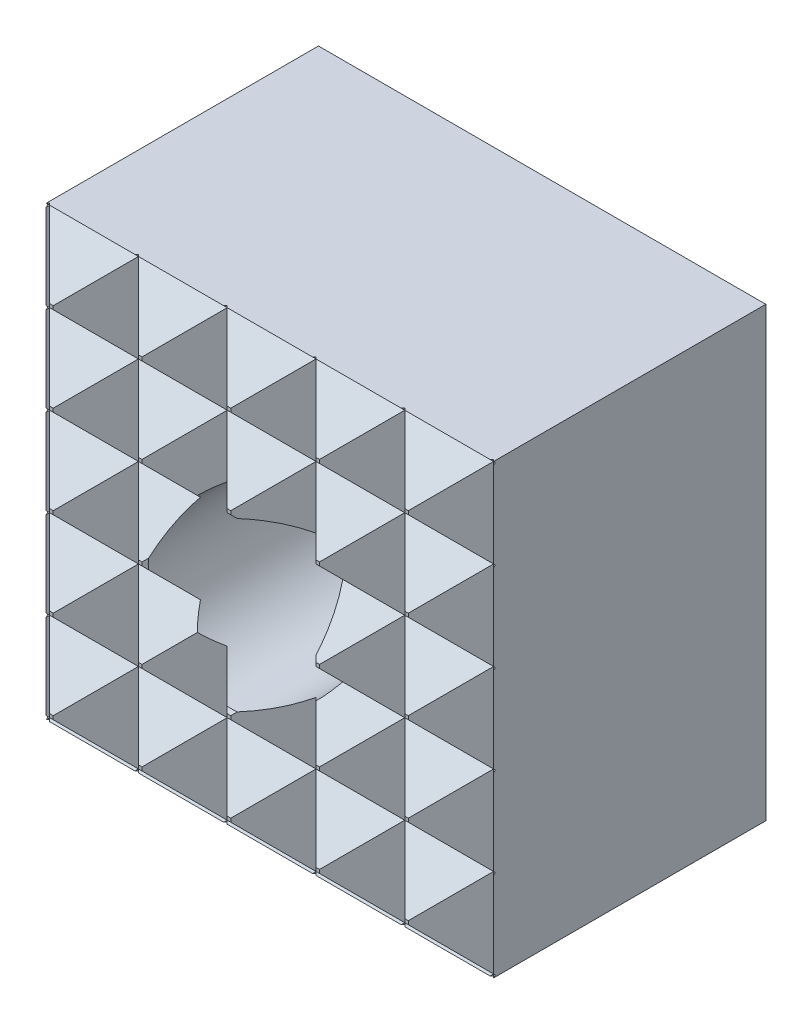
ISO-10303-21;
HEADER;
FILE_DESCRIPTION(('STEP AP214'),'2;1');
FILE_NAME('part.step','',(''),(''),'','','');
FILE_SCHEMA(('AUTOMOTIVE_DESIGN { 1 0 10303 214 1 1 1 1 }'));
ENDSEC;
DATA;
#1=APPLICATION_CONTEXT('core data for automotive mechanical design processes');
#2=APPLICATION_PROTOCOL_DEFINITION('international standard','automotive_design',2000,#1);
#3=PRODUCT_CONTEXT('',#1,'mechanical');
#4=PRODUCT('Part','Part','',(#3));
#5=PRODUCT_RELATED_PRODUCT_CATEGORY('part','',(#4));
#6=PRODUCT_DEFINITION_FORMATION('','',#4);
#7=PRODUCT_DEFINITION_CONTEXT('part definition',#1,'design');
#8=PRODUCT_DEFINITION('design','',#6,#7);
#9=PRODUCT_DEFINITION_SHAPE('','',#8);
#10=(LENGTH_UNIT() NAMED_UNIT(*) SI_UNIT(.MILLI.,.METRE.));
#11=(NAMED_UNIT(*) PLANE_ANGLE_UNIT() SI_UNIT($,.RADIAN.));
#12=(NAMED_UNIT(*) SI_UNIT($,.STERADIAN.) SOLID_ANGLE_UNIT());
#13=UNCERTAINTY_MEASURE_WITH_UNIT(LENGTH_MEASURE(1.E-05),#10,'distance_accuracy_value','');
#14=(GEOMETRIC_REPRESENTATION_CONTEXT(3) GLOBAL_UNCERTAINTY_ASSIGNED_CONTEXT((#13)) GLOBAL_UNIT_ASSIGNED_CONTEXT((#10,
#11,#12)) REPRESENTATION_CONTEXT('',''));
#15=CARTESIAN_POINT('',(0.,0.,0.));
#16=DIRECTION('',(0.,0.,1.));
#17=DIRECTION('',(1.,0.,0.));
#18=AXIS2_PLACEMENT_3D('',#15,#16,#17);
#19=CARTESIAN_POINT('',(-8.,8.,12.));
#20=DIRECTION('',(0.,0.,-1.));
#21=DIRECTION('',(-1.,0.,0.));
#22=AXIS2_PLACEMENT_3D('',#19,#20,#21);
#23=PLANE('',#22);
#24=DIRECTION('',(0.,1.,0.));
#25=VECTOR('',#24,1.);
#26=CARTESIAN_POINT('',(-3.23849999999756,8.,12.));
#27=LINE('',#26,#25);
#28=CARTESIAN_POINT('',(-3.23849999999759,-6.4134999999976,12.));
#29=VERTEX_POINT('',#28);
#30=CARTESIAN_POINT('',(-3.2384999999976,-6.2865000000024,12.));
#31=VERTEX_POINT('',#30);
#32=EDGE_CURVE('E1136',#29,#31,#27,.T.);
#33=ORIENTED_EDGE('',*,*,#32,.F.);
#34=DIRECTION('',(1.,0.,0.));
#35=VECTOR('',#34,1.);
#36=CARTESIAN_POINT('',(-25.4503805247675,-6.4134999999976,12.));
#37=LINE('',#36,#35);
#38=CARTESIAN_POINT('',(-3.11150000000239,-6.4134999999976,12.));
#39=VERTEX_POINT('',#38);
#40=EDGE_CURVE('E750',#29,#39,#37,.T.);
#41=ORIENTED_EDGE('',*,*,#40,.T.);
#42=DIRECTION('',(0.,-1.,0.));
#43=VECTOR('',#42,1.);
#44=CARTESIAN_POINT('',(-3.11150000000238,8.,12.));
#45=LINE('',#44,#43);
#46=CARTESIAN_POINT('',(-3.11150000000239,-6.2865000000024,12.));
#47=VERTEX_POINT('',#46);
#48=EDGE_CURVE('E1175',#47,#39,#45,.T.);
#49=ORIENTED_EDGE('',*,*,#48,.F.);
#50=DIRECTION('',(1.,0.,0.));
#51=VECTOR('',#50,1.);
#52=CARTESIAN_POINT('',(-25.4503805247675,-6.2865000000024,12.));
#53=LINE('',#52,#51);
#54=EDGE_CURVE('E746',#31,#47,#53,.T.);
#55=ORIENTED_EDGE('',*,*,#54,.F.);
#56=EDGE_LOOP('',(#33,#41,#49,#55));
#57=FACE_BOUND('',#56,.T.);
#58=ADVANCED_FACE('F15',(#57),#23,.F.);
#59=CARTESIAN_POINT('',(-3.23849999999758,-3.2384999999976,12.));
#60=VERTEX_POINT('',#59);
#61=CARTESIAN_POINT('',(-3.23849999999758,-3.11150000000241,12.));
#62=VERTEX_POINT('',#61);
#63=EDGE_CURVE('E3814',#60,#62,#27,.T.);
#64=ORIENTED_EDGE('',*,*,#63,.F.);
#65=DIRECTION('',(1.,0.,0.));
#66=VECTOR('',#65,1.);
#67=CARTESIAN_POINT('',(-25.4503805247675,-3.2384999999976,12.));
#68=LINE('',#67,#66);
#69=CARTESIAN_POINT('',(-3.11150000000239,-3.2384999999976,12.));
#70=VERTEX_POINT('',#69);
#71=EDGE_CURVE('E736',#60,#70,#68,.T.);
#72=ORIENTED_EDGE('',*,*,#71,.T.);
#73=CARTESIAN_POINT('',(-3.11150000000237,-3.1115000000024,12.));
#74=VERTEX_POINT('',#73);
#75=EDGE_CURVE('E1178',#74,#70,#45,.T.);
#76=ORIENTED_EDGE('',*,*,#75,.F.);
#77=DIRECTION('',(1.,0.,0.));
#78=VECTOR('',#77,1.);
#79=CARTESIAN_POINT('',(-25.4503805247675,-3.11150000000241,12.));
#80=LINE('',#79,#78);
#81=EDGE_CURVE('E726',#62,#74,#80,.T.);
#82=ORIENTED_EDGE('',*,*,#81,.F.);
#83=EDGE_LOOP('',(#64,#72,#76,#82));
#84=FACE_BOUND('',#83,.T.);
#85=ADVANCED_FACE('F1497',(#84),#23,.F.);
#86=CARTESIAN_POINT('',(-3.23849999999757,-0.0634999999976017,12.));
#87=VERTEX_POINT('',#86);
#88=CARTESIAN_POINT('',(-3.23849999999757,0.0634999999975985,12.));
#89=VERTEX_POINT('',#88);
#90=EDGE_CURVE('E3813',#87,#89,#27,.T.);
#91=ORIENTED_EDGE('',*,*,#90,.F.);
#92=DIRECTION('',(1.,0.,0.));
#93=VECTOR('',#92,1.);
#94=CARTESIAN_POINT('',(-25.4503805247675,-0.0634999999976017,12.));
#95=LINE('',#94,#93);
#96=CARTESIAN_POINT('',(-3.11150000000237,-0.0634999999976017,12.));
#97=VERTEX_POINT('',#96);
#98=EDGE_CURVE('E1949',#87,#97,#95,.T.);
#99=ORIENTED_EDGE('',*,*,#98,.T.);
#100=CARTESIAN_POINT('',(-3.11150000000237,0.0634999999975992,12.));
#101=VERTEX_POINT('',#100);
#102=EDGE_CURVE('E3824',#101,#97,#45,.T.);
#103=ORIENTED_EDGE('',*,*,#102,.F.);
#104=DIRECTION('',(1.,0.,0.));
#105=VECTOR('',#104,1.);
#106=CARTESIAN_POINT('',(-25.4503805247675,0.0634999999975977,12.));
#107=LINE('',#106,#105);
#108=EDGE_CURVE('E1947',#89,#101,#107,.T.);
#109=ORIENTED_EDGE('',*,*,#108,.F.);
#110=EDGE_LOOP('',(#91,#99,#103,#109));
#111=FACE_BOUND('',#110,.T.);
#112=ADVANCED_FACE('F1504',(#111),#23,.F.);
#113=CARTESIAN_POINT('',(-3.23849999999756,3.1115000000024,12.));
#114=VERTEX_POINT('',#113);
#115=CARTESIAN_POINT('',(-3.23849999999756,3.2384999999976,12.));
#116=VERTEX_POINT('',#115);
#117=EDGE_CURVE('E1135',#114,#116,#27,.T.);
#118=ORIENTED_EDGE('',*,*,#117,.F.);
#119=DIRECTION('',(1.,0.,0.));
#120=VECTOR('',#119,1.);
#121=CARTESIAN_POINT('',(-25.4503805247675,3.1115000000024,12.));
#122=LINE('',#121,#120);
#123=CARTESIAN_POINT('',(-3.11150000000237,3.1115000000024,12.));
#124=VERTEX_POINT('',#123);
#125=EDGE_CURVE('E1782',#114,#124,#122,.T.);
#126=ORIENTED_EDGE('',*,*,#125,.T.);
#127=CARTESIAN_POINT('',(-3.11150000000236,3.2384999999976,12.));
#128=VERTEX_POINT('',#127);
#129=EDGE_CURVE('E3822',#128,#124,#45,.T.);
#130=ORIENTED_EDGE('',*,*,#129,.F.);
#131=DIRECTION('',(1.,0.,0.));
#132=VECTOR('',#131,1.);
#133=CARTESIAN_POINT('',(-25.4503805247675,3.2384999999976,12.));
#134=LINE('',#133,#132);
#135=EDGE_CURVE('E1784',#116,#128,#134,.T.);
#136=ORIENTED_EDGE('',*,*,#135,.F.);
#137=EDGE_LOOP('',(#118,#126,#130,#136));
#138=FACE_BOUND('',#137,.T.);
#139=ADVANCED_FACE('F3795',(#138),#23,.F.);
#140=DIRECTION('',(0.,1.,0.));
#141=VECTOR('',#140,1.);
#142=CARTESIAN_POINT('',(-0.0634999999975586,8.,12.));
#143=LINE('',#142,#141);
#144=CARTESIAN_POINT('',(-0.0634999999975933,-6.4134999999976,12.));
#145=VERTEX_POINT('',#144);
#146=CARTESIAN_POINT('',(-0.063499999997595,-6.2865000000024,12.));
#147=VERTEX_POINT('',#146);
#148=EDGE_CURVE('E1174',#145,#147,#143,.T.);
#149=ORIENTED_EDGE('',*,*,#148,.F.);
#150=CARTESIAN_POINT('',(0.0634999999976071,-6.4134999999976,12.));
#151=VERTEX_POINT('',#150);
#152=EDGE_CURVE('E754',#145,#151,#37,.T.);
#153=ORIENTED_EDGE('',*,*,#152,.T.);
#154=DIRECTION('',(0.,-1.,0.));
#155=VECTOR('',#154,1.);
#156=CARTESIAN_POINT('',(0.0634999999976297,8.,12.));
#157=LINE('',#156,#155);
#158=CARTESIAN_POINT('',(0.0634999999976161,-6.2865000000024,12.));
#159=VERTEX_POINT('',#158);
#160=EDGE_CURVE('E1196',#159,#151,#157,.T.);
#161=ORIENTED_EDGE('',*,*,#160,.F.);
#162=EDGE_CURVE('E749',#147,#159,#53,.T.);
#163=ORIENTED_EDGE('',*,*,#162,.F.);
#164=EDGE_LOOP('',(#149,#153,#161,#163));
#165=FACE_BOUND('',#164,.T.);
#166=ADVANCED_FACE('F2507',(#165),#23,.F.);
#167=CARTESIAN_POINT('',(-0.0634999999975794,-3.2384999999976,12.));
#168=VERTEX_POINT('',#167);
#169=CARTESIAN_POINT('',(-0.0634999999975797,-3.11150000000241,12.));
#170=VERTEX_POINT('',#169);
#171=EDGE_CURVE('E3860',#168,#170,#143,.T.);
#172=ORIENTED_EDGE('',*,*,#171,.F.);
#173=CARTESIAN_POINT('',(0.0634999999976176,-3.2384999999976,12.));
#174=VERTEX_POINT('',#173);
#175=EDGE_CURVE('E740',#168,#174,#68,.T.);
#176=ORIENTED_EDGE('',*,*,#175,.T.);
#177=CARTESIAN_POINT('',(0.0634999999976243,-3.1115000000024,12.));
#178=VERTEX_POINT('',#177);
#179=EDGE_CURVE('E1199',#178,#174,#157,.T.);
#180=ORIENTED_EDGE('',*,*,#179,.F.);
#181=EDGE_CURVE('E730',#170,#178,#80,.T.);
#182=ORIENTED_EDGE('',*,*,#181,.F.);
#183=EDGE_LOOP('',(#172,#176,#180,#182));
#184=FACE_BOUND('',#183,.T.);
#185=ADVANCED_FACE('F3779',(#184),#23,.F.);
#186=CARTESIAN_POINT('',(-0.0634999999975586,3.1115000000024,12.));
#187=VERTEX_POINT('',#186);
#188=CARTESIAN_POINT('',(-0.0634999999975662,3.2384999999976,12.));
#189=VERTEX_POINT('',#188);
#190=EDGE_CURVE('E1173',#187,#189,#143,.T.);
#191=ORIENTED_EDGE('',*,*,#190,.F.);
#192=CARTESIAN_POINT('',(0.0634999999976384,3.1115000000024,12.));
#193=VERTEX_POINT('',#192);
#194=EDGE_CURVE('E1786',#187,#193,#122,.T.);
#195=ORIENTED_EDGE('',*,*,#194,.T.);
#196=CARTESIAN_POINT('',(0.0634999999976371,3.2384999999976,12.));
#197=VERTEX_POINT('',#196);
#198=EDGE_CURVE('E1937',#197,#193,#157,.T.);
#199=ORIENTED_EDGE('',*,*,#198,.F.);
#200=EDGE_CURVE('E1781',#189,#197,#134,.T.);
#201=ORIENTED_EDGE('',*,*,#200,.F.);
#202=EDGE_LOOP('',(#191,#195,#199,#201));
#203=FACE_BOUND('',#202,.T.);
#204=ADVANCED_FACE('F1941',(#203),#23,.F.);
#205=DIRECTION('',(0.,1.,0.));
#206=VECTOR('',#205,1.);
#207=CARTESIAN_POINT('',(3.11150000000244,8.,12.));
#208=LINE('',#207,#206);
#209=CARTESIAN_POINT('',(3.11150000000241,-6.4134999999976,12.));
#210=VERTEX_POINT('',#209);
#211=CARTESIAN_POINT('',(3.11150000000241,-6.2865000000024,12.));
#212=VERTEX_POINT('',#211);
#213=EDGE_CURVE('E1195',#210,#212,#208,.T.);
#214=ORIENTED_EDGE('',*,*,#213,.F.);
#215=CARTESIAN_POINT('',(3.23849999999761,-6.4134999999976,12.));
#216=VERTEX_POINT('',#215);
#217=EDGE_CURVE('E751',#210,#216,#37,.T.);
#218=ORIENTED_EDGE('',*,*,#217,.T.);
#219=DIRECTION('',(0.,-1.,0.));
#220=VECTOR('',#219,1.);
#221=CARTESIAN_POINT('',(3.23849999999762,8.,12.));
#222=LINE('',#221,#220);
#223=CARTESIAN_POINT('',(3.23849999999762,-6.2865000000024,12.));
#224=VERTEX_POINT('',#223);
#225=EDGE_CURVE('E1212',#224,#216,#222,.T.);
#226=ORIENTED_EDGE('',*,*,#225,.F.);
#227=EDGE_CURVE('E747',#212,#224,#53,.T.);
#228=ORIENTED_EDGE('',*,*,#227,.F.);
#229=EDGE_LOOP('',(#214,#218,#226,#228));
#230=FACE_BOUND('',#229,.T.);
#231=ADVANCED_FACE('F2469',(#230),#23,.F.);
#232=CARTESIAN_POINT('',(3.11150000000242,-3.2384999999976,12.));
#233=VERTEX_POINT('',#232);
#234=CARTESIAN_POINT('',(3.11150000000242,-3.11150000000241,12.));
#235=VERTEX_POINT('',#234);
#236=EDGE_CURVE('E1759',#233,#235,#208,.T.);
#237=ORIENTED_EDGE('',*,*,#236,.F.);
#238=CARTESIAN_POINT('',(3.23849999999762,-3.2384999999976,12.));
#239=VERTEX_POINT('',#238);
#240=EDGE_CURVE('E737',#233,#239,#68,.T.);
#241=ORIENTED_EDGE('',*,*,#240,.T.);
#242=CARTESIAN_POINT('',(3.23849999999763,-3.1115000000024,12.));
#243=VERTEX_POINT('',#242);
#244=EDGE_CURVE('E1216',#243,#239,#222,.T.);
#245=ORIENTED_EDGE('',*,*,#244,.F.);
#246=EDGE_CURVE('E732',#235,#243,#80,.T.);
#247=ORIENTED_EDGE('',*,*,#246,.F.);
#248=EDGE_LOOP('',(#237,#241,#245,#247));
#249=FACE_BOUND('',#248,.T.);
#250=ADVANCED_FACE('F1889',(#249),#23,.F.);
#251=CARTESIAN_POINT('',(3.11150000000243,-0.0634999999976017,12.));
#252=VERTEX_POINT('',#251);
#253=CARTESIAN_POINT('',(3.11150000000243,0.063499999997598,12.));
#254=VERTEX_POINT('',#253);
#255=EDGE_CURVE('E1756',#252,#254,#208,.T.);
#256=ORIENTED_EDGE('',*,*,#255,.F.);
#257=CARTESIAN_POINT('',(3.23849999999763,-0.0634999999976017,12.));
#258=VERTEX_POINT('',#257);
#259=EDGE_CURVE('E729',#252,#258,#95,.T.);
#260=ORIENTED_EDGE('',*,*,#259,.T.);
#261=CARTESIAN_POINT('',(3.23849999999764,0.0634999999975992,12.));
#262=VERTEX_POINT('',#261);
#263=EDGE_CURVE('E1893',#262,#258,#222,.T.);
#264=ORIENTED_EDGE('',*,*,#263,.F.);
#265=EDGE_CURVE('E1948',#254,#262,#107,.T.);
#266=ORIENTED_EDGE('',*,*,#265,.F.);
#267=EDGE_LOOP('',(#256,#260,#264,#266));
#268=FACE_BOUND('',#267,.T.);
#269=ADVANCED_FACE('F1955',(#268),#23,.F.);
#270=CARTESIAN_POINT('',(3.11150000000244,3.1115000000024,12.));
#271=VERTEX_POINT('',#270);
#272=CARTESIAN_POINT('',(3.11150000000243,3.2384999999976,12.));
#273=VERTEX_POINT('',#272);
#274=EDGE_CURVE('E1194',#271,#273,#208,.T.);
#275=ORIENTED_EDGE('',*,*,#274,.F.);
#276=CARTESIAN_POINT('',(3.23849999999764,3.1115000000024,12.));
#277=VERTEX_POINT('',#276);
#278=EDGE_CURVE('E1775',#271,#277,#122,.T.);
#279=ORIENTED_EDGE('',*,*,#278,.T.);
#280=CARTESIAN_POINT('',(3.23849999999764,3.2384999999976,12.));
#281=VERTEX_POINT('',#280);
#282=EDGE_CURVE('E1778',#281,#277,#222,.T.);
#283=ORIENTED_EDGE('',*,*,#282,.F.);
#284=EDGE_CURVE('E1777',#273,#281,#134,.T.);
#285=ORIENTED_EDGE('',*,*,#284,.F.);
#286=EDGE_LOOP('',(#275,#279,#283,#285));
#287=FACE_BOUND('',#286,.T.);
#288=ADVANCED_FACE('F1773',(#287),#23,.F.);
#289=CARTESIAN_POINT('',(3.175,-8.00000000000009,12.0634999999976));
#290=DIRECTION('',(0.707106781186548,0.,0.707106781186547));
#291=DIRECTION('',(0.707106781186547,0.,-0.707106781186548));
#292=AXIS2_PLACEMENT_3D('',#289,#290,#291);
#293=PLANE('',#292);
#294=DIRECTION('',(0.577350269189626,0.577350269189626,-0.577350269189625));
#295=VECTOR('',#294,1.);
#296=CARTESIAN_POINT('',(2.625,-6.9,12.6134999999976));
#297=LINE('',#296,#295);
#298=CARTESIAN_POINT('',(4.7625,-4.7625,10.4759999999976));
#299=VERTEX_POINT('',#298);
#300=EDGE_CURVE('E888',#224,#299,#297,.T.);
#301=ORIENTED_EDGE('',*,*,#300,.F.);
#302=ORIENTED_EDGE('',*,*,#225,.T.);
#303=DIRECTION('',(-0.577350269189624,0.577350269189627,0.577350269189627));
#304=VECTOR('',#303,1.);
#305=CARTESIAN_POINT('',(3.725,-6.9,11.5134999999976));
#306=LINE('',#305,#304);
#307=CARTESIAN_POINT('',(4.7625,-7.9375,10.4759999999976));
#308=VERTEX_POINT('',#307);
#309=EDGE_CURVE('E900',#308,#216,#306,.T.);
#310=ORIENTED_EDGE('',*,*,#309,.F.);
#311=DIRECTION('',(0.,1.,0.));
#312=VECTOR('',#311,1.);
#313=CARTESIAN_POINT('',(4.7625,-8.0000000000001,10.4759999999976));
#314=LINE('',#313,#312);
#315=EDGE_CURVE('E1205',#308,#299,#314,.T.);
#316=ORIENTED_EDGE('',*,*,#315,.T.);
#317=EDGE_LOOP('',(#301,#302,#310,#316));
#318=FACE_BOUND('',#317,.T.);
#319=ADVANCED_FACE('F1662',(#318),#293,.T.);
#320=DIRECTION('',(-0.577350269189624,0.577350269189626,0.577350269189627));
#321=VECTOR('',#320,1.);
#322=CARTESIAN_POINT('',(4.78333333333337,-4.78333333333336,10.4551666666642));
#323=LINE('',#322,#321);
#324=EDGE_CURVE('E819',#299,#239,#323,.T.);
#325=ORIENTED_EDGE('',*,*,#324,.F.);
#326=DIRECTION('',(0.,-1.,0.));
#327=VECTOR('',#326,1.);
#328=CARTESIAN_POINT('',(4.7625,25.5601008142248,10.4759999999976));
#329=LINE('',#328,#327);
#330=CARTESIAN_POINT('',(4.7625,-1.5875,10.4759999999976));
#331=VERTEX_POINT('',#330);
#332=EDGE_CURVE('E927',#331,#299,#329,.T.);
#333=ORIENTED_EDGE('',*,*,#332,.F.);
#334=DIRECTION('',(0.577350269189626,0.577350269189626,-0.577350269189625));
#335=VECTOR('',#334,1.);
#336=CARTESIAN_POINT('',(1.56666666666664,-4.78333333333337,13.671833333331));
#337=LINE('',#336,#335);
#338=EDGE_CURVE('E723',#243,#331,#337,.T.);
#339=ORIENTED_EDGE('',*,*,#338,.F.);
#340=ORIENTED_EDGE('',*,*,#244,.T.);
#341=EDGE_LOOP('',(#325,#333,#339,#340));
#342=FACE_BOUND('',#341,.T.);
#343=ADVANCED_FACE('F1972',(#342),#293,.T.);
#344=DIRECTION('',(-0.577350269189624,0.577350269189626,0.577350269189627));
#345=VECTOR('',#344,1.);
#346=CARTESIAN_POINT('',(5.84166666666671,-2.66666666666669,9.3968333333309));
#347=LINE('',#346,#345);
#348=EDGE_CURVE('E799',#331,#258,#347,.T.);
#349=ORIENTED_EDGE('',*,*,#348,.F.);
#350=CARTESIAN_POINT('',(4.7625,1.5875,10.4759999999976));
#351=VERTEX_POINT('',#350);
#352=EDGE_CURVE('E930',#351,#331,#329,.T.);
#353=ORIENTED_EDGE('',*,*,#352,.F.);
#354=DIRECTION('',(0.577350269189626,0.577350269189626,-0.577350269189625));
#355=VECTOR('',#354,1.);
#356=CARTESIAN_POINT('',(0.50833333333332,-2.66666666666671,14.7301666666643));
#357=LINE('',#356,#355);
#358=EDGE_CURVE('E789',#262,#351,#357,.T.);
#359=ORIENTED_EDGE('',*,*,#358,.F.);
#360=ORIENTED_EDGE('',*,*,#263,.T.);
#361=EDGE_LOOP('',(#349,#353,#359,#360));
#362=FACE_BOUND('',#361,.T.);
#363=ADVANCED_FACE('F1958',(#362),#293,.T.);
#364=DIRECTION('',(-0.577350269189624,0.577350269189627,0.577350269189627));
#365=VECTOR('',#364,1.);
#366=CARTESIAN_POINT('',(6.9,-0.550000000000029,8.33849999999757));
#367=LINE('',#366,#365);
#368=EDGE_CURVE('E775',#351,#277,#367,.T.);
#369=ORIENTED_EDGE('',*,*,#368,.F.);
#370=CARTESIAN_POINT('',(4.7625,4.7625,10.4759999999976));
#371=VERTEX_POINT('',#370);
#372=EDGE_CURVE('E926',#371,#351,#329,.T.);
#373=ORIENTED_EDGE('',*,*,#372,.F.);
#374=DIRECTION('',(0.577350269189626,0.577350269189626,-0.577350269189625));
#375=VECTOR('',#374,1.);
#376=CARTESIAN_POINT('',(-0.550000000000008,-0.550000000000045,15.7884999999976));
#377=LINE('',#376,#375);
#378=EDGE_CURVE('E761',#281,#371,#377,.T.);
#379=ORIENTED_EDGE('',*,*,#378,.F.);
#380=ORIENTED_EDGE('',*,*,#282,.T.);
#381=EDGE_LOOP('',(#369,#373,#379,#380));
#382=FACE_BOUND('',#381,.T.);
#383=ADVANCED_FACE('F2321',(#382),#293,.T.);
#384=DIRECTION('',(-0.577350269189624,0.577350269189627,0.577350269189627));
#385=VECTOR('',#384,1.);
#386=CARTESIAN_POINT('',(7.95833333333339,1.56666666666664,7.28016666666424));
#387=LINE('',#386,#385);
#388=CARTESIAN_POINT('',(3.23849999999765,6.2865000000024,12.));
#389=VERTEX_POINT('',#388);
#390=EDGE_CURVE('E877',#371,#389,#387,.T.);
#391=ORIENTED_EDGE('',*,*,#390,.F.);
#392=CARTESIAN_POINT('',(4.7625,7.9375,10.4759999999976));
#393=VERTEX_POINT('',#392);
#394=EDGE_CURVE('E1664',#371,#393,#314,.T.);
#395=ORIENTED_EDGE('',*,*,#394,.T.);
#396=DIRECTION('',(0.577350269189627,0.577350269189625,-0.577350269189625));
#397=VECTOR('',#396,1.);
#398=CARTESIAN_POINT('',(-1.60833333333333,1.56666666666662,16.846833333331));
#399=LINE('',#398,#397);
#400=CARTESIAN_POINT('',(3.23849999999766,6.4134999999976,12.));
#401=VERTEX_POINT('',#400);
#402=EDGE_CURVE('E865',#401,#393,#399,.T.);
#403=ORIENTED_EDGE('',*,*,#402,.F.);
#404=EDGE_CURVE('E1217',#401,#389,#222,.T.);
#405=ORIENTED_EDGE('',*,*,#404,.T.);
#406=EDGE_LOOP('',(#391,#395,#403,#405));
#407=FACE_BOUND('',#406,.T.);
#408=ADVANCED_FACE('F1900',(#407),#293,.T.);
#409=DIRECTION('',(-0.577350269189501,0.577350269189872,0.577350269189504));
#410=VECTOR('',#409,1.);
#411=CARTESIAN_POINT('',(9.01666666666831,3.68333333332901,6.22183333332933));
#412=LINE('',#411,#410);
#413=CARTESIAN_POINT('',(4.70000000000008,8.,10.5384999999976));
#414=VERTEX_POINT('',#413);
#415=EDGE_CURVE('E854',#393,#414,#412,.T.);
#416=ORIENTED_EDGE('',*,*,#415,.F.);
#417=CARTESIAN_POINT('',(4.7625,8.,10.4759999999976));
#418=VERTEX_POINT('',#417);
#419=EDGE_CURVE('E1206',#393,#418,#314,.T.);
#420=ORIENTED_EDGE('',*,*,#419,.T.);
#421=DIRECTION('',(-0.707106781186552,0.,0.707106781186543));
#422=VECTOR('',#421,1.);
#423=CARTESIAN_POINT('',(3.23849999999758,8.,12.));
#424=LINE('',#423,#422);
#425=EDGE_CURVE('E1062',#418,#414,#424,.T.);
#426=ORIENTED_EDGE('',*,*,#425,.T.);
#427=EDGE_LOOP('',(#416,#420,#426));
#428=FACE_BOUND('',#427,.T.);
#429=ADVANCED_FACE('F1675',(#428),#293,.T.);
#430=CARTESIAN_POINT('',(1.5875,-8.00000000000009,10.4759999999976));
#431=DIRECTION('',(-0.707106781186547,0.,0.707106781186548));
#432=DIRECTION('',(0.707106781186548,0.,0.707106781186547));
#433=AXIS2_PLACEMENT_3D('',#430,#431,#432);
#434=PLANE('',#433);
#435=DIRECTION('',(0.577350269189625,-0.577350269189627,0.577350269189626));
#436=VECTOR('',#435,1.);
#437=CARTESIAN_POINT('',(2.6666666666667,-5.8416666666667,11.5551666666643));
#438=LINE('',#437,#436);
#439=CARTESIAN_POINT('',(1.5875,-4.7625,10.4759999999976));
#440=VERTEX_POINT('',#439);
#441=EDGE_CURVE('E884',#440,#212,#438,.T.);
#442=ORIENTED_EDGE('',*,*,#441,.F.);
#443=DIRECTION('',(0.,1.,0.));
#444=VECTOR('',#443,1.);
#445=CARTESIAN_POINT('',(1.5875,-8.00000000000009,10.4759999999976));
#446=LINE('',#445,#444);
#447=CARTESIAN_POINT('',(1.5875,-7.9375,10.4759999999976));
#448=VERTEX_POINT('',#447);
#449=EDGE_CURVE('E1190',#448,#440,#446,.T.);
#450=ORIENTED_EDGE('',*,*,#449,.F.);
#451=DIRECTION('',(-0.577350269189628,-0.577350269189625,-0.577350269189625));
#452=VECTOR('',#451,1.);
#453=CARTESIAN_POINT('',(1.56666666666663,-7.95833333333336,10.4551666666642));
#454=LINE('',#453,#452);
#455=EDGE_CURVE('E895',#210,#448,#454,.T.);
#456=ORIENTED_EDGE('',*,*,#455,.F.);
#457=ORIENTED_EDGE('',*,*,#213,.T.);
#458=EDGE_LOOP('',(#442,#450,#456,#457));
#459=FACE_BOUND('',#458,.T.);
#460=ADVANCED_FACE('F1871',(#459),#434,.T.);
#461=CARTESIAN_POINT('',(0.,0.,8.88849999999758));
#462=DIRECTION('',(-0.707106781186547,0.,0.707106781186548));
#463=DIRECTION('',(-0.707106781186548,0.,-0.707106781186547));
#464=AXIS2_PLACEMENT_3D('',#461,#462,#463);
#465=ELLIPSE('',#464,4.24264068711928,3.);
#466=CARTESIAN_POINT('',(1.5875,-2.54555372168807,10.4759999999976));
#467=VERTEX_POINT('',#466);
#468=CARTESIAN_POINT('',(2.12132034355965,-2.12132034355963,11.0098203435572));
#469=VERTEX_POINT('',#468);
#470=EDGE_CURVE('E30',#467,#469,#465,.T.);
#471=ORIENTED_EDGE('',*,*,#470,.F.);
#472=EDGE_CURVE('E1844',#440,#467,#446,.T.);
#473=ORIENTED_EDGE('',*,*,#472,.F.);
#474=DIRECTION('',(-0.577350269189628,-0.577350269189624,-0.577350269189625));
#475=VECTOR('',#474,1.);
#476=CARTESIAN_POINT('',(0.508333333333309,-5.84166666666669,9.3968333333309));
#477=LINE('',#476,#475);
#478=EDGE_CURVE('E830',#233,#440,#477,.T.);
#479=ORIENTED_EDGE('',*,*,#478,.F.);
#480=ORIENTED_EDGE('',*,*,#236,.T.);
#481=DIRECTION('',(0.577350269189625,-0.577350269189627,0.577350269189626));
#482=VECTOR('',#481,1.);
#483=CARTESIAN_POINT('',(3.72500000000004,-3.725,12.6134999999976));
#484=LINE('',#483,#482);
#485=EDGE_CURVE('E817',#469,#235,#484,.T.);
#486=ORIENTED_EDGE('',*,*,#485,.F.);
#487=EDGE_LOOP('',(#471,#473,#479,#480,#486));
#488=FACE_BOUND('',#487,.T.);
#489=ADVANCED_FACE('F1884',(#488),#434,.T.);
#490=CARTESIAN_POINT('',(0.,0.,8.88849999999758));
#491=DIRECTION('',(-0.707106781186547,0.,0.707106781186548));
#492=DIRECTION('',(-0.707106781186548,0.,-0.707106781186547));
#493=AXIS2_PLACEMENT_3D('',#490,#491,#492);
#494=ELLIPSE('',#493,4.24264068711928,3.);
#495=CARTESIAN_POINT('',(2.99456920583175,-0.180430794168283,11.8830692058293));
#496=VERTEX_POINT('',#495);
#497=CARTESIAN_POINT('',(2.99456920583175,0.180430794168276,11.8830692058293));
#498=VERTEX_POINT('',#497);
#499=EDGE_CURVE('E719',#496,#498,#494,.T.);
#500=ORIENTED_EDGE('',*,*,#499,.F.);
#501=DIRECTION('',(-0.577350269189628,-0.577350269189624,-0.577350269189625));
#502=VECTOR('',#501,1.);
#503=CARTESIAN_POINT('',(-0.550000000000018,-3.725,8.33849999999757));
#504=LINE('',#503,#502);
#505=EDGE_CURVE('E718',#252,#496,#504,.T.);
#506=ORIENTED_EDGE('',*,*,#505,.F.);
#507=ORIENTED_EDGE('',*,*,#255,.T.);
#508=DIRECTION('',(0.577350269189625,-0.577350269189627,0.577350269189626));
#509=VECTOR('',#508,1.);
#510=CARTESIAN_POINT('',(4.78333333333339,-1.60833333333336,13.671833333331));
#511=LINE('',#510,#509);
#512=EDGE_CURVE('E797',#498,#254,#511,.T.);
#513=ORIENTED_EDGE('',*,*,#512,.F.);
#514=EDGE_LOOP('',(#500,#506,#507,#513));
#515=FACE_BOUND('',#514,.T.);
#516=ADVANCED_FACE('F1754',(#515),#434,.T.);
#517=CARTESIAN_POINT('',(0.,0.,8.88849999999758));
#518=DIRECTION('',(-0.707106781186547,0.,0.707106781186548));
#519=DIRECTION('',(-0.707106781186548,0.,-0.707106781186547));
#520=AXIS2_PLACEMENT_3D('',#517,#518,#519);
#521=ELLIPSE('',#520,4.24264068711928,3.);
#522=CARTESIAN_POINT('',(2.12132034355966,2.12132034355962,11.0098203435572));
#523=VERTEX_POINT('',#522);
#524=CARTESIAN_POINT('',(1.58750000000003,2.54555372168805,10.4759999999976));
#525=VERTEX_POINT('',#524);
#526=EDGE_CURVE('E1735',#523,#525,#521,.T.);
#527=ORIENTED_EDGE('',*,*,#526,.F.);
#528=DIRECTION('',(-0.577350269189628,-0.577350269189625,-0.577350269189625));
#529=VECTOR('',#528,1.);
#530=CARTESIAN_POINT('',(-1.60833333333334,-1.60833333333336,7.28016666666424));
#531=LINE('',#530,#529);
#532=EDGE_CURVE('E786',#271,#523,#531,.T.);
#533=ORIENTED_EDGE('',*,*,#532,.F.);
#534=ORIENTED_EDGE('',*,*,#274,.T.);
#535=DIRECTION('',(0.577350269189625,-0.577350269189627,0.577350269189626));
#536=VECTOR('',#535,1.);
#537=CARTESIAN_POINT('',(5.84166666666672,0.508333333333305,14.7301666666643));
#538=LINE('',#537,#536);
#539=CARTESIAN_POINT('',(1.58750000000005,4.7625,10.4759999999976));
#540=VERTEX_POINT('',#539);
#541=EDGE_CURVE('E773',#540,#273,#538,.T.);
#542=ORIENTED_EDGE('',*,*,#541,.F.);
#543=EDGE_CURVE('E1191',#525,#540,#446,.T.);
#544=ORIENTED_EDGE('',*,*,#543,.F.);
#545=EDGE_LOOP('',(#527,#533,#534,#542,#544));
#546=FACE_BOUND('',#545,.T.);
#547=ADVANCED_FACE('F1767',(#546),#434,.T.);
#548=DIRECTION('',(-0.577350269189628,-0.577350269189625,-0.577350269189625));
#549=VECTOR('',#548,1.);
#550=CARTESIAN_POINT('',(-2.66666666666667,0.508333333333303,6.2218333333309));
#551=LINE('',#550,#549);
#552=CARTESIAN_POINT('',(3.11150000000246,6.2865000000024,12.));
#553=VERTEX_POINT('',#552);
#554=EDGE_CURVE('E872',#553,#540,#551,.T.);
#555=ORIENTED_EDGE('',*,*,#554,.F.);
#556=CARTESIAN_POINT('',(3.11150000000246,6.4134999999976,12.));
#557=VERTEX_POINT('',#556);
#558=EDGE_CURVE('E1189',#553,#557,#208,.T.);
#559=ORIENTED_EDGE('',*,*,#558,.T.);
#560=DIRECTION('',(0.577350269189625,-0.577350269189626,0.577350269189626));
#561=VECTOR('',#560,1.);
#562=CARTESIAN_POINT('',(6.9,2.625,15.7884999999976));
#563=LINE('',#562,#561);
#564=CARTESIAN_POINT('',(1.58750000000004,7.9375,10.4759999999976));
#565=VERTEX_POINT('',#564);
#566=EDGE_CURVE('E861',#565,#557,#563,.T.);
#567=ORIENTED_EDGE('',*,*,#566,.F.);
#568=EDGE_CURVE('E1837',#540,#565,#446,.T.);
#569=ORIENTED_EDGE('',*,*,#568,.F.);
#570=EDGE_LOOP('',(#555,#559,#567,#569));
#571=FACE_BOUND('',#570,.T.);
#572=ADVANCED_FACE('F1845',(#571),#434,.T.);
#573=DIRECTION('',(-0.577350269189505,-0.577350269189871,-0.577350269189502));
#574=VECTOR('',#573,1.);
#575=CARTESIAN_POINT('',(-3.72500000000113,2.62499999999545,5.16349999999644));
#576=LINE('',#575,#574);
#577=CARTESIAN_POINT('',(1.65,8.,10.5384999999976));
#578=VERTEX_POINT('',#577);
#579=EDGE_CURVE('E849',#578,#565,#576,.T.);
#580=ORIENTED_EDGE('',*,*,#579,.F.);
#581=DIRECTION('',(-0.707106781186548,0.,-0.707106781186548));
#582=VECTOR('',#581,1.);
#583=CARTESIAN_POINT('',(1.5875,8.,10.4759999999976));
#584=LINE('',#583,#582);
#585=CARTESIAN_POINT('',(1.5875,8.,10.4759999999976));
#586=VERTEX_POINT('',#585);
#587=EDGE_CURVE('E1060',#578,#586,#584,.T.);
#588=ORIENTED_EDGE('',*,*,#587,.T.);
#589=EDGE_CURVE('E1185',#565,#586,#446,.T.);
#590=ORIENTED_EDGE('',*,*,#589,.F.);
#591=EDGE_LOOP('',(#580,#588,#590));
#592=FACE_BOUND('',#591,.T.);
#593=ADVANCED_FACE('F1851',(#592),#434,.T.);
#594=CARTESIAN_POINT('',(-1.5875,-8.,10.4759999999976));
#595=DIRECTION('',(-0.707106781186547,0.,0.707106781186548));
#596=DIRECTION('',(0.707106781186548,0.,0.707106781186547));
#597=AXIS2_PLACEMENT_3D('',#594,#595,#596);
#598=PLANE('',#597);
#599=DIRECTION('',(0.577350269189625,-0.577350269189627,0.577350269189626));
#600=VECTOR('',#599,1.);
#601=CARTESIAN_POINT('',(-0.508333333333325,-5.84166666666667,11.5551666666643));
#602=LINE('',#601,#600);
#603=CARTESIAN_POINT('',(-1.5875,-4.7625,10.4759999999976));
#604=VERTEX_POINT('',#603);
#605=EDGE_CURVE('E879',#604,#147,#602,.T.);
#606=ORIENTED_EDGE('',*,*,#605,.F.);
#607=DIRECTION('',(0.,1.,0.));
#608=VECTOR('',#607,1.);
#609=CARTESIAN_POINT('',(-1.5875,-8.,10.4759999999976));
#610=LINE('',#609,#608);
#611=CARTESIAN_POINT('',(-1.5875,-7.9375,10.4759999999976));
#612=VERTEX_POINT('',#611);
#613=EDGE_CURVE('E1169',#612,#604,#610,.T.);
#614=ORIENTED_EDGE('',*,*,#613,.F.);
#615=DIRECTION('',(-0.577350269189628,-0.577350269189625,-0.577350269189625));
#616=VECTOR('',#615,1.);
#617=CARTESIAN_POINT('',(-1.60833333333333,-7.95833333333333,10.4551666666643));
#618=LINE('',#617,#616);
#619=EDGE_CURVE('E890',#145,#612,#618,.T.);
#620=ORIENTED_EDGE('',*,*,#619,.F.);
#621=ORIENTED_EDGE('',*,*,#148,.T.);
#622=EDGE_LOOP('',(#606,#614,#620,#621));
#623=FACE_BOUND('',#622,.T.);
#624=ADVANCED_FACE('F2355',(#623),#598,.T.);
#625=CARTESIAN_POINT('',(0.,0.,12.0634999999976));
#626=DIRECTION('',(-0.707106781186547,0.,0.707106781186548));
#627=DIRECTION('',(-0.707106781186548,0.,-0.707106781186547));
#628=AXIS2_PLACEMENT_3D('',#625,#626,#627);
#629=ELLIPSE('',#628,4.24264068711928,3.);
#630=CARTESIAN_POINT('',(-1.5875,-2.54555372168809,10.4759999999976));
#631=VERTEX_POINT('',#630);
#632=CARTESIAN_POINT('',(-0.180430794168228,-2.99456920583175,11.8830692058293));
#633=VERTEX_POINT('',#632);
#634=EDGE_CURVE('E1728',#631,#633,#629,.T.);
#635=ORIENTED_EDGE('',*,*,#634,.F.);
#636=EDGE_CURVE('E2491',#604,#631,#610,.T.);
#637=ORIENTED_EDGE('',*,*,#636,.F.);
#638=DIRECTION('',(-0.577350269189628,-0.577350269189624,-0.577350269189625));
#639=VECTOR('',#638,1.);
#640=CARTESIAN_POINT('',(-2.66666666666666,-5.84166666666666,9.39683333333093));
#641=LINE('',#640,#639);
#642=EDGE_CURVE('E825',#168,#604,#641,.T.);
#643=ORIENTED_EDGE('',*,*,#642,.F.);
#644=ORIENTED_EDGE('',*,*,#171,.T.);
#645=DIRECTION('',(0.577350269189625,-0.577350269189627,0.577350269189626));
#646=VECTOR('',#645,1.);
#647=CARTESIAN_POINT('',(0.550000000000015,-3.725,12.6134999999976));
#648=LINE('',#647,#646);
#649=EDGE_CURVE('E812',#633,#170,#648,.T.);
#650=ORIENTED_EDGE('',*,*,#649,.F.);
#651=EDGE_LOOP('',(#635,#637,#643,#644,#650));
#652=FACE_BOUND('',#651,.T.);
#653=ADVANCED_FACE('F2496',(#652),#598,.T.);
#654=CARTESIAN_POINT('',(0.,0.,12.0634999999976));
#655=DIRECTION('',(-0.707106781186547,0.,0.707106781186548));
#656=DIRECTION('',(-0.707106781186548,0.,-0.707106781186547));
#657=AXIS2_PLACEMENT_3D('',#654,#655,#656);
#658=ELLIPSE('',#657,4.24264068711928,3.);
#659=CARTESIAN_POINT('',(-0.180430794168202,2.99456920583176,11.8830692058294));
#660=VERTEX_POINT('',#659);
#661=CARTESIAN_POINT('',(-1.58749999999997,2.5455537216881,10.4759999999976));
#662=VERTEX_POINT('',#661);
#663=EDGE_CURVE('E1721',#660,#662,#658,.T.);
#664=ORIENTED_EDGE('',*,*,#663,.F.);
#665=DIRECTION('',(-0.577350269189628,-0.577350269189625,-0.577350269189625));
#666=VECTOR('',#665,1.);
#667=CARTESIAN_POINT('',(-4.78333333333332,-1.60833333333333,7.28016666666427));
#668=LINE('',#667,#666);
#669=EDGE_CURVE('E781',#187,#660,#668,.T.);
#670=ORIENTED_EDGE('',*,*,#669,.F.);
#671=ORIENTED_EDGE('',*,*,#190,.T.);
#672=DIRECTION('',(0.577350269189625,-0.577350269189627,0.577350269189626));
#673=VECTOR('',#672,1.);
#674=CARTESIAN_POINT('',(2.66666666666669,0.508333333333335,14.7301666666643));
#675=LINE('',#674,#673);
#676=CARTESIAN_POINT('',(-1.58749999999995,4.7625,10.4759999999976));
#677=VERTEX_POINT('',#676);
#678=EDGE_CURVE('E768',#677,#189,#675,.T.);
#679=ORIENTED_EDGE('',*,*,#678,.F.);
#680=EDGE_CURVE('E1170',#662,#677,#610,.T.);
#681=ORIENTED_EDGE('',*,*,#680,.F.);
#682=EDGE_LOOP('',(#664,#670,#671,#679,#681));
#683=FACE_BOUND('',#682,.T.);
#684=ADVANCED_FACE('F3639',(#683),#598,.T.);
#685=DIRECTION('',(-0.577350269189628,-0.577350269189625,-0.577350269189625));
#686=VECTOR('',#685,1.);
#687=CARTESIAN_POINT('',(-5.84166666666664,0.508333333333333,6.22183333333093));
#688=LINE('',#687,#686);
#689=CARTESIAN_POINT('',(-0.0634999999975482,6.2865000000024,12.));
#690=VERTEX_POINT('',#689);
#691=EDGE_CURVE('E867',#690,#677,#688,.T.);
#692=ORIENTED_EDGE('',*,*,#691,.F.);
#693=CARTESIAN_POINT('',(-0.0634999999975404,6.4134999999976,12.));
#694=VERTEX_POINT('',#693);
#695=EDGE_CURVE('E1168',#690,#694,#143,.T.);
#696=ORIENTED_EDGE('',*,*,#695,.T.);
#697=DIRECTION('',(0.577350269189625,-0.577350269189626,0.577350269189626));
#698=VECTOR('',#697,1.);
#699=CARTESIAN_POINT('',(3.725,2.625,15.7884999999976));
#700=LINE('',#699,#698);
#701=CARTESIAN_POINT('',(-1.58749999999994,7.9375,10.4759999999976));
#702=VERTEX_POINT('',#701);
#703=EDGE_CURVE('E856',#702,#694,#700,.T.);
#704=ORIENTED_EDGE('',*,*,#703,.F.);
#705=EDGE_CURVE('E1925',#677,#702,#610,.T.);
#706=ORIENTED_EDGE('',*,*,#705,.F.);
#707=EDGE_LOOP('',(#692,#696,#704,#706));
#708=FACE_BOUND('',#707,.T.);
#709=ADVANCED_FACE('F1922',(#708),#598,.T.);
#710=DIRECTION('',(-0.577350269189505,-0.577350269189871,-0.577350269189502));
#711=VECTOR('',#710,1.);
#712=CARTESIAN_POINT('',(-6.9000000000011,2.62499999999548,5.16349999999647));
#713=LINE('',#712,#711);
#714=CARTESIAN_POINT('',(-1.525,8.,10.5384999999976));
#715=VERTEX_POINT('',#714);
#716=EDGE_CURVE('E844',#715,#702,#713,.T.);
#717=ORIENTED_EDGE('',*,*,#716,.F.);
#718=DIRECTION('',(-0.707106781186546,0.,-0.70710678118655));
#719=VECTOR('',#718,1.);
#720=CARTESIAN_POINT('',(-1.5875,8.,10.4759999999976));
#721=LINE('',#720,#719);
#722=CARTESIAN_POINT('',(-1.5875,8.,10.4759999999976));
#723=VERTEX_POINT('',#722);
#724=EDGE_CURVE('E1055',#715,#723,#721,.T.);
#725=ORIENTED_EDGE('',*,*,#724,.T.);
#726=EDGE_CURVE('E1164',#702,#723,#610,.T.);
#727=ORIENTED_EDGE('',*,*,#726,.F.);
#728=EDGE_LOOP('',(#717,#725,#727));
#729=FACE_BOUND('',#728,.T.);
#730=ADVANCED_FACE('F2356',(#729),#598,.T.);
#731=CARTESIAN_POINT('',(-4.7625,-8.,10.4759999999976));
#732=DIRECTION('',(-0.707106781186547,0.,0.707106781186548));
#733=DIRECTION('',(0.707106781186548,0.,0.707106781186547));
#734=AXIS2_PLACEMENT_3D('',#731,#732,#733);
#735=PLANE('',#734);
#736=DIRECTION('',(0.577350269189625,-0.577350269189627,0.577350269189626));
#737=VECTOR('',#736,1.);
#738=CARTESIAN_POINT('',(-3.68333333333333,-5.84166666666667,11.5551666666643));
#739=LINE('',#738,#737);
#740=CARTESIAN_POINT('',(-4.7625,-4.7625,10.4759999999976));
#741=VERTEX_POINT('',#740);
#742=EDGE_CURVE('E886',#741,#31,#739,.T.);
#743=ORIENTED_EDGE('',*,*,#742,.F.);
#744=DIRECTION('',(0.,1.,0.));
#745=VECTOR('',#744,1.);
#746=CARTESIAN_POINT('',(-4.7625,-8.,10.4759999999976));
#747=LINE('',#746,#745);
#748=CARTESIAN_POINT('',(-4.7625,-7.9375,10.4759999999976));
#749=VERTEX_POINT('',#748);
#750=EDGE_CURVE('E1132',#749,#741,#747,.T.);
#751=ORIENTED_EDGE('',*,*,#750,.F.);
#752=DIRECTION('',(-0.577350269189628,-0.577350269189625,-0.577350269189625));
#753=VECTOR('',#752,1.);
#754=CARTESIAN_POINT('',(-4.78333333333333,-7.95833333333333,10.4551666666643));
#755=LINE('',#754,#753);
#756=EDGE_CURVE('E898',#29,#749,#755,.T.);
#757=ORIENTED_EDGE('',*,*,#756,.F.);
#758=ORIENTED_EDGE('',*,*,#32,.T.);
#759=EDGE_LOOP('',(#743,#751,#757,#758));
#760=FACE_BOUND('',#759,.T.);
#761=ADVANCED_FACE('F2367',(#760),#735,.T.);
#762=DIRECTION('',(-0.577350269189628,-0.577350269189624,-0.577350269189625));
#763=VECTOR('',#762,1.);
#764=CARTESIAN_POINT('',(-5.84166666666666,-5.84166666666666,9.39683333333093));
#765=LINE('',#764,#763);
#766=EDGE_CURVE('E821',#60,#741,#765,.T.);
#767=ORIENTED_EDGE('',*,*,#766,.F.);
#768=ORIENTED_EDGE('',*,*,#63,.T.);
#769=DIRECTION('',(0.577350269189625,-0.577350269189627,0.577350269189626));
#770=VECTOR('',#769,1.);
#771=CARTESIAN_POINT('',(-2.625,-3.725,12.6134999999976));
#772=LINE('',#771,#770);
#773=CARTESIAN_POINT('',(-4.7625,-1.5875,10.4759999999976));
#774=VERTEX_POINT('',#773);
#775=EDGE_CURVE('E807',#774,#62,#772,.T.);
#776=ORIENTED_EDGE('',*,*,#775,.F.);
#777=DIRECTION('',(0.,-1.,0.));
#778=VECTOR('',#777,1.);
#779=CARTESIAN_POINT('',(-4.7625,25.5601008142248,10.4759999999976));
#780=LINE('',#779,#778);
#781=EDGE_CURVE('E932',#774,#741,#780,.T.);
#782=ORIENTED_EDGE('',*,*,#781,.T.);
#783=EDGE_LOOP('',(#767,#768,#776,#782));
#784=FACE_BOUND('',#783,.T.);
#785=ADVANCED_FACE('F3608',(#784),#735,.T.);
#786=DIRECTION('',(-0.577350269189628,-0.577350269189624,-0.577350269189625));
#787=VECTOR('',#786,1.);
#788=CARTESIAN_POINT('',(-6.9,-3.725,8.3384999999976));
#789=LINE('',#788,#787);
#790=EDGE_CURVE('E801',#87,#774,#789,.T.);
#791=ORIENTED_EDGE('',*,*,#790,.F.);
#792=ORIENTED_EDGE('',*,*,#90,.T.);
#793=DIRECTION('',(0.577350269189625,-0.577350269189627,0.577350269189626));
#794=VECTOR('',#793,1.);
#795=CARTESIAN_POINT('',(-1.56666666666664,-1.60833333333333,13.6718333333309));
#796=LINE('',#795,#794);
#797=CARTESIAN_POINT('',(-4.7625,1.5875,10.4759999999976));
#798=VERTEX_POINT('',#797);
#799=EDGE_CURVE('E792',#798,#89,#796,.T.);
#800=ORIENTED_EDGE('',*,*,#799,.F.);
#801=EDGE_CURVE('E935',#798,#774,#780,.T.);
#802=ORIENTED_EDGE('',*,*,#801,.T.);
#803=EDGE_LOOP('',(#791,#792,#800,#802));
#804=FACE_BOUND('',#803,.T.);
#805=ADVANCED_FACE('F3599',(#804),#735,.T.);
#806=DIRECTION('',(-0.577350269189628,-0.577350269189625,-0.577350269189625));
#807=VECTOR('',#806,1.);
#808=CARTESIAN_POINT('',(-7.95833333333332,-1.60833333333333,7.28016666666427));
#809=LINE('',#808,#807);
#810=EDGE_CURVE('E777',#114,#798,#809,.T.);
#811=ORIENTED_EDGE('',*,*,#810,.F.);
#812=ORIENTED_EDGE('',*,*,#117,.T.);
#813=DIRECTION('',(0.577350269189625,-0.577350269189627,0.577350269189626));
#814=VECTOR('',#813,1.);
#815=CARTESIAN_POINT('',(-0.508333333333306,0.508333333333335,14.7301666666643));
#816=LINE('',#815,#814);
#817=CARTESIAN_POINT('',(-4.7625,4.7625,10.4759999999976));
#818=VERTEX_POINT('',#817);
#819=EDGE_CURVE('E763',#818,#116,#816,.T.);
#820=ORIENTED_EDGE('',*,*,#819,.F.);
#821=EDGE_CURVE('E931',#818,#798,#780,.T.);
#822=ORIENTED_EDGE('',*,*,#821,.T.);
#823=EDGE_LOOP('',(#811,#812,#820,#822));
#824=FACE_BOUND('',#823,.T.);
#825=ADVANCED_FACE('F3590',(#824),#735,.T.);
#826=DIRECTION('',(-0.577350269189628,-0.577350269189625,-0.577350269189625));
#827=VECTOR('',#826,1.);
#828=CARTESIAN_POINT('',(-9.01666666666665,0.508333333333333,6.22183333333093));
#829=LINE('',#828,#827);
#830=CARTESIAN_POINT('',(-3.23849999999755,6.2865000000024,12.));
#831=VERTEX_POINT('',#830);
#832=EDGE_CURVE('E875',#831,#818,#829,.T.);
#833=ORIENTED_EDGE('',*,*,#832,.F.);
#834=CARTESIAN_POINT('',(-3.23849999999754,6.4134999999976,12.));
#835=VERTEX_POINT('',#834);
#836=EDGE_CURVE('E1131',#831,#835,#27,.T.);
#837=ORIENTED_EDGE('',*,*,#836,.T.);
#838=DIRECTION('',(0.577350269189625,-0.577350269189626,0.577350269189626));
#839=VECTOR('',#838,1.);
#840=CARTESIAN_POINT('',(0.550000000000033,2.625,15.7884999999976));
#841=LINE('',#840,#839);
#842=CARTESIAN_POINT('',(-4.7625,7.9375,10.4759999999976));
#843=VERTEX_POINT('',#842);
#844=EDGE_CURVE('E863',#843,#835,#841,.T.);
#845=ORIENTED_EDGE('',*,*,#844,.F.);
#846=EDGE_CURVE('E2519',#818,#843,#747,.T.);
#847=ORIENTED_EDGE('',*,*,#846,.F.);
#848=EDGE_LOOP('',(#833,#837,#845,#847));
#849=FACE_BOUND('',#848,.T.);
#850=ADVANCED_FACE('F3581',(#849),#735,.T.);
#851=DIRECTION('',(-0.577350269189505,-0.577350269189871,-0.577350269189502));
#852=VECTOR('',#851,1.);
#853=CARTESIAN_POINT('',(-10.0750000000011,2.62499999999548,5.16349999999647));
#854=LINE('',#853,#852);
#855=CARTESIAN_POINT('',(-4.7,8.,10.5384999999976));
#856=VERTEX_POINT('',#855);
#857=EDGE_CURVE('E852',#856,#843,#854,.T.);
#858=ORIENTED_EDGE('',*,*,#857,.F.);
#859=DIRECTION('',(-0.707106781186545,0.,-0.70710678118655));
#860=VECTOR('',#859,1.);
#861=CARTESIAN_POINT('',(-4.7625,8.,10.4759999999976));
#862=LINE('',#861,#860);
#863=CARTESIAN_POINT('',(-4.7625,8.,10.4759999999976));
#864=VERTEX_POINT('',#863);
#865=EDGE_CURVE('E1050',#856,#864,#862,.T.);
#866=ORIENTED_EDGE('',*,*,#865,.T.);
#867=EDGE_CURVE('E1125',#843,#864,#747,.T.);
#868=ORIENTED_EDGE('',*,*,#867,.F.);
#869=EDGE_LOOP('',(#858,#866,#868));
#870=FACE_BOUND('',#869,.T.);
#871=ADVANCED_FACE('F2368',(#870),#735,.T.);
#872=CARTESIAN_POINT('',(0.,-8.,12.0634999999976));
#873=DIRECTION('',(0.707106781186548,0.,0.707106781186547));
#874=DIRECTION('',(0.707106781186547,0.,-0.707106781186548));
#875=AXIS2_PLACEMENT_3D('',#872,#873,#874);
#876=PLANE('',#875);
#877=DIRECTION('',(0.577350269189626,0.577350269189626,-0.577350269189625));
#878=VECTOR('',#877,1.);
#879=CARTESIAN_POINT('',(-0.55,-6.9,12.6134999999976));
#880=LINE('',#879,#878);
#881=EDGE_CURVE('E881',#159,#440,#880,.T.);
#882=ORIENTED_EDGE('',*,*,#881,.F.);
#883=ORIENTED_EDGE('',*,*,#160,.T.);
#884=DIRECTION('',(-0.577350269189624,0.577350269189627,0.577350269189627));
#885=VECTOR('',#884,1.);
#886=CARTESIAN_POINT('',(0.55,-6.9,11.5134999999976));
#887=LINE('',#886,#885);
#888=EDGE_CURVE('E893',#448,#151,#887,.T.);
#889=ORIENTED_EDGE('',*,*,#888,.F.);
#890=ORIENTED_EDGE('',*,*,#449,.T.);
#891=EDGE_LOOP('',(#882,#883,#889,#890));
#892=FACE_BOUND('',#891,.T.);
#893=ADVANCED_FACE('F1866',(#892),#876,.T.);
#894=CARTESIAN_POINT('',(0.,0.,12.0634999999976));
#895=DIRECTION('',(0.707106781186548,0.,0.707106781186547));
#896=DIRECTION('',(0.707106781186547,0.,-0.707106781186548));
#897=AXIS2_PLACEMENT_3D('',#894,#895,#896);
#898=ELLIPSE('',#897,4.24264068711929,3.);
#899=CARTESIAN_POINT('',(0.180430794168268,-2.99456920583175,11.8830692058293));
#900=VERTEX_POINT('',#899);
#901=EDGE_CURVE('E1737',#900,#467,#898,.T.);
#902=ORIENTED_EDGE('',*,*,#901,.F.);
#903=DIRECTION('',(0.577350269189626,0.577350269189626,-0.577350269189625));
#904=VECTOR('',#903,1.);
#905=CARTESIAN_POINT('',(-1.60833333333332,-4.78333333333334,13.6718333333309));
#906=LINE('',#905,#904);
#907=EDGE_CURVE('E814',#178,#900,#906,.T.);
#908=ORIENTED_EDGE('',*,*,#907,.F.);
#909=ORIENTED_EDGE('',*,*,#179,.T.);
#910=DIRECTION('',(-0.577350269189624,0.577350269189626,0.577350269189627));
#911=VECTOR('',#910,1.);
#912=CARTESIAN_POINT('',(1.60833333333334,-4.78333333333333,10.4551666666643));
#913=LINE('',#912,#911);
#914=EDGE_CURVE('E828',#440,#174,#913,.T.);
#915=ORIENTED_EDGE('',*,*,#914,.F.);
#916=ORIENTED_EDGE('',*,*,#472,.T.);
#917=EDGE_LOOP('',(#902,#908,#909,#915,#916));
#918=FACE_BOUND('',#917,.T.);
#919=ADVANCED_FACE('F1876',(#918),#876,.T.);
#920=CARTESIAN_POINT('',(0.,0.,12.0634999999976));
#921=DIRECTION('',(0.707106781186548,0.,0.707106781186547));
#922=DIRECTION('',(0.707106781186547,0.,-0.707106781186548));
#923=AXIS2_PLACEMENT_3D('',#920,#921,#922);
#924=ELLIPSE('',#923,4.24264068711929,3.);
#925=CARTESIAN_POINT('',(0.180430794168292,2.99456920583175,11.8830692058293));
#926=VERTEX_POINT('',#925);
#927=EDGE_CURVE('E1730',#525,#926,#924,.T.);
#928=ORIENTED_EDGE('',*,*,#927,.F.);
#929=ORIENTED_EDGE('',*,*,#543,.T.);
#930=DIRECTION('',(0.577350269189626,0.577350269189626,-0.577350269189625));
#931=VECTOR('',#930,1.);
#932=CARTESIAN_POINT('',(-3.725,-0.550000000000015,15.7884999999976));
#933=LINE('',#932,#931);
#934=EDGE_CURVE('E770',#197,#540,#933,.T.);
#935=ORIENTED_EDGE('',*,*,#934,.F.);
#936=ORIENTED_EDGE('',*,*,#198,.T.);
#937=DIRECTION('',(-0.577350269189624,0.577350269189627,0.577350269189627));
#938=VECTOR('',#937,1.);
#939=CARTESIAN_POINT('',(3.725,-0.55,8.3384999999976));
#940=LINE('',#939,#938);
#941=EDGE_CURVE('E784',#926,#193,#940,.T.);
#942=ORIENTED_EDGE('',*,*,#941,.F.);
#943=EDGE_LOOP('',(#928,#929,#935,#936,#942));
#944=FACE_BOUND('',#943,.T.);
#945=ADVANCED_FACE('F1935',(#944),#876,.T.);
#946=DIRECTION('',(-0.577350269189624,0.577350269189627,0.577350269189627));
#947=VECTOR('',#946,1.);
#948=CARTESIAN_POINT('',(4.78333333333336,1.56666666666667,7.28016666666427));
#949=LINE('',#948,#947);
#950=CARTESIAN_POINT('',(0.0634999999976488,6.2865000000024,12.));
#951=VERTEX_POINT('',#950);
#952=EDGE_CURVE('E870',#540,#951,#949,.T.);
#953=ORIENTED_EDGE('',*,*,#952,.F.);
#954=ORIENTED_EDGE('',*,*,#568,.T.);
#955=DIRECTION('',(0.577350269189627,0.577350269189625,-0.577350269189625));
#956=VECTOR('',#955,1.);
#957=CARTESIAN_POINT('',(-4.7833333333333,1.56666666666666,16.846833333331));
#958=LINE('',#957,#956);
#959=CARTESIAN_POINT('',(0.063499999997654,6.4134999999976,12.));
#960=VERTEX_POINT('',#959);
#961=EDGE_CURVE('E858',#960,#565,#958,.T.);
#962=ORIENTED_EDGE('',*,*,#961,.F.);
#963=EDGE_CURVE('E1200',#960,#951,#157,.T.);
#964=ORIENTED_EDGE('',*,*,#963,.T.);
#965=EDGE_LOOP('',(#953,#954,#962,#964));
#966=FACE_BOUND('',#965,.T.);
#967=ADVANCED_FACE('F1839',(#966),#876,.T.);
#968=DIRECTION('',(-0.577350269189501,0.577350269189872,0.577350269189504));
#969=VECTOR('',#968,1.);
#970=CARTESIAN_POINT('',(5.84166666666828,3.68333333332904,6.22183333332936));
#971=LINE('',#970,#969);
#972=CARTESIAN_POINT('',(1.52500000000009,8.,10.5384999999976));
#973=VERTEX_POINT('',#972);
#974=EDGE_CURVE('E847',#565,#973,#971,.T.);
#975=ORIENTED_EDGE('',*,*,#974,.F.);
#976=ORIENTED_EDGE('',*,*,#589,.T.);
#977=DIRECTION('',(-0.707106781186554,0.,0.707106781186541));
#978=VECTOR('',#977,1.);
#979=CARTESIAN_POINT('',(0.0634999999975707,8.,12.));
#980=LINE('',#979,#978);
#981=EDGE_CURVE('E1057',#586,#973,#980,.T.);
#982=ORIENTED_EDGE('',*,*,#981,.T.);
#983=EDGE_LOOP('',(#975,#976,#982));
#984=FACE_BOUND('',#983,.T.);
#985=ADVANCED_FACE('F1849',(#984),#876,.T.);
#986=CARTESIAN_POINT('',(-3.175,-8.,12.0634999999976));
#987=DIRECTION('',(0.707106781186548,0.,0.707106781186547));
#988=DIRECTION('',(0.707106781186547,0.,-0.707106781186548));
#989=AXIS2_PLACEMENT_3D('',#986,#987,#988);
#990=PLANE('',#989);
#991=DIRECTION('',(0.577350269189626,0.577350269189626,-0.577350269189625));
#992=VECTOR('',#991,1.);
#993=CARTESIAN_POINT('',(-3.725,-6.9,12.6134999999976));
#994=LINE('',#993,#992);
#995=EDGE_CURVE('E710',#47,#604,#994,.T.);
#996=ORIENTED_EDGE('',*,*,#995,.F.);
#997=ORIENTED_EDGE('',*,*,#48,.T.);
#998=DIRECTION('',(-0.577350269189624,0.577350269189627,0.577350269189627));
#999=VECTOR('',#998,1.);
#1000=CARTESIAN_POINT('',(-2.625,-6.9,11.5134999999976));
#1001=LINE('',#1000,#999);
#1002=EDGE_CURVE('E1473',#612,#39,#1001,.T.);
#1003=ORIENTED_EDGE('',*,*,#1002,.F.);
#1004=ORIENTED_EDGE('',*,*,#613,.T.);
#1005=EDGE_LOOP('',(#996,#997,#1003,#1004));
#1006=FACE_BOUND('',#1005,.T.);
#1007=ADVANCED_FACE('F2349',(#1006),#990,.T.);
#1008=CARTESIAN_POINT('',(0.,0.,8.88849999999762));
#1009=DIRECTION('',(0.707106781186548,0.,0.707106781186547));
#1010=DIRECTION('',(0.707106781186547,0.,-0.707106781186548));
#1011=AXIS2_PLACEMENT_3D('',#1008,#1009,#1010);
#1012=ELLIPSE('',#1011,4.24264068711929,3.);
#1013=CARTESIAN_POINT('',(-2.12132034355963,-2.12132034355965,11.0098203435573));
#1014=VERTEX_POINT('',#1013);
#1015=EDGE_CURVE('E1723',#1014,#631,#1012,.T.);
#1016=ORIENTED_EDGE('',*,*,#1015,.F.);
#1017=DIRECTION('',(0.577350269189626,0.577350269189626,-0.577350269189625));
#1018=VECTOR('',#1017,1.);
#1019=CARTESIAN_POINT('',(-4.78333333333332,-4.78333333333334,13.6718333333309));
#1020=LINE('',#1019,#1018);
#1021=EDGE_CURVE('E809',#74,#1014,#1020,.T.);
#1022=ORIENTED_EDGE('',*,*,#1021,.F.);
#1023=ORIENTED_EDGE('',*,*,#75,.T.);
#1024=DIRECTION('',(-0.577350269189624,0.577350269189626,0.577350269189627));
#1025=VECTOR('',#1024,1.);
#1026=CARTESIAN_POINT('',(-1.56666666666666,-4.78333333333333,10.4551666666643));
#1027=LINE('',#1026,#1025);
#1028=EDGE_CURVE('E823',#604,#70,#1027,.T.);
#1029=ORIENTED_EDGE('',*,*,#1028,.F.);
#1030=ORIENTED_EDGE('',*,*,#636,.T.);
#1031=EDGE_LOOP('',(#1016,#1022,#1023,#1029,#1030));
#1032=FACE_BOUND('',#1031,.T.);
#1033=ADVANCED_FACE('F2490',(#1032),#990,.T.);
#1034=CARTESIAN_POINT('',(0.,0.,8.88849999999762));
#1035=DIRECTION('',(0.707106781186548,0.,0.707106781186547));
#1036=DIRECTION('',(0.707106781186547,0.,-0.707106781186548));
#1037=AXIS2_PLACEMENT_3D('',#1034,#1035,#1036);
#1038=ELLIPSE('',#1037,4.24264068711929,3.);
#1039=CARTESIAN_POINT('',(-2.99456920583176,0.180430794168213,11.8830692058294));
#1040=VERTEX_POINT('',#1039);
#1041=CARTESIAN_POINT('',(-2.99456920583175,-0.180430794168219,11.8830692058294));
#1042=VERTEX_POINT('',#1041);
#1043=EDGE_CURVE('E1711',#1040,#1042,#1038,.T.);
#1044=ORIENTED_EDGE('',*,*,#1043,.F.);
#1045=DIRECTION('',(0.577350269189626,0.577350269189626,-0.577350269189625));
#1046=VECTOR('',#1045,1.);
#1047=CARTESIAN_POINT('',(-5.84166666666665,-2.66666666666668,14.7301666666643));
#1048=LINE('',#1047,#1046);
#1049=EDGE_CURVE('E794',#101,#1040,#1048,.T.);
#1050=ORIENTED_EDGE('',*,*,#1049,.F.);
#1051=ORIENTED_EDGE('',*,*,#102,.T.);
#1052=DIRECTION('',(-0.577350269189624,0.577350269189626,0.577350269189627));
#1053=VECTOR('',#1052,1.);
#1054=CARTESIAN_POINT('',(-0.50833333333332,-2.66666666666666,9.39683333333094));
#1055=LINE('',#1054,#1053);
#1056=EDGE_CURVE('E803',#1042,#97,#1055,.T.);
#1057=ORIENTED_EDGE('',*,*,#1056,.F.);
#1058=EDGE_LOOP('',(#1044,#1050,#1051,#1057));
#1059=FACE_BOUND('',#1058,.T.);
#1060=ADVANCED_FACE('F3515',(#1059),#990,.T.);
#1061=CARTESIAN_POINT('',(0.,0.,8.88849999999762));
#1062=DIRECTION('',(0.707106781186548,0.,0.707106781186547));
#1063=DIRECTION('',(0.707106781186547,0.,-0.707106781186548));
#1064=AXIS2_PLACEMENT_3D('',#1061,#1062,#1063);
#1065=ELLIPSE('',#1064,4.24264068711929,3.);
#1066=CARTESIAN_POINT('',(-2.12132034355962,2.12132034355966,11.0098203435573));
#1067=VERTEX_POINT('',#1066);
#1068=EDGE_CURVE('E1713',#662,#1067,#1065,.T.);
#1069=ORIENTED_EDGE('',*,*,#1068,.F.);
#1070=ORIENTED_EDGE('',*,*,#680,.T.);
#1071=DIRECTION('',(0.577350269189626,0.577350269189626,-0.577350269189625));
#1072=VECTOR('',#1071,1.);
#1073=CARTESIAN_POINT('',(-6.9,-0.550000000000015,15.7884999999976));
#1074=LINE('',#1073,#1072);
#1075=EDGE_CURVE('E765',#128,#677,#1074,.T.);
#1076=ORIENTED_EDGE('',*,*,#1075,.F.);
#1077=ORIENTED_EDGE('',*,*,#129,.T.);
#1078=DIRECTION('',(-0.577350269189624,0.577350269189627,0.577350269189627));
#1079=VECTOR('',#1078,1.);
#1080=CARTESIAN_POINT('',(0.550000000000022,-0.55,8.3384999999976));
#1081=LINE('',#1080,#1079);
#1082=EDGE_CURVE('E779',#1067,#124,#1081,.T.);
#1083=ORIENTED_EDGE('',*,*,#1082,.F.);
#1084=EDGE_LOOP('',(#1069,#1070,#1076,#1077,#1083));
#1085=FACE_BOUND('',#1084,.T.);
#1086=ADVANCED_FACE('F3506',(#1085),#990,.T.);
#1087=DIRECTION('',(-0.577350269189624,0.577350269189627,0.577350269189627));
#1088=VECTOR('',#1087,1.);
#1089=CARTESIAN_POINT('',(1.60833333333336,1.56666666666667,7.28016666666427));
#1090=LINE('',#1089,#1088);
#1091=CARTESIAN_POINT('',(-3.11150000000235,6.2865000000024,12.));
#1092=VERTEX_POINT('',#1091);
#1093=EDGE_CURVE('E1480',#677,#1092,#1090,.T.);
#1094=ORIENTED_EDGE('',*,*,#1093,.F.);
#1095=ORIENTED_EDGE('',*,*,#705,.T.);
#1096=DIRECTION('',(0.577350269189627,0.577350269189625,-0.577350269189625));
#1097=VECTOR('',#1096,1.);
#1098=CARTESIAN_POINT('',(-7.9583333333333,1.56666666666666,16.846833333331));
#1099=LINE('',#1098,#1097);
#1100=CARTESIAN_POINT('',(-3.11150000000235,6.4134999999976,12.));
#1101=VERTEX_POINT('',#1100);
#1102=EDGE_CURVE('E1477',#1101,#702,#1099,.T.);
#1103=ORIENTED_EDGE('',*,*,#1102,.F.);
#1104=EDGE_CURVE('E1179',#1101,#1092,#45,.T.);
#1105=ORIENTED_EDGE('',*,*,#1104,.T.);
#1106=EDGE_LOOP('',(#1094,#1095,#1103,#1105));
#1107=FACE_BOUND('',#1106,.T.);
#1108=ADVANCED_FACE('F3497',(#1107),#990,.T.);
#1109=DIRECTION('',(-0.577350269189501,0.577350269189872,0.577350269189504));
#1110=VECTOR('',#1109,1.);
#1111=CARTESIAN_POINT('',(2.66666666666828,3.68333333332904,6.22183333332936));
#1112=LINE('',#1111,#1110);
#1113=CARTESIAN_POINT('',(-1.64999999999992,8.,10.5384999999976));
#1114=VERTEX_POINT('',#1113);
#1115=EDGE_CURVE('E1475',#702,#1114,#1112,.T.);
#1116=ORIENTED_EDGE('',*,*,#1115,.F.);
#1117=ORIENTED_EDGE('',*,*,#726,.T.);
#1118=DIRECTION('',(-0.707106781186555,0.,0.707106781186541));
#1119=VECTOR('',#1118,1.);
#1120=CARTESIAN_POINT('',(-3.11150000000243,8.,12.));
#1121=LINE('',#1120,#1119);
#1122=EDGE_CURVE('E1052',#723,#1114,#1121,.T.);
#1123=ORIENTED_EDGE('',*,*,#1122,.T.);
#1124=EDGE_LOOP('',(#1116,#1117,#1123));
#1125=FACE_BOUND('',#1124,.T.);
#1126=ADVANCED_FACE('F2350',(#1125),#990,.T.);
#1127=DIRECTION('',(1.,0.,0.));
#1128=VECTOR('',#1127,1.);
#1129=CARTESIAN_POINT('',(-8.,3.2384999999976,12.));
#1130=LINE('',#1129,#1128);
#1131=CARTESIAN_POINT('',(-6.41349999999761,3.2384999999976,12.));
#1132=VERTEX_POINT('',#1131);
#1133=CARTESIAN_POINT('',(-6.28650000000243,3.2384999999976,12.));
#1134=VERTEX_POINT('',#1133);
#1135=EDGE_CURVE('E1380',#1132,#1134,#1130,.T.);
#1136=ORIENTED_EDGE('',*,*,#1135,.F.);
#1137=DIRECTION('',(0.,-1.,0.));
#1138=VECTOR('',#1137,1.);
#1139=CARTESIAN_POINT('',(-6.41349999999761,25.5601008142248,12.));
#1140=LINE('',#1139,#1138);
#1141=CARTESIAN_POINT('',(-6.41349999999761,3.11150000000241,12.));
#1142=VERTEX_POINT('',#1141);
#1143=EDGE_CURVE('E940',#1132,#1142,#1140,.T.);
#1144=ORIENTED_EDGE('',*,*,#1143,.T.);
#1145=DIRECTION('',(-1.,0.,0.));
#1146=VECTOR('',#1145,1.);
#1147=CARTESIAN_POINT('',(-8.,3.1115000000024,12.));
#1148=LINE('',#1147,#1146);
#1149=CARTESIAN_POINT('',(-6.28650000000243,3.1115000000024,12.));
#1150=VERTEX_POINT('',#1149);
#1151=EDGE_CURVE('E1347',#1150,#1142,#1148,.T.);
#1152=ORIENTED_EDGE('',*,*,#1151,.F.);
#1153=DIRECTION('',(0.,-1.,0.));
#1154=VECTOR('',#1153,1.);
#1155=CARTESIAN_POINT('',(-6.28650000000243,25.5601008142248,12.));
#1156=LINE('',#1155,#1154);
#1157=EDGE_CURVE('E936',#1134,#1150,#1156,.T.);
#1158=ORIENTED_EDGE('',*,*,#1157,.F.);
#1159=EDGE_LOOP('',(#1136,#1144,#1152,#1158));
#1160=FACE_BOUND('',#1159,.T.);
#1161=ADVANCED_FACE('F2027',(#1160),#23,.F.);
#1162=DIRECTION('',(1.,0.,0.));
#1163=VECTOR('',#1162,1.);
#1164=CARTESIAN_POINT('',(-8.,0.0634999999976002,12.));
#1165=LINE('',#1164,#1163);
#1166=CARTESIAN_POINT('',(-6.41349999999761,0.0634999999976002,12.));
#1167=VERTEX_POINT('',#1166);
#1168=CARTESIAN_POINT('',(-6.28650000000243,0.0634999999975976,12.));
#1169=VERTEX_POINT('',#1168);
#1170=EDGE_CURVE('E1363',#1167,#1169,#1165,.T.);
#1171=ORIENTED_EDGE('',*,*,#1170,.F.);
#1172=CARTESIAN_POINT('',(-6.41349999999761,-0.0634999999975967,12.));
#1173=VERTEX_POINT('',#1172);
#1174=EDGE_CURVE('E943',#1167,#1173,#1140,.T.);
#1175=ORIENTED_EDGE('',*,*,#1174,.T.);
#1176=DIRECTION('',(-1.,0.,0.));
#1177=VECTOR('',#1176,1.);
#1178=CARTESIAN_POINT('',(-8.,-0.0634999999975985,12.));
#1179=LINE('',#1178,#1177);
#1180=CARTESIAN_POINT('',(-6.28650000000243,-0.0634999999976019,12.));
#1181=VERTEX_POINT('',#1180);
#1182=EDGE_CURVE('E1334',#1181,#1173,#1179,.T.);
#1183=ORIENTED_EDGE('',*,*,#1182,.F.);
#1184=EDGE_CURVE('E939',#1169,#1181,#1156,.T.);
#1185=ORIENTED_EDGE('',*,*,#1184,.F.);
#1186=EDGE_LOOP('',(#1171,#1175,#1183,#1185));
#1187=FACE_BOUND('',#1186,.T.);
#1188=ADVANCED_FACE('F2019',(#1187),#23,.F.);
#1189=DIRECTION('',(1.,0.,0.));
#1190=VECTOR('',#1189,1.);
#1191=CARTESIAN_POINT('',(-8.,-3.1115000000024,12.));
#1192=LINE('',#1191,#1190);
#1193=CARTESIAN_POINT('',(-6.41349999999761,-3.1115000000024,12.));
#1194=VERTEX_POINT('',#1193);
#1195=CARTESIAN_POINT('',(-6.28650000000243,-3.11150000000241,12.));
#1196=VERTEX_POINT('',#1195);
#1197=EDGE_CURVE('E1343',#1194,#1196,#1192,.T.);
#1198=ORIENTED_EDGE('',*,*,#1197,.F.);
#1199=CARTESIAN_POINT('',(-6.41349999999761,-3.2384999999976,12.));
#1200=VERTEX_POINT('',#1199);
#1201=EDGE_CURVE('E902',#1194,#1200,#1140,.T.);
#1202=ORIENTED_EDGE('',*,*,#1201,.T.);
#1203=DIRECTION('',(-1.,0.,0.));
#1204=VECTOR('',#1203,1.);
#1205=CARTESIAN_POINT('',(-8.,-3.2384999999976,12.));
#1206=LINE('',#1205,#1204);
#1207=CARTESIAN_POINT('',(-6.28650000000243,-3.2384999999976,12.));
#1208=VERTEX_POINT('',#1207);
#1209=EDGE_CURVE('E1319',#1208,#1200,#1206,.T.);
#1210=ORIENTED_EDGE('',*,*,#1209,.F.);
#1211=EDGE_CURVE('E937',#1196,#1208,#1156,.T.);
#1212=ORIENTED_EDGE('',*,*,#1211,.F.);
#1213=EDGE_LOOP('',(#1198,#1202,#1210,#1212));
#1214=FACE_BOUND('',#1213,.T.);
#1215=ADVANCED_FACE('F1916',(#1214),#23,.F.);
#1216=ORIENTED_EDGE('',*,*,#836,.F.);
#1217=DIRECTION('',(1.,0.,0.));
#1218=VECTOR('',#1217,1.);
#1219=CARTESIAN_POINT('',(-25.4503805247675,6.2865000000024,12.));
#1220=LINE('',#1219,#1218);
#1221=EDGE_CURVE('E1806',#831,#1092,#1220,.T.);
#1222=ORIENTED_EDGE('',*,*,#1221,.T.);
#1223=ORIENTED_EDGE('',*,*,#1104,.F.);
#1224=DIRECTION('',(1.,0.,0.));
#1225=VECTOR('',#1224,1.);
#1226=CARTESIAN_POINT('',(-25.4503805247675,6.4134999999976,12.));
#1227=LINE('',#1226,#1225);
#1228=EDGE_CURVE('E1820',#835,#1101,#1227,.T.);
#1229=ORIENTED_EDGE('',*,*,#1228,.F.);
#1230=EDGE_LOOP('',(#1216,#1222,#1223,#1229));
#1231=FACE_BOUND('',#1230,.T.);
#1232=ADVANCED_FACE('F1911',(#1231),#23,.F.);
#1233=ORIENTED_EDGE('',*,*,#695,.F.);
#1234=EDGE_CURVE('E1805',#690,#951,#1220,.T.);
#1235=ORIENTED_EDGE('',*,*,#1234,.T.);
#1236=ORIENTED_EDGE('',*,*,#963,.F.);
#1237=EDGE_CURVE('E1819',#694,#960,#1227,.T.);
#1238=ORIENTED_EDGE('',*,*,#1237,.F.);
#1239=EDGE_LOOP('',(#1233,#1235,#1236,#1238));
#1240=FACE_BOUND('',#1239,.T.);
#1241=ADVANCED_FACE('F1904',(#1240),#23,.F.);
#1242=ORIENTED_EDGE('',*,*,#558,.F.);
#1243=EDGE_CURVE('E1801',#553,#389,#1220,.T.);
#1244=ORIENTED_EDGE('',*,*,#1243,.T.);
#1245=ORIENTED_EDGE('',*,*,#404,.F.);
#1246=EDGE_CURVE('E1814',#557,#401,#1227,.T.);
#1247=ORIENTED_EDGE('',*,*,#1246,.F.);
#1248=EDGE_LOOP('',(#1242,#1244,#1245,#1247));
#1249=FACE_BOUND('',#1248,.T.);
#1250=ADVANCED_FACE('F1901',(#1249),#23,.F.);
#1251=CARTESIAN_POINT('',(6.28650000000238,3.2384999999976,12.));
#1252=VERTEX_POINT('',#1251);
#1253=CARTESIAN_POINT('',(6.41349999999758,3.2384999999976,12.));
#1254=VERTEX_POINT('',#1253);
#1255=EDGE_CURVE('E1376',#1252,#1254,#1130,.T.);
#1256=ORIENTED_EDGE('',*,*,#1255,.F.);
#1257=DIRECTION('',(0.,-1.,0.));
#1258=VECTOR('',#1257,1.);
#1259=CARTESIAN_POINT('',(6.28650000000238,25.5601008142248,12.));
#1260=LINE('',#1259,#1258);
#1261=CARTESIAN_POINT('',(6.28650000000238,3.11150000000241,12.));
#1262=VERTEX_POINT('',#1261);
#1263=EDGE_CURVE('E921',#1252,#1262,#1260,.T.);
#1264=ORIENTED_EDGE('',*,*,#1263,.T.);
#1265=CARTESIAN_POINT('',(6.41349999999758,3.1115000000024,12.));
#1266=VERTEX_POINT('',#1265);
#1267=EDGE_CURVE('E1357',#1266,#1262,#1148,.T.);
#1268=ORIENTED_EDGE('',*,*,#1267,.F.);
#1269=DIRECTION('',(0.,-1.,0.));
#1270=VECTOR('',#1269,1.);
#1271=CARTESIAN_POINT('',(6.41349999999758,25.5601008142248,12.));
#1272=LINE('',#1271,#1270);
#1273=EDGE_CURVE('E917',#1254,#1266,#1272,.T.);
#1274=ORIENTED_EDGE('',*,*,#1273,.F.);
#1275=EDGE_LOOP('',(#1256,#1264,#1268,#1274));
#1276=FACE_BOUND('',#1275,.T.);
#1277=ADVANCED_FACE('F1903',(#1276),#23,.F.);
#1278=CARTESIAN_POINT('',(6.28650000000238,0.0634999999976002,12.));
#1279=VERTEX_POINT('',#1278);
#1280=CARTESIAN_POINT('',(6.41349999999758,0.0634999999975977,12.));
#1281=VERTEX_POINT('',#1280);
#1282=EDGE_CURVE('E1360',#1279,#1281,#1165,.T.);
#1283=ORIENTED_EDGE('',*,*,#1282,.F.);
#1284=CARTESIAN_POINT('',(6.28650000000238,-0.0634999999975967,12.));
#1285=VERTEX_POINT('',#1284);
#1286=EDGE_CURVE('E925',#1279,#1285,#1260,.T.);
#1287=ORIENTED_EDGE('',*,*,#1286,.T.);
#1288=CARTESIAN_POINT('',(6.41349999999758,-0.0634999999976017,12.));
#1289=VERTEX_POINT('',#1288);
#1290=EDGE_CURVE('E1337',#1289,#1285,#1179,.T.);
#1291=ORIENTED_EDGE('',*,*,#1290,.F.);
#1292=EDGE_CURVE('E920',#1281,#1289,#1272,.T.);
#1293=ORIENTED_EDGE('',*,*,#1292,.F.);
#1294=EDGE_LOOP('',(#1283,#1287,#1291,#1293));
#1295=FACE_BOUND('',#1294,.T.);
#1296=ADVANCED_FACE('F1909',(#1295),#23,.F.);
#1297=CARTESIAN_POINT('',(8.,3.175,12.0634999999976));
#1298=DIRECTION('',(0.,0.707106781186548,0.707106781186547));
#1299=DIRECTION('',(0.,-0.707106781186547,0.707106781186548));
#1300=AXIS2_PLACEMENT_3D('',#1297,#1298,#1299);
#1301=PLANE('',#1300);
#1302=DIRECTION('',(-0.577350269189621,0.577350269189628,-0.577350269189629));
#1303=VECTOR('',#1302,1.);
#1304=CARTESIAN_POINT('',(6.9,2.625,12.6134999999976));
#1305=LINE('',#1304,#1303);
#1306=EDGE_CURVE('E994',#1252,#371,#1305,.T.);
#1307=ORIENTED_EDGE('',*,*,#1306,.F.);
#1308=ORIENTED_EDGE('',*,*,#1255,.T.);
#1309=DIRECTION('',(-0.577350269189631,-0.577350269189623,0.577350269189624));
#1310=VECTOR('',#1309,1.);
#1311=CARTESIAN_POINT('',(6.9,3.725,11.5134999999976));
#1312=LINE('',#1311,#1310);
#1313=CARTESIAN_POINT('',(7.9375,4.7625,10.4759999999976));
#1314=VERTEX_POINT('',#1313);
#1315=EDGE_CURVE('E1009',#1314,#1254,#1312,.T.);
#1316=ORIENTED_EDGE('',*,*,#1315,.F.);
#1317=DIRECTION('',(-1.,0.,0.));
#1318=VECTOR('',#1317,1.);
#1319=CARTESIAN_POINT('',(8.,4.7625,10.4759999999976));
#1320=LINE('',#1319,#1318);
#1321=EDGE_CURVE('E1377',#1314,#371,#1320,.T.);
#1322=ORIENTED_EDGE('',*,*,#1321,.T.);
#1323=EDGE_LOOP('',(#1307,#1308,#1316,#1322));
#1324=FACE_BOUND('',#1323,.T.);
#1325=ADVANCED_FACE('F2277',(#1324),#1301,.T.);
#1326=CARTESIAN_POINT('',(8.,-4.7625,10.4759999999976));
#1327=DIRECTION('',(0.,-0.707106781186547,0.707106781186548));
#1328=DIRECTION('',(0.,-0.707106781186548,-0.707106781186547));
#1329=AXIS2_PLACEMENT_3D('',#1326,#1327,#1328);
#1330=PLANE('',#1329);
#1331=DIRECTION('',(0.57735026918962,0.577350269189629,0.577350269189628));
#1332=VECTOR('',#1331,1.);
#1333=CARTESIAN_POINT('',(5.84166666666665,-3.68333333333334,11.5551666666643));
#1334=LINE('',#1333,#1332);
#1335=CARTESIAN_POINT('',(6.28650000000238,-3.2384999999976,12.));
#1336=VERTEX_POINT('',#1335);
#1337=EDGE_CURVE('E992',#299,#1336,#1334,.T.);
#1338=ORIENTED_EDGE('',*,*,#1337,.F.);
#1339=DIRECTION('',(-1.,0.,0.));
#1340=VECTOR('',#1339,1.);
#1341=CARTESIAN_POINT('',(8.,-4.7625,10.4759999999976));
#1342=LINE('',#1341,#1340);
#1343=CARTESIAN_POINT('',(7.9375,-4.7625,10.4759999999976));
#1344=VERTEX_POINT('',#1343);
#1345=EDGE_CURVE('E1320',#1344,#299,#1342,.T.);
#1346=ORIENTED_EDGE('',*,*,#1345,.F.);
#1347=DIRECTION('',(0.577350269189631,-0.577350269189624,-0.577350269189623));
#1348=VECTOR('',#1347,1.);
#1349=CARTESIAN_POINT('',(7.95833333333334,-4.78333333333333,10.4551666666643));
#1350=LINE('',#1349,#1348);
#1351=CARTESIAN_POINT('',(6.41349999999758,-3.2384999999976,12.));
#1352=VERTEX_POINT('',#1351);
#1353=EDGE_CURVE('E1007',#1352,#1344,#1350,.T.);
#1354=ORIENTED_EDGE('',*,*,#1353,.F.);
#1355=EDGE_CURVE('E1321',#1352,#1336,#1206,.T.);
#1356=ORIENTED_EDGE('',*,*,#1355,.T.);
#1357=EDGE_LOOP('',(#1338,#1346,#1354,#1356));
#1358=FACE_BOUND('',#1357,.T.);
#1359=ADVANCED_FACE('F2253',(#1358),#1330,.T.);
#1360=CARTESIAN_POINT('',(8.,1.5875,10.4759999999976));
#1361=DIRECTION('',(0.,-0.707106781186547,0.707106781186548));
#1362=DIRECTION('',(0.,-0.707106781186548,-0.707106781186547));
#1363=AXIS2_PLACEMENT_3D('',#1360,#1361,#1362);
#1364=PLANE('',#1363);
#1365=DIRECTION('',(0.57735026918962,0.577350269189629,0.577350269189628));
#1366=VECTOR('',#1365,1.);
#1367=CARTESIAN_POINT('',(5.84166666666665,2.66666666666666,11.5551666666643));
#1368=LINE('',#1367,#1366);
#1369=EDGE_CURVE('E1005',#351,#1262,#1368,.T.);
#1370=ORIENTED_EDGE('',*,*,#1369,.F.);
#1371=DIRECTION('',(-1.,0.,0.));
#1372=VECTOR('',#1371,1.);
#1373=CARTESIAN_POINT('',(8.,1.5875,10.4759999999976));
#1374=LINE('',#1373,#1372);
#1375=CARTESIAN_POINT('',(7.9375,1.5875,10.4759999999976));
#1376=VERTEX_POINT('',#1375);
#1377=EDGE_CURVE('E1348',#1376,#351,#1374,.T.);
#1378=ORIENTED_EDGE('',*,*,#1377,.F.);
#1379=DIRECTION('',(0.577350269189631,-0.577350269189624,-0.577350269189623));
#1380=VECTOR('',#1379,1.);
#1381=CARTESIAN_POINT('',(7.95833333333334,1.56666666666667,10.4551666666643));
#1382=LINE('',#1381,#1380);
#1383=EDGE_CURVE('E1018',#1266,#1376,#1382,.T.);
#1384=ORIENTED_EDGE('',*,*,#1383,.F.);
#1385=ORIENTED_EDGE('',*,*,#1267,.T.);
#1386=EDGE_LOOP('',(#1370,#1378,#1384,#1385));
#1387=FACE_BOUND('',#1386,.T.);
#1388=ADVANCED_FACE('F2218',(#1387),#1364,.T.);
#1389=CARTESIAN_POINT('',(8.,0.,12.0634999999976));
#1390=DIRECTION('',(0.,0.707106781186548,0.707106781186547));
#1391=DIRECTION('',(0.,-0.707106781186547,0.707106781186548));
#1392=AXIS2_PLACEMENT_3D('',#1389,#1390,#1391);
#1393=PLANE('',#1392);
#1394=DIRECTION('',(-0.577350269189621,0.577350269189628,-0.577350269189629));
#1395=VECTOR('',#1394,1.);
#1396=CARTESIAN_POINT('',(6.9,-0.55,12.6134999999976));
#1397=LINE('',#1396,#1395);
#1398=EDGE_CURVE('E1002',#1279,#351,#1397,.T.);
#1399=ORIENTED_EDGE('',*,*,#1398,.F.);
#1400=ORIENTED_EDGE('',*,*,#1282,.T.);
#1401=DIRECTION('',(-0.577350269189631,-0.577350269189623,0.577350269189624));
#1402=VECTOR('',#1401,1.);
#1403=CARTESIAN_POINT('',(6.9,0.550000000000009,11.5134999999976));
#1404=LINE('',#1403,#1402);
#1405=EDGE_CURVE('E1016',#1376,#1281,#1404,.T.);
#1406=ORIENTED_EDGE('',*,*,#1405,.F.);
#1407=ORIENTED_EDGE('',*,*,#1377,.T.);
#1408=EDGE_LOOP('',(#1399,#1400,#1406,#1407));
#1409=FACE_BOUND('',#1408,.T.);
#1410=ADVANCED_FACE('F2221',(#1409),#1393,.T.);
#1411=CARTESIAN_POINT('',(8.,-1.5875,10.4759999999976));
#1412=DIRECTION('',(0.,-0.707106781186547,0.707106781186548));
#1413=DIRECTION('',(0.,-0.707106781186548,-0.707106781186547));
#1414=AXIS2_PLACEMENT_3D('',#1411,#1412,#1413);
#1415=PLANE('',#1414);
#1416=DIRECTION('',(0.57735026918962,0.577350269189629,0.577350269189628));
#1417=VECTOR('',#1416,1.);
#1418=CARTESIAN_POINT('',(5.84166666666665,-0.508333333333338,11.5551666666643));
#1419=LINE('',#1418,#1417);
#1420=EDGE_CURVE('E1000',#331,#1285,#1419,.T.);
#1421=ORIENTED_EDGE('',*,*,#1420,.F.);
#1422=DIRECTION('',(-1.,0.,0.));
#1423=VECTOR('',#1422,1.);
#1424=CARTESIAN_POINT('',(8.,-1.5875,10.4759999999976));
#1425=LINE('',#1424,#1423);
#1426=CARTESIAN_POINT('',(7.9375,-1.5875,10.4759999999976));
#1427=VERTEX_POINT('',#1426);
#1428=EDGE_CURVE('E1335',#1427,#331,#1425,.T.);
#1429=ORIENTED_EDGE('',*,*,#1428,.F.);
#1430=DIRECTION('',(0.577350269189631,-0.577350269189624,-0.577350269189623));
#1431=VECTOR('',#1430,1.);
#1432=CARTESIAN_POINT('',(7.95833333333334,-1.60833333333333,10.4551666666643));
#1433=LINE('',#1432,#1431);
#1434=EDGE_CURVE('E1013',#1289,#1427,#1433,.T.);
#1435=ORIENTED_EDGE('',*,*,#1434,.F.);
#1436=ORIENTED_EDGE('',*,*,#1290,.T.);
#1437=EDGE_LOOP('',(#1421,#1429,#1435,#1436));
#1438=FACE_BOUND('',#1437,.T.);
#1439=ADVANCED_FACE('F1975',(#1438),#1415,.T.);
#1440=CARTESIAN_POINT('',(8.,-3.175,12.0634999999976));
#1441=DIRECTION('',(0.,0.707106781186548,0.707106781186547));
#1442=DIRECTION('',(0.,-0.707106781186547,0.707106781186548));
#1443=AXIS2_PLACEMENT_3D('',#1440,#1441,#1442);
#1444=PLANE('',#1443);
#1445=DIRECTION('',(-0.577350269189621,0.577350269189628,-0.577350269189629));
#1446=VECTOR('',#1445,1.);
#1447=CARTESIAN_POINT('',(6.9,-3.725,12.6134999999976));
#1448=LINE('',#1447,#1446);
#1449=CARTESIAN_POINT('',(6.28650000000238,-3.1115000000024,12.));
#1450=VERTEX_POINT('',#1449);
#1451=EDGE_CURVE('E997',#1450,#331,#1448,.T.);
#1452=ORIENTED_EDGE('',*,*,#1451,.F.);
#1453=CARTESIAN_POINT('',(6.41349999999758,-3.11150000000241,12.));
#1454=VERTEX_POINT('',#1453);
#1455=EDGE_CURVE('E1340',#1450,#1454,#1192,.T.);
#1456=ORIENTED_EDGE('',*,*,#1455,.T.);
#1457=DIRECTION('',(-0.577350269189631,-0.577350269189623,0.577350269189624));
#1458=VECTOR('',#1457,1.);
#1459=CARTESIAN_POINT('',(6.9,-2.625,11.5134999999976));
#1460=LINE('',#1459,#1458);
#1461=EDGE_CURVE('E1011',#1427,#1454,#1460,.T.);
#1462=ORIENTED_EDGE('',*,*,#1461,.F.);
#1463=ORIENTED_EDGE('',*,*,#1428,.T.);
#1464=EDGE_LOOP('',(#1452,#1456,#1462,#1463));
#1465=FACE_BOUND('',#1464,.T.);
#1466=ADVANCED_FACE('F1979',(#1465),#1444,.T.);
#1467=DIRECTION('',(-0.577350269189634,-0.577350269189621,0.577350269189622));
#1468=VECTOR('',#1467,1.);
#1469=CARTESIAN_POINT('',(-1.56666666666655,7.95833333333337,7.28016666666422));
#1470=LINE('',#1469,#1468);
#1471=EDGE_CURVE('E990',#818,#1134,#1470,.T.);
#1472=ORIENTED_EDGE('',*,*,#1471,.F.);
#1473=CARTESIAN_POINT('',(-7.9375,4.7625,10.4759999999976));
#1474=VERTEX_POINT('',#1473);
#1475=EDGE_CURVE('E2072',#818,#1474,#1320,.T.);
#1476=ORIENTED_EDGE('',*,*,#1475,.T.);
#1477=DIRECTION('',(-0.577350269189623,0.577350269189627,-0.577350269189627));
#1478=VECTOR('',#1477,1.);
#1479=CARTESIAN_POINT('',(-1.56666666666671,-1.60833333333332,16.846833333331));
#1480=LINE('',#1479,#1478);
#1481=EDGE_CURVE('E961',#1132,#1474,#1480,.T.);
#1482=ORIENTED_EDGE('',*,*,#1481,.F.);
#1483=ORIENTED_EDGE('',*,*,#1135,.T.);
#1484=EDGE_LOOP('',(#1472,#1476,#1482,#1483));
#1485=FACE_BOUND('',#1484,.T.);
#1486=ADVANCED_FACE('F2249',(#1485),#1301,.T.);
#1487=DIRECTION('',(0.577350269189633,-0.577350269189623,-0.577350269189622));
#1488=VECTOR('',#1487,1.);
#1489=CARTESIAN_POINT('',(-0.508333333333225,-9.0166666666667,6.22183333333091));
#1490=LINE('',#1489,#1488);
#1491=EDGE_CURVE('E987',#1208,#741,#1490,.T.);
#1492=ORIENTED_EDGE('',*,*,#1491,.F.);
#1493=ORIENTED_EDGE('',*,*,#1209,.T.);
#1494=DIRECTION('',(0.577350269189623,0.577350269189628,0.577350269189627));
#1495=VECTOR('',#1494,1.);
#1496=CARTESIAN_POINT('',(-2.62500000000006,0.549999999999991,15.7884999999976));
#1497=LINE('',#1496,#1495);
#1498=CARTESIAN_POINT('',(-7.9375,-4.7625,10.4759999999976));
#1499=VERTEX_POINT('',#1498);
#1500=EDGE_CURVE('E959',#1499,#1200,#1497,.T.);
#1501=ORIENTED_EDGE('',*,*,#1500,.F.);
#1502=EDGE_CURVE('E1636',#741,#1499,#1342,.T.);
#1503=ORIENTED_EDGE('',*,*,#1502,.F.);
#1504=EDGE_LOOP('',(#1492,#1493,#1501,#1503));
#1505=FACE_BOUND('',#1504,.T.);
#1506=ADVANCED_FACE('F2268',(#1505),#1330,.T.);
#1507=DIRECTION('',(0.577350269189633,-0.577350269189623,-0.577350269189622));
#1508=VECTOR('',#1507,1.);
#1509=CARTESIAN_POINT('',(-0.508333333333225,-2.66666666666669,6.22183333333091));
#1510=LINE('',#1509,#1508);
#1511=EDGE_CURVE('E984',#1150,#798,#1510,.T.);
#1512=ORIENTED_EDGE('',*,*,#1511,.F.);
#1513=ORIENTED_EDGE('',*,*,#1151,.T.);
#1514=DIRECTION('',(0.577350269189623,0.577350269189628,0.577350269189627));
#1515=VECTOR('',#1514,1.);
#1516=CARTESIAN_POINT('',(-2.62500000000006,6.9,15.7884999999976));
#1517=LINE('',#1516,#1515);
#1518=CARTESIAN_POINT('',(-7.9375,1.5875,10.4759999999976));
#1519=VERTEX_POINT('',#1518);
#1520=EDGE_CURVE('E957',#1519,#1142,#1517,.T.);
#1521=ORIENTED_EDGE('',*,*,#1520,.F.);
#1522=EDGE_CURVE('E1349',#798,#1519,#1374,.T.);
#1523=ORIENTED_EDGE('',*,*,#1522,.F.);
#1524=EDGE_LOOP('',(#1512,#1513,#1521,#1523));
#1525=FACE_BOUND('',#1524,.T.);
#1526=ADVANCED_FACE('F2035',(#1525),#1364,.T.);
#1527=DIRECTION('',(-0.577350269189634,-0.577350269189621,0.577350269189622));
#1528=VECTOR('',#1527,1.);
#1529=CARTESIAN_POINT('',(-1.56666666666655,4.78333333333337,7.28016666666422));
#1530=LINE('',#1529,#1528);
#1531=EDGE_CURVE('E982',#798,#1169,#1530,.T.);
#1532=ORIENTED_EDGE('',*,*,#1531,.F.);
#1533=ORIENTED_EDGE('',*,*,#1522,.T.);
#1534=DIRECTION('',(-0.577350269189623,0.577350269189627,-0.577350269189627));
#1535=VECTOR('',#1534,1.);
#1536=CARTESIAN_POINT('',(-1.56666666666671,-4.78333333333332,16.846833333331));
#1537=LINE('',#1536,#1535);
#1538=EDGE_CURVE('E954',#1167,#1519,#1537,.T.);
#1539=ORIENTED_EDGE('',*,*,#1538,.F.);
#1540=ORIENTED_EDGE('',*,*,#1170,.T.);
#1541=EDGE_LOOP('',(#1532,#1533,#1539,#1540));
#1542=FACE_BOUND('',#1541,.T.);
#1543=ADVANCED_FACE('F2053',(#1542),#1393,.T.);
#1544=DIRECTION('',(0.577350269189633,-0.577350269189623,-0.577350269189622));
#1545=VECTOR('',#1544,1.);
#1546=CARTESIAN_POINT('',(-0.508333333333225,-5.8416666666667,6.22183333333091));
#1547=LINE('',#1546,#1545);
#1548=EDGE_CURVE('E979',#1181,#774,#1547,.T.);
#1549=ORIENTED_EDGE('',*,*,#1548,.F.);
#1550=ORIENTED_EDGE('',*,*,#1182,.T.);
#1551=DIRECTION('',(0.577350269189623,0.577350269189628,0.577350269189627));
#1552=VECTOR('',#1551,1.);
#1553=CARTESIAN_POINT('',(-2.62500000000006,3.725,15.7884999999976));
#1554=LINE('',#1553,#1552);
#1555=CARTESIAN_POINT('',(-7.9375,-1.5875,10.4759999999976));
#1556=VERTEX_POINT('',#1555);
#1557=EDGE_CURVE('E952',#1556,#1173,#1554,.T.);
#1558=ORIENTED_EDGE('',*,*,#1557,.F.);
#1559=EDGE_CURVE('E1336',#774,#1556,#1425,.T.);
#1560=ORIENTED_EDGE('',*,*,#1559,.F.);
#1561=EDGE_LOOP('',(#1549,#1550,#1558,#1560));
#1562=FACE_BOUND('',#1561,.T.);
#1563=ADVANCED_FACE('F2011',(#1562),#1415,.T.);
#1564=DIRECTION('',(-0.577350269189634,-0.577350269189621,0.577350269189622));
#1565=VECTOR('',#1564,1.);
#1566=CARTESIAN_POINT('',(-1.56666666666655,1.60833333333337,7.28016666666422));
#1567=LINE('',#1566,#1565);
#1568=EDGE_CURVE('E977',#774,#1196,#1567,.T.);
#1569=ORIENTED_EDGE('',*,*,#1568,.F.);
#1570=ORIENTED_EDGE('',*,*,#1559,.T.);
#1571=DIRECTION('',(-0.577350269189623,0.577350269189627,-0.577350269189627));
#1572=VECTOR('',#1571,1.);
#1573=CARTESIAN_POINT('',(-1.56666666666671,-7.95833333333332,16.846833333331));
#1574=LINE('',#1573,#1572);
#1575=EDGE_CURVE('E949',#1194,#1556,#1574,.T.);
#1576=ORIENTED_EDGE('',*,*,#1575,.F.);
#1577=ORIENTED_EDGE('',*,*,#1197,.T.);
#1578=EDGE_LOOP('',(#1569,#1570,#1576,#1577));
#1579=FACE_BOUND('',#1578,.T.);
#1580=ADVANCED_FACE('F1525',(#1579),#1444,.T.);
#1581=ORIENTED_EDGE('',*,*,#1455,.F.);
#1582=EDGE_CURVE('E922',#1450,#1336,#1260,.T.);
#1583=ORIENTED_EDGE('',*,*,#1582,.T.);
#1584=ORIENTED_EDGE('',*,*,#1355,.F.);
#1585=EDGE_CURVE('E918',#1454,#1352,#1272,.T.);
#1586=ORIENTED_EDGE('',*,*,#1585,.F.);
#1587=EDGE_LOOP('',(#1581,#1583,#1584,#1586));
#1588=FACE_BOUND('',#1587,.T.);
#1589=ADVANCED_FACE('F2243',(#1588),#23,.F.);
#1590=DIRECTION('',(-0.577350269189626,0.577350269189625,-0.577350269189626));
#1591=VECTOR('',#1590,1.);
#1592=CARTESIAN_POINT('',(9.01666666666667,3.68333333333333,11.5551666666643));
#1593=LINE('',#1592,#1591);
#1594=CARTESIAN_POINT('',(8.,4.7,10.5384999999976));
#1595=VERTEX_POINT('',#1594);
#1596=EDGE_CURVE('E1023',#1595,#1314,#1593,.T.);
#1597=ORIENTED_EDGE('',*,*,#1596,.F.);
#1598=DIRECTION('',(0.,0.707106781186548,-0.707106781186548));
#1599=VECTOR('',#1598,1.);
#1600=CARTESIAN_POINT('',(8.,4.7625,10.4759999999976));
#1601=LINE('',#1600,#1599);
#1602=CARTESIAN_POINT('',(8.,4.7625,10.4759999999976));
#1603=VERTEX_POINT('',#1602);
#1604=EDGE_CURVE('E1035',#1595,#1603,#1601,.T.);
#1605=ORIENTED_EDGE('',*,*,#1604,.T.);
#1606=EDGE_CURVE('E1373',#1603,#1314,#1320,.T.);
#1607=ORIENTED_EDGE('',*,*,#1606,.T.);
#1608=EDGE_LOOP('',(#1597,#1605,#1607));
#1609=FACE_BOUND('',#1608,.T.);
#1610=ADVANCED_FACE('F1562',(#1609),#1301,.T.);
#1611=DIRECTION('',(0.577350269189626,0.577350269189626,0.577350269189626));
#1612=VECTOR('',#1611,1.);
#1613=CARTESIAN_POINT('',(7.95833333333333,-4.74166666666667,10.4968333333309));
#1614=LINE('',#1613,#1612);
#1615=CARTESIAN_POINT('',(8.,-4.7,10.5384999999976));
#1616=VERTEX_POINT('',#1615);
#1617=EDGE_CURVE('E1021',#1344,#1616,#1614,.T.);
#1618=ORIENTED_EDGE('',*,*,#1617,.F.);
#1619=CARTESIAN_POINT('',(8.,-4.7625,10.4759999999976));
#1620=VERTEX_POINT('',#1619);
#1621=EDGE_CURVE('E1316',#1620,#1344,#1342,.T.);
#1622=ORIENTED_EDGE('',*,*,#1621,.F.);
#1623=DIRECTION('',(0.,0.707106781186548,0.707106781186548));
#1624=VECTOR('',#1623,1.);
#1625=CARTESIAN_POINT('',(8.,-3.2384999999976,12.));
#1626=LINE('',#1625,#1624);
#1627=EDGE_CURVE('E1047',#1620,#1616,#1626,.T.);
#1628=ORIENTED_EDGE('',*,*,#1627,.T.);
#1629=EDGE_LOOP('',(#1618,#1622,#1628));
#1630=FACE_BOUND('',#1629,.T.);
#1631=ADVANCED_FACE('F2190',(#1630),#1330,.T.);
#1632=DIRECTION('',(0.577350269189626,0.577350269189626,0.577350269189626));
#1633=VECTOR('',#1632,1.);
#1634=CARTESIAN_POINT('',(7.95833333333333,1.60833333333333,10.4968333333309));
#1635=LINE('',#1634,#1633);
#1636=CARTESIAN_POINT('',(8.,1.65,10.5384999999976));
#1637=VERTEX_POINT('',#1636);
#1638=EDGE_CURVE('E1033',#1376,#1637,#1635,.T.);
#1639=ORIENTED_EDGE('',*,*,#1638,.F.);
#1640=CARTESIAN_POINT('',(8.,1.5875,10.4759999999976));
#1641=VERTEX_POINT('',#1640);
#1642=EDGE_CURVE('E1344',#1641,#1376,#1374,.T.);
#1643=ORIENTED_EDGE('',*,*,#1642,.F.);
#1644=DIRECTION('',(0.,0.707106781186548,0.707106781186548));
#1645=VECTOR('',#1644,1.);
#1646=CARTESIAN_POINT('',(8.,3.1115000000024,12.));
#1647=LINE('',#1646,#1645);
#1648=EDGE_CURVE('E1037',#1641,#1637,#1647,.T.);
#1649=ORIENTED_EDGE('',*,*,#1648,.T.);
#1650=EDGE_LOOP('',(#1639,#1643,#1649));
#1651=FACE_BOUND('',#1650,.T.);
#1652=ADVANCED_FACE('F2225',(#1651),#1364,.T.);
#1653=DIRECTION('',(-0.577350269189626,0.577350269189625,-0.577350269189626));
#1654=VECTOR('',#1653,1.);
#1655=CARTESIAN_POINT('',(9.01666666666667,0.508333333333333,11.5551666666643));
#1656=LINE('',#1655,#1654);
#1657=CARTESIAN_POINT('',(8.,1.525,10.5384999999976));
#1658=VERTEX_POINT('',#1657);
#1659=EDGE_CURVE('E1030',#1658,#1376,#1656,.T.);
#1660=ORIENTED_EDGE('',*,*,#1659,.F.);
#1661=DIRECTION('',(0.,0.707106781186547,-0.707106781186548));
#1662=VECTOR('',#1661,1.);
#1663=CARTESIAN_POINT('',(8.,1.5875,10.4759999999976));
#1664=LINE('',#1663,#1662);
#1665=EDGE_CURVE('E1040',#1658,#1641,#1664,.T.);
#1666=ORIENTED_EDGE('',*,*,#1665,.T.);
#1667=ORIENTED_EDGE('',*,*,#1642,.T.);
#1668=EDGE_LOOP('',(#1660,#1666,#1667));
#1669=FACE_BOUND('',#1668,.T.);
#1670=ADVANCED_FACE('F2228',(#1669),#1393,.T.);
#1671=DIRECTION('',(0.577350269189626,0.577350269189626,0.577350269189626));
#1672=VECTOR('',#1671,1.);
#1673=CARTESIAN_POINT('',(7.95833333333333,-1.56666666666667,10.4968333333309));
#1674=LINE('',#1673,#1672);
#1675=CARTESIAN_POINT('',(8.,-1.525,10.5384999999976));
#1676=VERTEX_POINT('',#1675);
#1677=EDGE_CURVE('E1028',#1427,#1676,#1674,.T.);
#1678=ORIENTED_EDGE('',*,*,#1677,.F.);
#1679=CARTESIAN_POINT('',(8.,-1.5875,10.4759999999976));
#1680=VERTEX_POINT('',#1679);
#1681=EDGE_CURVE('E1331',#1680,#1427,#1425,.T.);
#1682=ORIENTED_EDGE('',*,*,#1681,.F.);
#1683=DIRECTION('',(0.,0.707106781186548,0.707106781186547));
#1684=VECTOR('',#1683,1.);
#1685=CARTESIAN_POINT('',(8.,-0.0634999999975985,12.));
#1686=LINE('',#1685,#1684);
#1687=EDGE_CURVE('E1042',#1680,#1676,#1686,.T.);
#1688=ORIENTED_EDGE('',*,*,#1687,.T.);
#1689=EDGE_LOOP('',(#1678,#1682,#1688));
#1690=FACE_BOUND('',#1689,.T.);
#1691=ADVANCED_FACE('F1521',(#1690),#1415,.T.);
#1692=DIRECTION('',(-0.577350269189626,0.577350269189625,-0.577350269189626));
#1693=VECTOR('',#1692,1.);
#1694=CARTESIAN_POINT('',(9.01666666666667,-2.66666666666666,11.5551666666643));
#1695=LINE('',#1694,#1693);
#1696=CARTESIAN_POINT('',(8.,-1.65,10.5384999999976));
#1697=VERTEX_POINT('',#1696);
#1698=EDGE_CURVE('E1025',#1697,#1427,#1695,.T.);
#1699=ORIENTED_EDGE('',*,*,#1698,.F.);
#1700=DIRECTION('',(0.,0.707106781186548,-0.707106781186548));
#1701=VECTOR('',#1700,1.);
#1702=CARTESIAN_POINT('',(8.,-1.5875,10.4759999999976));
#1703=LINE('',#1702,#1701);
#1704=EDGE_CURVE('E1045',#1697,#1680,#1703,.T.);
#1705=ORIENTED_EDGE('',*,*,#1704,.T.);
#1706=ORIENTED_EDGE('',*,*,#1681,.T.);
#1707=EDGE_LOOP('',(#1699,#1705,#1706));
#1708=FACE_BOUND('',#1707,.T.);
#1709=ADVANCED_FACE('F1511',(#1708),#1444,.T.);
#1710=DIRECTION('',(0.,1.,0.));
#1711=VECTOR('',#1710,1.);
#1712=CARTESIAN_POINT('',(-6.41349999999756,8.,12.));
#1713=LINE('',#1712,#1711);
#1714=CARTESIAN_POINT('',(-6.41349999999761,-6.4134999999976,12.));
#1715=VERTEX_POINT('',#1714);
#1716=CARTESIAN_POINT('',(-6.41349999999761,-6.2865000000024,12.));
#1717=VERTEX_POINT('',#1716);
#1718=EDGE_CURVE('E1100',#1715,#1717,#1713,.T.);
#1719=ORIENTED_EDGE('',*,*,#1718,.F.);
#1720=DIRECTION('',(-1.,0.,0.));
#1721=VECTOR('',#1720,1.);
#1722=CARTESIAN_POINT('',(-8.,-6.4134999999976,12.));
#1723=LINE('',#1722,#1721);
#1724=CARTESIAN_POINT('',(-6.28650000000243,-6.4134999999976,12.));
#1725=VERTEX_POINT('',#1724);
#1726=EDGE_CURVE('E1454',#1725,#1715,#1723,.T.);
#1727=ORIENTED_EDGE('',*,*,#1726,.F.);
#1728=DIRECTION('',(0.,-1.,0.));
#1729=VECTOR('',#1728,1.);
#1730=CARTESIAN_POINT('',(-6.28650000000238,8.,12.));
#1731=LINE('',#1730,#1729);
#1732=CARTESIAN_POINT('',(-6.28650000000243,-6.2865000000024,12.));
#1733=VERTEX_POINT('',#1732);
#1734=EDGE_CURVE('E1140',#1733,#1725,#1731,.T.);
#1735=ORIENTED_EDGE('',*,*,#1734,.F.);
#1736=DIRECTION('',(1.,0.,0.));
#1737=VECTOR('',#1736,1.);
#1738=CARTESIAN_POINT('',(-8.,-6.2865000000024,12.));
#1739=LINE('',#1738,#1737);
#1740=EDGE_CURVE('E1448',#1717,#1733,#1739,.T.);
#1741=ORIENTED_EDGE('',*,*,#1740,.F.);
#1742=EDGE_LOOP('',(#1719,#1727,#1735,#1741));
#1743=FACE_BOUND('',#1742,.T.);
#1744=ADVANCED_FACE('F1500',(#1743),#23,.F.);
#1745=CARTESIAN_POINT('',(-8.,-8.,0.));
#1746=DIRECTION('',(0.,-1.,0.));
#1747=DIRECTION('',(0.,0.,-1.));
#1748=AXIS2_PLACEMENT_3D('',#1745,#1746,#1747);
#1749=PLANE('',#1748);
#1750=DIRECTION('',(1.,0.,0.));
#1751=VECTOR('',#1750,1.);
#1752=CARTESIAN_POINT('',(-25.4503805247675,-8.,10.5384999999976));
#1753=LINE('',#1752,#1751);
#1754=CARTESIAN_POINT('',(-4.7,-8.,10.5384999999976));
#1755=VERTEX_POINT('',#1754);
#1756=CARTESIAN_POINT('',(-1.65,-8.,10.5384999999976));
#1757=VERTEX_POINT('',#1756);
#1758=EDGE_CURVE('E38',#1755,#1757,#1753,.T.);
#1759=ORIENTED_EDGE('',*,*,#1758,.F.);
#1760=DIRECTION('',(0.707106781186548,0.,0.707106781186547));
#1761=VECTOR('',#1760,1.);
#1762=CARTESIAN_POINT('',(-4.7625,-8.,10.4759999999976));
#1763=LINE('',#1762,#1761);
#1764=CARTESIAN_POINT('',(-4.7625,-8.,10.4759999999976));
#1765=VERTEX_POINT('',#1764);
#1766=EDGE_CURVE('E1122',#1765,#1755,#1763,.T.);
#1767=ORIENTED_EDGE('',*,*,#1766,.F.);
#1768=DIRECTION('',(0.707106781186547,0.,-0.707106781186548));
#1769=VECTOR('',#1768,1.);
#1770=CARTESIAN_POINT('',(-6.35,-8.,12.0634999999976));
#1771=LINE('',#1770,#1769);
#1772=CARTESIAN_POINT('',(-4.82500000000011,-8.,10.5384999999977));
#1773=VERTEX_POINT('',#1772);
#1774=EDGE_CURVE('E1120',#1773,#1765,#1771,.T.);
#1775=ORIENTED_EDGE('',*,*,#1774,.F.);
#1776=DIRECTION('',(-1.,0.,0.));
#1777=VECTOR('',#1776,1.);
#1778=CARTESIAN_POINT('',(-8.,-8.,10.5384999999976));
#1779=LINE('',#1778,#1777);
#1780=CARTESIAN_POINT('',(-7.875,-8.,10.5384999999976));
#1781=VERTEX_POINT('',#1780);
#1782=EDGE_CURVE('E1450',#1773,#1781,#1779,.T.);
#1783=ORIENTED_EDGE('',*,*,#1782,.T.);
#1784=DIRECTION('',(0.707106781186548,0.,0.707106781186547));
#1785=VECTOR('',#1784,1.);
#1786=CARTESIAN_POINT('',(-7.9375,-8.,10.4759999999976));
#1787=LINE('',#1786,#1785);
#1788=CARTESIAN_POINT('',(-7.9375,-8.,10.4759999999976));
#1789=VERTEX_POINT('',#1788);
#1790=EDGE_CURVE('E1068',#1789,#1781,#1787,.T.);
#1791=ORIENTED_EDGE('',*,*,#1790,.F.);
#1792=DIRECTION('',(0.707106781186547,0.,-0.707106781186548));
#1793=VECTOR('',#1792,1.);
#1794=CARTESIAN_POINT('',(-9.525,-8.,12.0634999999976));
#1795=LINE('',#1794,#1793);
#1796=CARTESIAN_POINT('',(-8.,-8.,10.5384999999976));
#1797=VERTEX_POINT('',#1796);
#1798=EDGE_CURVE('E1066',#1797,#1789,#1795,.T.);
#1799=ORIENTED_EDGE('',*,*,#1798,.F.);
#1800=DIRECTION('',(0.,0.,1.));
#1801=VECTOR('',#1800,1.);
#1802=CARTESIAN_POINT('',(-8.,-8.,0.));
#1803=LINE('',#1802,#1801);
#1804=CARTESIAN_POINT('',(-8.,-8.,0.8));
#1805=VERTEX_POINT('',#1804);
#1806=EDGE_CURVE('E1411',#1805,#1797,#1803,.T.);
#1807=ORIENTED_EDGE('',*,*,#1806,.F.);
#1808=DIRECTION('',(1.,0.,0.));
#1809=VECTOR('',#1808,1.);
#1810=CARTESIAN_POINT('',(-8.,-8.,0.8));
#1811=LINE('',#1810,#1809);
#1812=CARTESIAN_POINT('',(8.,-8.,0.8));
#1813=VERTEX_POINT('',#1812);
#1814=EDGE_CURVE('E1426',#1805,#1813,#1811,.T.);
#1815=ORIENTED_EDGE('',*,*,#1814,.T.);
#1816=DIRECTION('',(0.,0.,1.));
#1817=VECTOR('',#1816,1.);
#1818=CARTESIAN_POINT('',(8.,-8.,0.));
#1819=LINE('',#1818,#1817);
#1820=CARTESIAN_POINT('',(8.,-8.,10.5384999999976));
#1821=VERTEX_POINT('',#1820);
#1822=EDGE_CURVE('E1408',#1813,#1821,#1819,.T.);
#1823=ORIENTED_EDGE('',*,*,#1822,.T.);
#1824=DIRECTION('',(0.707106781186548,0.,0.707106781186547));
#1825=VECTOR('',#1824,1.);
#1826=CARTESIAN_POINT('',(7.9375,-8.,10.4759999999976));
#1827=LINE('',#1826,#1825);
#1828=CARTESIAN_POINT('',(7.9375,-8.,10.4759999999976));
#1829=VERTEX_POINT('',#1828);
#1830=EDGE_CURVE('E1240',#1829,#1821,#1827,.T.);
#1831=ORIENTED_EDGE('',*,*,#1830,.F.);
#1832=DIRECTION('',(0.707106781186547,0.,-0.707106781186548));
#1833=VECTOR('',#1832,1.);
#1834=CARTESIAN_POINT('',(6.35,-8.,12.0634999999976));
#1835=LINE('',#1834,#1833);
#1836=CARTESIAN_POINT('',(7.875,-8.,10.5384999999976));
#1837=VERTEX_POINT('',#1836);
#1838=EDGE_CURVE('E1238',#1837,#1829,#1835,.T.);
#1839=ORIENTED_EDGE('',*,*,#1838,.F.);
#1840=CARTESIAN_POINT('',(4.825,-8.0000000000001,10.5384999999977));
#1841=VERTEX_POINT('',#1840);
#1842=EDGE_CURVE('E1451',#1837,#1841,#1779,.T.);
#1843=ORIENTED_EDGE('',*,*,#1842,.T.);
#1844=DIRECTION('',(0.707106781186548,0.,0.707106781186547));
#1845=VECTOR('',#1844,1.);
#1846=CARTESIAN_POINT('',(4.7625,-8.0000000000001,10.4759999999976));
#1847=LINE('',#1846,#1845);
#1848=CARTESIAN_POINT('',(4.7625,-8.0000000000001,10.4759999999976));
#1849=VERTEX_POINT('',#1848);
#1850=EDGE_CURVE('E1210',#1849,#1841,#1847,.T.);
#1851=ORIENTED_EDGE('',*,*,#1850,.F.);
#1852=DIRECTION('',(0.707106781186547,0.,-0.707106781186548));
#1853=VECTOR('',#1852,1.);
#1854=CARTESIAN_POINT('',(3.175,-8.00000000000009,12.0634999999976));
#1855=LINE('',#1854,#1853);
#1856=CARTESIAN_POINT('',(4.7,-8.,10.5384999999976));
#1857=VERTEX_POINT('',#1856);
#1858=EDGE_CURVE('E1204',#1857,#1849,#1855,.T.);
#1859=ORIENTED_EDGE('',*,*,#1858,.F.);
#1860=CARTESIAN_POINT('',(1.65,-8.,10.5384999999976));
#1861=VERTEX_POINT('',#1860);
#1862=EDGE_CURVE('E1698',#1861,#1857,#1753,.T.);
#1863=ORIENTED_EDGE('',*,*,#1862,.F.);
#1864=DIRECTION('',(0.707106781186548,0.,0.707106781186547));
#1865=VECTOR('',#1864,1.);
#1866=CARTESIAN_POINT('',(1.5875,-8.00000000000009,10.4759999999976));
#1867=LINE('',#1866,#1865);
#1868=CARTESIAN_POINT('',(1.5875,-8.00000000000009,10.4759999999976));
#1869=VERTEX_POINT('',#1868);
#1870=EDGE_CURVE('E1182',#1869,#1861,#1867,.T.);
#1871=ORIENTED_EDGE('',*,*,#1870,.F.);
#1872=DIRECTION('',(0.707106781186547,0.,-0.707106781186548));
#1873=VECTOR('',#1872,1.);
#1874=CARTESIAN_POINT('',(0.,-8.,12.0634999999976));
#1875=LINE('',#1874,#1873);
#1876=CARTESIAN_POINT('',(1.525,-8.,10.5384999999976));
#1877=VERTEX_POINT('',#1876);
#1878=EDGE_CURVE('E1180',#1877,#1869,#1875,.T.);
#1879=ORIENTED_EDGE('',*,*,#1878,.F.);
#1880=CARTESIAN_POINT('',(-1.525,-8.,10.5384999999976));
#1881=VERTEX_POINT('',#1880);
#1882=EDGE_CURVE('E1701',#1881,#1877,#1753,.T.);
#1883=ORIENTED_EDGE('',*,*,#1882,.F.);
#1884=DIRECTION('',(0.707106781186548,0.,0.707106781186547));
#1885=VECTOR('',#1884,1.);
#1886=CARTESIAN_POINT('',(-1.5875,-8.,10.4759999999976));
#1887=LINE('',#1886,#1885);
#1888=CARTESIAN_POINT('',(-1.5875,-8.,10.4759999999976));
#1889=VERTEX_POINT('',#1888);
#1890=EDGE_CURVE('E1161',#1889,#1881,#1887,.T.);
#1891=ORIENTED_EDGE('',*,*,#1890,.F.);
#1892=DIRECTION('',(0.707106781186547,0.,-0.707106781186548));
#1893=VECTOR('',#1892,1.);
#1894=CARTESIAN_POINT('',(-3.175,-8.,12.0634999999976));
#1895=LINE('',#1894,#1893);
#1896=EDGE_CURVE('E1159',#1757,#1889,#1895,.T.);
#1897=ORIENTED_EDGE('',*,*,#1896,.F.);
#1898=EDGE_LOOP('',(#1759,#1767,#1775,#1783,#1791,#1799,#1807,#1815,#1823,#1831,#1839,#1843,
#1851,#1859,#1863,#1871,#1879,#1883,#1891,#1897));
#1899=FACE_BOUND('',#1898,.T.);
#1900=ADVANCED_FACE('F1510',(#1899),#1749,.T.);
#1901=DIRECTION('',(0.,1.,0.));
#1902=VECTOR('',#1901,1.);
#1903=CARTESIAN_POINT('',(-6.41349999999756,8.,12.));
#1904=LINE('',#1903,#1902);
#1905=CARTESIAN_POINT('',(-6.41349999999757,6.2865000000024,12.));
#1906=VERTEX_POINT('',#1905);
#1907=CARTESIAN_POINT('',(-6.41349999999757,6.4134999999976,12.));
#1908=VERTEX_POINT('',#1907);
#1909=EDGE_CURVE('E1108',#1906,#1908,#1904,.T.);
#1910=ORIENTED_EDGE('',*,*,#1909,.F.);
#1911=DIRECTION('',(-1.,0.,0.));
#1912=VECTOR('',#1911,1.);
#1913=CARTESIAN_POINT('',(-8.,6.2865000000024,12.));
#1914=LINE('',#1913,#1912);
#1915=CARTESIAN_POINT('',(-6.28650000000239,6.2865000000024,12.));
#1916=VERTEX_POINT('',#1915);
#1917=EDGE_CURVE('E1443',#1916,#1906,#1914,.T.);
#1918=ORIENTED_EDGE('',*,*,#1917,.F.);
#1919=DIRECTION('',(0.,-1.,0.));
#1920=VECTOR('',#1919,1.);
#1921=CARTESIAN_POINT('',(-6.28650000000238,8.,12.));
#1922=LINE('',#1921,#1920);
#1923=CARTESIAN_POINT('',(-6.28650000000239,6.4134999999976,12.));
#1924=VERTEX_POINT('',#1923);
#1925=EDGE_CURVE('E1148',#1924,#1916,#1922,.T.);
#1926=ORIENTED_EDGE('',*,*,#1925,.F.);
#1927=DIRECTION('',(1.,0.,0.));
#1928=VECTOR('',#1927,1.);
#1929=CARTESIAN_POINT('',(-8.,6.4134999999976,12.));
#1930=LINE('',#1929,#1928);
#1931=EDGE_CURVE('E1441',#1908,#1924,#1930,.T.);
#1932=ORIENTED_EDGE('',*,*,#1931,.F.);
#1933=EDGE_LOOP('',(#1910,#1918,#1926,#1932));
#1934=FACE_BOUND('',#1933,.T.);
#1935=ADVANCED_FACE('F1518',(#1934),#23,.F.);
#1936=CARTESIAN_POINT('',(-8.,8.,0.));
#1937=DIRECTION('',(0.,1.,0.));
#1938=DIRECTION('',(0.,0.,1.));
#1939=AXIS2_PLACEMENT_3D('',#1936,#1937,#1938);
#1940=PLANE('',#1939);
#1941=DIRECTION('',(1.,0.,0.));
#1942=VECTOR('',#1941,1.);
#1943=CARTESIAN_POINT('',(-25.4503805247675,8.,10.5384999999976));
#1944=LINE('',#1943,#1942);
#1945=EDGE_CURVE('E1683',#578,#414,#1944,.T.);
#1946=ORIENTED_EDGE('',*,*,#1945,.T.);
#1947=ORIENTED_EDGE('',*,*,#425,.F.);
#1948=DIRECTION('',(0.707106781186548,0.,0.707106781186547));
#1949=VECTOR('',#1948,1.);
#1950=CARTESIAN_POINT('',(4.7625,8.,10.4759999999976));
#1951=LINE('',#1950,#1949);
#1952=CARTESIAN_POINT('',(4.825,8.,10.5384999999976));
#1953=VERTEX_POINT('',#1952);
#1954=EDGE_CURVE('E1207',#418,#1953,#1951,.T.);
#1955=ORIENTED_EDGE('',*,*,#1954,.T.);
#1956=DIRECTION('',(1.,0.,0.));
#1957=VECTOR('',#1956,1.);
#1958=CARTESIAN_POINT('',(-8.,8.,10.5384999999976));
#1959=LINE('',#1958,#1957);
#1960=CARTESIAN_POINT('',(7.875,8.,10.5384999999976));
#1961=VERTEX_POINT('',#1960);
#1962=EDGE_CURVE('E1396',#1953,#1961,#1959,.T.);
#1963=ORIENTED_EDGE('',*,*,#1962,.T.);
#1964=DIRECTION('',(0.707106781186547,0.,-0.707106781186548));
#1965=VECTOR('',#1964,1.);
#1966=CARTESIAN_POINT('',(6.35,8.,12.0634999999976));
#1967=LINE('',#1966,#1965);
#1968=CARTESIAN_POINT('',(7.9375,8.,10.4759999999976));
#1969=VERTEX_POINT('',#1968);
#1970=EDGE_CURVE('E1237',#1961,#1969,#1967,.T.);
#1971=ORIENTED_EDGE('',*,*,#1970,.T.);
#1972=DIRECTION('',(0.707106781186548,0.,0.707106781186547));
#1973=VECTOR('',#1972,1.);
#1974=CARTESIAN_POINT('',(7.9375,8.,10.4759999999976));
#1975=LINE('',#1974,#1973);
#1976=CARTESIAN_POINT('',(8.,8.,10.5384999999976));
#1977=VERTEX_POINT('',#1976);
#1978=EDGE_CURVE('E1241',#1969,#1977,#1975,.T.);
#1979=ORIENTED_EDGE('',*,*,#1978,.T.);
#1980=DIRECTION('',(0.,0.,1.));
#1981=VECTOR('',#1980,1.);
#1982=CARTESIAN_POINT('',(8.,8.,0.));
#1983=LINE('',#1982,#1981);
#1984=CARTESIAN_POINT('',(8.,8.,0.8));
#1985=VERTEX_POINT('',#1984);
#1986=EDGE_CURVE('E1405',#1985,#1977,#1983,.T.);
#1987=ORIENTED_EDGE('',*,*,#1986,.F.);
#1988=DIRECTION('',(-1.,0.,0.));
#1989=VECTOR('',#1988,1.);
#1990=CARTESIAN_POINT('',(-8.,8.,0.8));
#1991=LINE('',#1990,#1989);
#1992=CARTESIAN_POINT('',(-8.,8.,0.8));
#1993=VERTEX_POINT('',#1992);
#1994=EDGE_CURVE('E1430',#1985,#1993,#1991,.T.);
#1995=ORIENTED_EDGE('',*,*,#1994,.T.);
#1996=DIRECTION('',(0.,0.,1.));
#1997=VECTOR('',#1996,1.);
#1998=CARTESIAN_POINT('',(-8.,8.,0.));
#1999=LINE('',#1998,#1997);
#2000=CARTESIAN_POINT('',(-8.,8.,10.5384999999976));
#2001=VERTEX_POINT('',#2000);
#2002=EDGE_CURVE('E1401',#1993,#2001,#1999,.T.);
#2003=ORIENTED_EDGE('',*,*,#2002,.T.);
#2004=DIRECTION('',(0.707106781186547,0.,-0.707106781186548));
#2005=VECTOR('',#2004,1.);
#2006=CARTESIAN_POINT('',(-9.525,8.,12.0634999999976));
#2007=LINE('',#2006,#2005);
#2008=CARTESIAN_POINT('',(-7.9375,8.,10.4759999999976));
#2009=VERTEX_POINT('',#2008);
#2010=EDGE_CURVE('E1065',#2001,#2009,#2007,.T.);
#2011=ORIENTED_EDGE('',*,*,#2010,.T.);
#2012=DIRECTION('',(0.707106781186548,0.,0.707106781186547));
#2013=VECTOR('',#2012,1.);
#2014=CARTESIAN_POINT('',(-7.9375,8.,10.4759999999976));
#2015=LINE('',#2014,#2013);
#2016=CARTESIAN_POINT('',(-7.875,8.,10.5384999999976));
#2017=VERTEX_POINT('',#2016);
#2018=EDGE_CURVE('E1069',#2009,#2017,#2015,.T.);
#2019=ORIENTED_EDGE('',*,*,#2018,.T.);
#2020=CARTESIAN_POINT('',(-4.825,8.,10.5384999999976));
#2021=VERTEX_POINT('',#2020);
#2022=EDGE_CURVE('E1398',#2017,#2021,#1959,.T.);
#2023=ORIENTED_EDGE('',*,*,#2022,.T.);
#2024=DIRECTION('',(0.707106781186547,0.,-0.707106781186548));
#2025=VECTOR('',#2024,1.);
#2026=CARTESIAN_POINT('',(-6.35,8.,12.0634999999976));
#2027=LINE('',#2026,#2025);
#2028=EDGE_CURVE('E1119',#2021,#864,#2027,.T.);
#2029=ORIENTED_EDGE('',*,*,#2028,.T.);
#2030=ORIENTED_EDGE('',*,*,#865,.F.);
#2031=EDGE_CURVE('E1690',#856,#1114,#1944,.T.);
#2032=ORIENTED_EDGE('',*,*,#2031,.T.);
#2033=ORIENTED_EDGE('',*,*,#1122,.F.);
#2034=ORIENTED_EDGE('',*,*,#724,.F.);
#2035=EDGE_CURVE('E1687',#715,#973,#1944,.T.);
#2036=ORIENTED_EDGE('',*,*,#2035,.T.);
#2037=ORIENTED_EDGE('',*,*,#981,.F.);
#2038=ORIENTED_EDGE('',*,*,#587,.F.);
#2039=EDGE_LOOP('',(#1946,#1947,#1955,#1963,#1971,#1979,#1987,#1995,#2003,#2011,#2019,#2023,
#2029,#2030,#2032,#2033,#2034,#2036,#2037,#2038));
#2040=FACE_BOUND('',#2039,.T.);
#2041=ADVANCED_FACE('F1680',(#2040),#1940,.T.);
#2042=CARTESIAN_POINT('',(8.,6.35,12.0634999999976));
#2043=DIRECTION('',(0.,0.707106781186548,0.707106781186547));
#2044=DIRECTION('',(0.,-0.707106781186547,0.707106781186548));
#2045=AXIS2_PLACEMENT_3D('',#2042,#2043,#2044);
#2046=PLANE('',#2045);
#2047=DIRECTION('',(0.,0.707106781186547,-0.707106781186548));
#2048=VECTOR('',#2047,1.);
#2049=CARTESIAN_POINT('',(-8.,6.35,12.0634999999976));
#2050=LINE('',#2049,#2048);
#2051=CARTESIAN_POINT('',(-8.,7.875,10.5384999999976));
#2052=VERTEX_POINT('',#2051);
#2053=CARTESIAN_POINT('',(-8.,7.9375,10.4759999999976));
#2054=VERTEX_POINT('',#2053);
#2055=EDGE_CURVE('E1388',#2052,#2054,#2050,.T.);
#2056=ORIENTED_EDGE('',*,*,#2055,.F.);
#2057=DIRECTION('',(0.577350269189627,0.577350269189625,-0.577350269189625));
#2058=VECTOR('',#2057,1.);
#2059=CARTESIAN_POINT('',(-3.68333333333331,12.1916666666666,6.22183333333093));
#2060=LINE('',#2059,#2058);
#2061=CARTESIAN_POINT('',(-7.9375,7.9375,10.4759999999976));
#2062=VERTEX_POINT('',#2061);
#2063=EDGE_CURVE('E1082',#2052,#2062,#2060,.T.);
#2064=ORIENTED_EDGE('',*,*,#2063,.T.);
#2065=DIRECTION('',(-1.,0.,0.));
#2066=VECTOR('',#2065,1.);
#2067=CARTESIAN_POINT('',(8.,7.9375,10.4759999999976));
#2068=LINE('',#2067,#2066);
#2069=EDGE_CURVE('E1387',#2062,#2054,#2068,.T.);
#2070=ORIENTED_EDGE('',*,*,#2069,.T.);
#2071=EDGE_LOOP('',(#2056,#2064,#2070));
#2072=FACE_BOUND('',#2071,.T.);
#2073=ADVANCED_FACE('F1593',(#2072),#2046,.T.);
#2074=EDGE_CURVE('E1586',#843,#2062,#2068,.T.);
#2075=ORIENTED_EDGE('',*,*,#2074,.T.);
#2076=DIRECTION('',(0.577350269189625,-0.577350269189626,0.577350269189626));
#2077=VECTOR('',#2076,1.);
#2078=CARTESIAN_POINT('',(-1.56666666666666,1.56666666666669,16.8468333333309));
#2079=LINE('',#2078,#2077);
#2080=EDGE_CURVE('E1113',#2062,#1908,#2079,.T.);
#2081=ORIENTED_EDGE('',*,*,#2080,.T.);
#2082=ORIENTED_EDGE('',*,*,#1931,.T.);
#2083=DIRECTION('',(0.577350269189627,0.577350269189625,-0.577350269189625));
#2084=VECTOR('',#2083,1.);
#2085=CARTESIAN_POINT('',(-1.56666666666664,11.1333333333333,7.28016666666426));
#2086=LINE('',#2085,#2084);
#2087=EDGE_CURVE('E1153',#1924,#843,#2086,.T.);
#2088=ORIENTED_EDGE('',*,*,#2087,.T.);
#2089=EDGE_LOOP('',(#2075,#2081,#2082,#2088));
#2090=FACE_BOUND('',#2089,.T.);
#2091=ADVANCED_FACE('F1539',(#2090),#2046,.T.);
#2092=CARTESIAN_POINT('',(8.,7.9375,10.4759999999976));
#2093=DIRECTION('',(0.,-0.707106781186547,0.707106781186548));
#2094=DIRECTION('',(0.,-0.707106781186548,-0.707106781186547));
#2095=AXIS2_PLACEMENT_3D('',#2092,#2093,#2094);
#2096=PLANE('',#2095);
#2097=ORIENTED_EDGE('',*,*,#2069,.F.);
#2098=DIRECTION('',(-0.577350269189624,0.577350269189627,0.577350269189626));
#2099=VECTOR('',#2098,1.);
#2100=CARTESIAN_POINT('',(-2.625,2.625,5.16349999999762));
#2101=LINE('',#2100,#2099);
#2102=EDGE_CURVE('E1085',#2062,#2001,#2101,.T.);
#2103=ORIENTED_EDGE('',*,*,#2102,.T.);
#2104=DIRECTION('',(0.,0.707106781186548,0.707106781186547));
#2105=VECTOR('',#2104,1.);
#2106=CARTESIAN_POINT('',(-8.,7.9375,10.4759999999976));
#2107=LINE('',#2106,#2105);
#2108=EDGE_CURVE('E1384',#2054,#2001,#2107,.T.);
#2109=ORIENTED_EDGE('',*,*,#2108,.F.);
#2110=EDGE_LOOP('',(#2097,#2103,#2109));
#2111=FACE_BOUND('',#2110,.T.);
#2112=ADVANCED_FACE('F1599',(#2111),#2096,.T.);
#2113=ORIENTED_EDGE('',*,*,#2022,.F.);
#2114=DIRECTION('',(-0.577350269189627,-0.577350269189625,-0.577350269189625));
#2115=VECTOR('',#2114,1.);
#2116=CARTESIAN_POINT('',(-2.62499999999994,13.25,15.7884999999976));
#2117=LINE('',#2116,#2115);
#2118=EDGE_CURVE('E1116',#2017,#2062,#2117,.T.);
#2119=ORIENTED_EDGE('',*,*,#2118,.T.);
#2120=ORIENTED_EDGE('',*,*,#2074,.F.);
#2121=DIRECTION('',(-0.577350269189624,0.577350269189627,0.577350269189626));
#2122=VECTOR('',#2121,1.);
#2123=CARTESIAN_POINT('',(-0.50833333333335,3.68333333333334,6.22183333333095));
#2124=LINE('',#2123,#2122);
#2125=EDGE_CURVE('E1156',#843,#2021,#2124,.T.);
#2126=ORIENTED_EDGE('',*,*,#2125,.T.);
#2127=EDGE_LOOP('',(#2113,#2119,#2120,#2126));
#2128=FACE_BOUND('',#2127,.T.);
#2129=ADVANCED_FACE('F2076',(#2128),#2096,.T.);
#2130=CARTESIAN_POINT('',(8.,4.7625,10.4759999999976));
#2131=DIRECTION('',(0.,-0.707106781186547,0.707106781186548));
#2132=DIRECTION('',(0.,-0.707106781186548,-0.707106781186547));
#2133=AXIS2_PLACEMENT_3D('',#2130,#2131,#2132);
#2134=PLANE('',#2133);
#2135=CARTESIAN_POINT('',(-8.,4.7625,10.4759999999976));
#2136=VERTEX_POINT('',#2135);
#2137=EDGE_CURVE('E1367',#1474,#2136,#1320,.T.);
#2138=ORIENTED_EDGE('',*,*,#2137,.F.);
#2139=DIRECTION('',(-0.577350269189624,0.577350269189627,0.577350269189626));
#2140=VECTOR('',#2139,1.);
#2141=CARTESIAN_POINT('',(-2.625,-0.55,5.16349999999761));
#2142=LINE('',#2141,#2140);
#2143=CARTESIAN_POINT('',(-8.,4.825,10.5384999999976));
#2144=VERTEX_POINT('',#2143);
#2145=EDGE_CURVE('E1078',#1474,#2144,#2142,.T.);
#2146=ORIENTED_EDGE('',*,*,#2145,.T.);
#2147=DIRECTION('',(0.,0.707106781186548,0.707106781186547));
#2148=VECTOR('',#2147,1.);
#2149=CARTESIAN_POINT('',(-8.,4.7625,10.4759999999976));
#2150=LINE('',#2149,#2148);
#2151=EDGE_CURVE('E1368',#2136,#2144,#2150,.T.);
#2152=ORIENTED_EDGE('',*,*,#2151,.F.);
#2153=EDGE_LOOP('',(#2138,#2146,#2152));
#2154=FACE_BOUND('',#2153,.T.);
#2155=ADVANCED_FACE('F2073',(#2154),#2134,.T.);
#2156=ORIENTED_EDGE('',*,*,#1917,.T.);
#2157=DIRECTION('',(-0.577350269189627,-0.577350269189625,-0.577350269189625));
#2158=VECTOR('',#2157,1.);
#2159=CARTESIAN_POINT('',(-2.625,10.075,15.7884999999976));
#2160=LINE('',#2159,#2158);
#2161=EDGE_CURVE('E1105',#1906,#1474,#2160,.T.);
#2162=ORIENTED_EDGE('',*,*,#2161,.T.);
#2163=ORIENTED_EDGE('',*,*,#1475,.F.);
#2164=DIRECTION('',(-0.577350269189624,0.577350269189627,0.577350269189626));
#2165=VECTOR('',#2164,1.);
#2166=CARTESIAN_POINT('',(-0.50833333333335,0.50833333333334,6.22183333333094));
#2167=LINE('',#2166,#2165);
#2168=EDGE_CURVE('E1145',#818,#1916,#2167,.T.);
#2169=ORIENTED_EDGE('',*,*,#2168,.T.);
#2170=EDGE_LOOP('',(#2156,#2162,#2163,#2169));
#2171=FACE_BOUND('',#2170,.T.);
#2172=ADVANCED_FACE('F2075',(#2171),#2134,.T.);
#2173=DIRECTION('',(-0.577350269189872,-0.577350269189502,0.577350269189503));
#2174=VECTOR('',#2173,1.);
#2175=CARTESIAN_POINT('',(-3.68333333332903,9.01666666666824,6.22183333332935));
#2176=LINE('',#2175,#2174);
#2177=CARTESIAN_POINT('',(-8.,4.7,10.5384999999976));
#2178=VERTEX_POINT('',#2177);
#2179=EDGE_CURVE('E975',#1474,#2178,#2176,.T.);
#2180=ORIENTED_EDGE('',*,*,#2179,.F.);
#2181=ORIENTED_EDGE('',*,*,#2137,.T.);
#2182=DIRECTION('',(0.,0.707106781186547,-0.707106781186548));
#2183=VECTOR('',#2182,1.);
#2184=CARTESIAN_POINT('',(-8.,3.175,12.0634999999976));
#2185=LINE('',#2184,#2183);
#2186=EDGE_CURVE('E1369',#2178,#2136,#2185,.T.);
#2187=ORIENTED_EDGE('',*,*,#2186,.F.);
#2188=EDGE_LOOP('',(#2180,#2181,#2187));
#2189=FACE_BOUND('',#2188,.T.);
#2190=ADVANCED_FACE('F2069',(#2189),#1301,.T.);
#2191=CARTESIAN_POINT('',(8.,-6.35,12.0634999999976));
#2192=DIRECTION('',(0.,0.707106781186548,0.707106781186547));
#2193=DIRECTION('',(0.,-0.707106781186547,0.707106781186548));
#2194=AXIS2_PLACEMENT_3D('',#2191,#2192,#2193);
#2195=PLANE('',#2194);
#2196=DIRECTION('',(0.,0.707106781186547,-0.707106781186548));
#2197=VECTOR('',#2196,1.);
#2198=CARTESIAN_POINT('',(-8.,-6.35,12.0634999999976));
#2199=LINE('',#2198,#2197);
#2200=CARTESIAN_POINT('',(-8.,-4.825,10.5384999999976));
#2201=VERTEX_POINT('',#2200);
#2202=CARTESIAN_POINT('',(-8.,-4.7625,10.4759999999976));
#2203=VERTEX_POINT('',#2202);
#2204=EDGE_CURVE('E1305',#2201,#2203,#2199,.T.);
#2205=ORIENTED_EDGE('',*,*,#2204,.F.);
#2206=DIRECTION('',(0.577350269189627,0.577350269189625,-0.577350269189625));
#2207=VECTOR('',#2206,1.);
#2208=CARTESIAN_POINT('',(-3.68333333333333,-0.50833333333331,6.22183333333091));
#2209=LINE('',#2208,#2207);
#2210=EDGE_CURVE('E1088',#2201,#1499,#2209,.T.);
#2211=ORIENTED_EDGE('',*,*,#2210,.T.);
#2212=EDGE_CURVE('E1310',#1499,#2203,#1342,.T.);
#2213=ORIENTED_EDGE('',*,*,#2212,.T.);
#2214=EDGE_LOOP('',(#2205,#2211,#2213));
#2215=FACE_BOUND('',#2214,.T.);
#2216=ADVANCED_FACE('F1637',(#2215),#2195,.T.);
#2217=ORIENTED_EDGE('',*,*,#1502,.T.);
#2218=DIRECTION('',(0.577350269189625,-0.577350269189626,0.577350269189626));
#2219=VECTOR('',#2218,1.);
#2220=CARTESIAN_POINT('',(-1.56666666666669,-11.1333333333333,16.846833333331));
#2221=LINE('',#2220,#2219);
#2222=EDGE_CURVE('E1097',#1499,#1717,#2221,.T.);
#2223=ORIENTED_EDGE('',*,*,#2222,.T.);
#2224=ORIENTED_EDGE('',*,*,#1740,.T.);
#2225=DIRECTION('',(0.577350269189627,0.577350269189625,-0.577350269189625));
#2226=VECTOR('',#2225,1.);
#2227=CARTESIAN_POINT('',(-1.56666666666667,-1.56666666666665,7.28016666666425));
#2228=LINE('',#2227,#2226);
#2229=EDGE_CURVE('E1137',#1733,#741,#2228,.T.);
#2230=ORIENTED_EDGE('',*,*,#2229,.T.);
#2231=EDGE_LOOP('',(#2217,#2223,#2224,#2230));
#2232=FACE_BOUND('',#2231,.T.);
#2233=ADVANCED_FACE('F1639',(#2232),#2195,.T.);
#2234=DIRECTION('',(0.577350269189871,-0.577350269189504,-0.577350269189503));
#2235=VECTOR('',#2234,1.);
#2236=CARTESIAN_POINT('',(-2.62499999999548,-10.0750000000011,5.16349999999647));
#2237=LINE('',#2236,#2235);
#2238=CARTESIAN_POINT('',(-8.,-4.7,10.5384999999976));
#2239=VERTEX_POINT('',#2238);
#2240=EDGE_CURVE('E973',#2239,#1499,#2237,.T.);
#2241=ORIENTED_EDGE('',*,*,#2240,.F.);
#2242=DIRECTION('',(0.,0.707106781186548,0.707106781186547));
#2243=VECTOR('',#2242,1.);
#2244=CARTESIAN_POINT('',(-8.,-4.7625,10.4759999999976));
#2245=LINE('',#2244,#2243);
#2246=EDGE_CURVE('E1311',#2203,#2239,#2245,.T.);
#2247=ORIENTED_EDGE('',*,*,#2246,.F.);
#2248=ORIENTED_EDGE('',*,*,#2212,.F.);
#2249=EDGE_LOOP('',(#2241,#2247,#2248));
#2250=FACE_BOUND('',#2249,.T.);
#2251=ADVANCED_FACE('F1633',(#2250),#1330,.T.);
#2252=CARTESIAN_POINT('',(8.,-7.9375,10.4759999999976));
#2253=DIRECTION('',(0.,-0.707106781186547,0.707106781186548));
#2254=DIRECTION('',(0.,-0.707106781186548,-0.707106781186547));
#2255=AXIS2_PLACEMENT_3D('',#2252,#2253,#2254);
#2256=PLANE('',#2255);
#2257=DIRECTION('',(-1.,0.,0.));
#2258=VECTOR('',#2257,1.);
#2259=CARTESIAN_POINT('',(8.,-7.9375,10.4759999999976));
#2260=LINE('',#2259,#2258);
#2261=CARTESIAN_POINT('',(-7.9375,-7.9375,10.4759999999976));
#2262=VERTEX_POINT('',#2261);
#2263=CARTESIAN_POINT('',(-8.,-7.9375,10.4759999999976));
#2264=VERTEX_POINT('',#2263);
#2265=EDGE_CURVE('E1297',#2262,#2264,#2260,.T.);
#2266=ORIENTED_EDGE('',*,*,#2265,.F.);
#2267=DIRECTION('',(-0.577350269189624,0.577350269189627,0.577350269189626));
#2268=VECTOR('',#2267,1.);
#2269=CARTESIAN_POINT('',(-2.62500000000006,-13.25,5.1634999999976));
#2270=LINE('',#2269,#2268);
#2271=CARTESIAN_POINT('',(-8.,-7.875,10.5384999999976));
#2272=VERTEX_POINT('',#2271);
#2273=EDGE_CURVE('E1091',#2262,#2272,#2270,.T.);
#2274=ORIENTED_EDGE('',*,*,#2273,.T.);
#2275=DIRECTION('',(0.,0.707106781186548,0.707106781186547));
#2276=VECTOR('',#2275,1.);
#2277=CARTESIAN_POINT('',(-8.,-7.9375,10.4759999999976));
#2278=LINE('',#2277,#2276);
#2279=EDGE_CURVE('E1294',#2264,#2272,#2278,.T.);
#2280=ORIENTED_EDGE('',*,*,#2279,.F.);
#2281=EDGE_LOOP('',(#2266,#2274,#2280));
#2282=FACE_BOUND('',#2281,.T.);
#2283=ADVANCED_FACE('F2284',(#2282),#2256,.T.);
#2284=ORIENTED_EDGE('',*,*,#1726,.T.);
#2285=DIRECTION('',(-0.577350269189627,-0.577350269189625,-0.577350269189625));
#2286=VECTOR('',#2285,1.);
#2287=CARTESIAN_POINT('',(-2.625,-2.625,15.7884999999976));
#2288=LINE('',#2287,#2286);
#2289=EDGE_CURVE('E1102',#1715,#2262,#2288,.T.);
#2290=ORIENTED_EDGE('',*,*,#2289,.T.);
#2291=EDGE_CURVE('E2176',#749,#2262,#2260,.T.);
#2292=ORIENTED_EDGE('',*,*,#2291,.F.);
#2293=DIRECTION('',(-0.577350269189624,0.577350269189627,0.577350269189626));
#2294=VECTOR('',#2293,1.);
#2295=CARTESIAN_POINT('',(-0.50833333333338,-12.1916666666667,6.22183333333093));
#2296=LINE('',#2295,#2294);
#2297=EDGE_CURVE('E1142',#749,#1725,#2296,.T.);
#2298=ORIENTED_EDGE('',*,*,#2297,.T.);
#2299=EDGE_LOOP('',(#2284,#2290,#2292,#2298));
#2300=FACE_BOUND('',#2299,.T.);
#2301=ADVANCED_FACE('F2289',(#2300),#2256,.T.);
#2302=CARTESIAN_POINT('',(8.,-9.525,12.0634999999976));
#2303=DIRECTION('',(0.,0.707106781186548,0.707106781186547));
#2304=DIRECTION('',(0.,-0.707106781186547,0.707106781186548));
#2305=AXIS2_PLACEMENT_3D('',#2302,#2303,#2304);
#2306=PLANE('',#2305);
#2307=DIRECTION('',(0.,0.707106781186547,-0.707106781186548));
#2308=VECTOR('',#2307,1.);
#2309=CARTESIAN_POINT('',(-8.,-9.525,12.0634999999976));
#2310=LINE('',#2309,#2308);
#2311=EDGE_CURVE('E1290',#1797,#2264,#2310,.T.);
#2312=ORIENTED_EDGE('',*,*,#2311,.F.);
#2313=DIRECTION('',(0.577350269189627,0.577350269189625,-0.577350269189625));
#2314=VECTOR('',#2313,1.);
#2315=CARTESIAN_POINT('',(-3.68333333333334,-3.68333333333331,6.22183333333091));
#2316=LINE('',#2315,#2314);
#2317=EDGE_CURVE('E1094',#1797,#2262,#2316,.T.);
#2318=ORIENTED_EDGE('',*,*,#2317,.T.);
#2319=ORIENTED_EDGE('',*,*,#2265,.T.);
#2320=EDGE_LOOP('',(#2312,#2318,#2319));
#2321=FACE_BOUND('',#2320,.T.);
#2322=ADVANCED_FACE('F2119',(#2321),#2306,.T.);
#2323=ORIENTED_EDGE('',*,*,#2291,.T.);
#2324=DIRECTION('',(0.577350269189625,-0.577350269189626,0.577350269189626));
#2325=VECTOR('',#2324,1.);
#2326=CARTESIAN_POINT('',(-1.56666666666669,-14.3083333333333,16.846833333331));
#2327=LINE('',#2326,#2325);
#2328=EDGE_CURVE('E1110',#2262,#1781,#2327,.T.);
#2329=ORIENTED_EDGE('',*,*,#2328,.T.);
#2330=ORIENTED_EDGE('',*,*,#1782,.F.);
#2331=DIRECTION('',(0.577350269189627,0.577350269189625,-0.577350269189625));
#2332=VECTOR('',#2331,1.);
#2333=CARTESIAN_POINT('',(-1.56666666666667,-4.74166666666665,7.28016666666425));
#2334=LINE('',#2333,#2332);
#2335=EDGE_CURVE('E1150',#1773,#749,#2334,.T.);
#2336=ORIENTED_EDGE('',*,*,#2335,.T.);
#2337=EDGE_LOOP('',(#2323,#2329,#2330,#2336));
#2338=FACE_BOUND('',#2337,.T.);
#2339=ADVANCED_FACE('F2258',(#2338),#2306,.T.);
#2340=DIRECTION('',(0.577350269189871,-0.577350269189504,-0.577350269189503));
#2341=VECTOR('',#2340,1.);
#2342=CARTESIAN_POINT('',(-2.62499999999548,-3.72500000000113,5.16349999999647));
#2343=LINE('',#2342,#2341);
#2344=CARTESIAN_POINT('',(-8.,1.64999999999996,10.5384999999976));
#2345=VERTEX_POINT('',#2344);
#2346=EDGE_CURVE('E970',#2345,#1519,#2343,.T.);
#2347=ORIENTED_EDGE('',*,*,#2346,.F.);
#2348=DIRECTION('',(0.,0.707106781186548,0.707106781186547));
#2349=VECTOR('',#2348,1.);
#2350=CARTESIAN_POINT('',(-8.,1.5875,10.4759999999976));
#2351=LINE('',#2350,#2349);
#2352=CARTESIAN_POINT('',(-8.,1.5875,10.4759999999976));
#2353=VERTEX_POINT('',#2352);
#2354=EDGE_CURVE('E1350',#2353,#2345,#2351,.T.);
#2355=ORIENTED_EDGE('',*,*,#2354,.F.);
#2356=EDGE_CURVE('E1353',#1519,#2353,#1374,.T.);
#2357=ORIENTED_EDGE('',*,*,#2356,.F.);
#2358=EDGE_LOOP('',(#2347,#2355,#2357));
#2359=FACE_BOUND('',#2358,.T.);
#2360=ADVANCED_FACE('F2061',(#2359),#1364,.T.);
#2361=DIRECTION('',(-0.577350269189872,-0.577350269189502,0.577350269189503));
#2362=VECTOR('',#2361,1.);
#2363=CARTESIAN_POINT('',(-3.68333333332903,5.84166666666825,6.22183333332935));
#2364=LINE('',#2363,#2362);
#2365=CARTESIAN_POINT('',(-8.,1.52500000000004,10.5384999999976));
#2366=VERTEX_POINT('',#2365);
#2367=EDGE_CURVE('E968',#1519,#2366,#2364,.T.);
#2368=ORIENTED_EDGE('',*,*,#2367,.F.);
#2369=ORIENTED_EDGE('',*,*,#2356,.T.);
#2370=DIRECTION('',(0.,0.707106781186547,-0.707106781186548));
#2371=VECTOR('',#2370,1.);
#2372=CARTESIAN_POINT('',(-8.,0.,12.0634999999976));
#2373=LINE('',#2372,#2371);
#2374=EDGE_CURVE('E1354',#2366,#2353,#2373,.T.);
#2375=ORIENTED_EDGE('',*,*,#2374,.F.);
#2376=EDGE_LOOP('',(#2368,#2369,#2375));
#2377=FACE_BOUND('',#2376,.T.);
#2378=ADVANCED_FACE('F2057',(#2377),#1393,.T.);
#2379=DIRECTION('',(0.577350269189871,-0.577350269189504,-0.577350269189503));
#2380=VECTOR('',#2379,1.);
#2381=CARTESIAN_POINT('',(-2.62499999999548,-6.90000000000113,5.16349999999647));
#2382=LINE('',#2381,#2380);
#2383=CARTESIAN_POINT('',(-8.,-1.52500000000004,10.5384999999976));
#2384=VERTEX_POINT('',#2383);
#2385=EDGE_CURVE('E965',#2384,#1556,#2382,.T.);
#2386=ORIENTED_EDGE('',*,*,#2385,.F.);
#2387=DIRECTION('',(0.,0.707106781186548,0.707106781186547));
#2388=VECTOR('',#2387,1.);
#2389=CARTESIAN_POINT('',(-8.,-1.5875,10.4759999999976));
#2390=LINE('',#2389,#2388);
#2391=CARTESIAN_POINT('',(-8.,-1.5875,10.4759999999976));
#2392=VERTEX_POINT('',#2391);
#2393=EDGE_CURVE('E1327',#2392,#2384,#2390,.T.);
#2394=ORIENTED_EDGE('',*,*,#2393,.F.);
#2395=EDGE_CURVE('E1330',#1556,#2392,#1425,.T.);
#2396=ORIENTED_EDGE('',*,*,#2395,.F.);
#2397=EDGE_LOOP('',(#2386,#2394,#2396));
#2398=FACE_BOUND('',#2397,.T.);
#2399=ADVANCED_FACE('F1991',(#2398),#1415,.T.);
#2400=DIRECTION('',(-0.577350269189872,-0.577350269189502,0.577350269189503));
#2401=VECTOR('',#2400,1.);
#2402=CARTESIAN_POINT('',(-3.68333333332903,2.66666666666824,6.22183333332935));
#2403=LINE('',#2402,#2401);
#2404=CARTESIAN_POINT('',(-8.,-1.64999999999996,10.5384999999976));
#2405=VERTEX_POINT('',#2404);
#2406=EDGE_CURVE('E963',#1556,#2405,#2403,.T.);
#2407=ORIENTED_EDGE('',*,*,#2406,.F.);
#2408=ORIENTED_EDGE('',*,*,#2395,.T.);
#2409=DIRECTION('',(0.,0.707106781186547,-0.707106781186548));
#2410=VECTOR('',#2409,1.);
#2411=CARTESIAN_POINT('',(-8.,-3.175,12.0634999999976));
#2412=LINE('',#2411,#2410);
#2413=EDGE_CURVE('E1324',#2405,#2392,#2412,.T.);
#2414=ORIENTED_EDGE('',*,*,#2413,.F.);
#2415=EDGE_LOOP('',(#2407,#2408,#2414));
#2416=FACE_BOUND('',#2415,.T.);
#2417=ADVANCED_FACE('F1524',(#2416),#1444,.T.);
#2418=CARTESIAN_POINT('',(-8.,-8.,0.));
#2419=DIRECTION('',(-1.,0.,0.));
#2420=DIRECTION('',(0.,0.,1.));
#2421=AXIS2_PLACEMENT_3D('',#2418,#2419,#2420);
#2422=PLANE('',#2421);
#2423=DIRECTION('',(0.,-1.,0.));
#2424=VECTOR('',#2423,1.);
#2425=CARTESIAN_POINT('',(-8.,25.5601008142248,10.5384999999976));
#2426=LINE('',#2425,#2424);
#2427=EDGE_CURVE('E907',#2178,#2345,#2426,.T.);
#2428=ORIENTED_EDGE('',*,*,#2427,.F.);
#2429=ORIENTED_EDGE('',*,*,#2186,.T.);
#2430=ORIENTED_EDGE('',*,*,#2151,.T.);
#2431=DIRECTION('',(0.,1.,0.));
#2432=VECTOR('',#2431,1.);
#2433=CARTESIAN_POINT('',(-8.,-8.,10.5384999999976));
#2434=LINE('',#2433,#2432);
#2435=EDGE_CURVE('E1467',#2144,#2052,#2434,.T.);
#2436=ORIENTED_EDGE('',*,*,#2435,.T.);
#2437=ORIENTED_EDGE('',*,*,#2055,.T.);
#2438=ORIENTED_EDGE('',*,*,#2108,.T.);
#2439=ORIENTED_EDGE('',*,*,#2002,.F.);
#2440=DIRECTION('',(0.,-1.,0.));
#2441=VECTOR('',#2440,1.);
#2442=CARTESIAN_POINT('',(-8.,-8.,0.8));
#2443=LINE('',#2442,#2441);
#2444=EDGE_CURVE('E1428',#1993,#1805,#2443,.T.);
#2445=ORIENTED_EDGE('',*,*,#2444,.T.);
#2446=ORIENTED_EDGE('',*,*,#1806,.T.);
#2447=ORIENTED_EDGE('',*,*,#2311,.T.);
#2448=ORIENTED_EDGE('',*,*,#2279,.T.);
#2449=EDGE_CURVE('E1470',#2272,#2201,#2434,.T.);
#2450=ORIENTED_EDGE('',*,*,#2449,.T.);
#2451=ORIENTED_EDGE('',*,*,#2204,.T.);
#2452=ORIENTED_EDGE('',*,*,#2246,.T.);
#2453=EDGE_CURVE('E903',#2405,#2239,#2426,.T.);
#2454=ORIENTED_EDGE('',*,*,#2453,.F.);
#2455=ORIENTED_EDGE('',*,*,#2413,.T.);
#2456=ORIENTED_EDGE('',*,*,#2393,.T.);
#2457=EDGE_CURVE('E905',#2366,#2384,#2426,.T.);
#2458=ORIENTED_EDGE('',*,*,#2457,.F.);
#2459=ORIENTED_EDGE('',*,*,#2374,.T.);
#2460=ORIENTED_EDGE('',*,*,#2354,.T.);
#2461=EDGE_LOOP('',(#2428,#2429,#2430,#2436,#2437,#2438,#2439,#2445,#2446,#2447,#2448,#2450,
#2451,#2452,#2454,#2455,#2456,#2458,#2459,#2460));
#2462=FACE_BOUND('',#2461,.T.);
#2463=ADVANCED_FACE('F1540',(#2462),#2422,.T.);
#2464=DIRECTION('',(0.,1.,0.));
#2465=VECTOR('',#2464,1.);
#2466=CARTESIAN_POINT('',(6.28650000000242,8.,12.));
#2467=LINE('',#2466,#2465);
#2468=CARTESIAN_POINT('',(6.28650000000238,-6.4134999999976,12.));
#2469=VERTEX_POINT('',#2468);
#2470=CARTESIAN_POINT('',(6.28650000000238,-6.2865000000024,12.));
#2471=VERTEX_POINT('',#2470);
#2472=EDGE_CURVE('E1221',#2469,#2471,#2467,.T.);
#2473=ORIENTED_EDGE('',*,*,#2472,.F.);
#2474=CARTESIAN_POINT('',(6.41349999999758,-6.4134999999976,12.));
#2475=VERTEX_POINT('',#2474);
#2476=EDGE_CURVE('E1455',#2475,#2469,#1723,.T.);
#2477=ORIENTED_EDGE('',*,*,#2476,.F.);
#2478=DIRECTION('',(0.,-1.,0.));
#2479=VECTOR('',#2478,1.);
#2480=CARTESIAN_POINT('',(6.41349999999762,8.,12.));
#2481=LINE('',#2480,#2479);
#2482=CARTESIAN_POINT('',(6.41349999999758,-6.2865000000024,12.));
#2483=VERTEX_POINT('',#2482);
#2484=EDGE_CURVE('E1274',#2483,#2475,#2481,.T.);
#2485=ORIENTED_EDGE('',*,*,#2484,.F.);
#2486=EDGE_CURVE('E1447',#2471,#2483,#1739,.T.);
#2487=ORIENTED_EDGE('',*,*,#2486,.F.);
#2488=EDGE_LOOP('',(#2473,#2477,#2485,#2487));
#2489=FACE_BOUND('',#2488,.T.);
#2490=ADVANCED_FACE('F1529',(#2489),#23,.F.);
#2491=DIRECTION('',(0.,1.,0.));
#2492=VECTOR('',#2491,1.);
#2493=CARTESIAN_POINT('',(6.28650000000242,8.,12.));
#2494=LINE('',#2493,#2492);
#2495=CARTESIAN_POINT('',(6.28650000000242,6.2865000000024,12.));
#2496=VERTEX_POINT('',#2495);
#2497=CARTESIAN_POINT('',(6.28650000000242,6.4134999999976,12.));
#2498=VERTEX_POINT('',#2497);
#2499=EDGE_CURVE('E1229',#2496,#2498,#2494,.T.);
#2500=ORIENTED_EDGE('',*,*,#2499,.F.);
#2501=CARTESIAN_POINT('',(6.41349999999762,6.2865000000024,12.));
#2502=VERTEX_POINT('',#2501);
#2503=EDGE_CURVE('E1444',#2502,#2496,#1914,.T.);
#2504=ORIENTED_EDGE('',*,*,#2503,.F.);
#2505=DIRECTION('',(0.,-1.,0.));
#2506=VECTOR('',#2505,1.);
#2507=CARTESIAN_POINT('',(6.41349999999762,8.,12.));
#2508=LINE('',#2507,#2506);
#2509=CARTESIAN_POINT('',(6.41349999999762,6.4134999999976,12.));
#2510=VERTEX_POINT('',#2509);
#2511=EDGE_CURVE('E1282',#2510,#2502,#2508,.T.);
#2512=ORIENTED_EDGE('',*,*,#2511,.F.);
#2513=EDGE_CURVE('E1432',#2498,#2510,#1930,.T.);
#2514=ORIENTED_EDGE('',*,*,#2513,.F.);
#2515=EDGE_LOOP('',(#2500,#2504,#2512,#2514));
#2516=FACE_BOUND('',#2515,.T.);
#2517=ADVANCED_FACE('F1513',(#2516),#23,.F.);
#2518=CARTESIAN_POINT('',(7.9375,7.9375,10.4759999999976));
#2519=VERTEX_POINT('',#2518);
#2520=EDGE_CURVE('E1397',#2519,#393,#2068,.T.);
#2521=ORIENTED_EDGE('',*,*,#2520,.T.);
#2522=DIRECTION('',(0.577350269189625,-0.577350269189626,0.577350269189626));
#2523=VECTOR('',#2522,1.);
#2524=CARTESIAN_POINT('',(6.9,5.8,12.6134999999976));
#2525=LINE('',#2524,#2523);
#2526=EDGE_CURVE('E1231',#393,#2498,#2525,.T.);
#2527=ORIENTED_EDGE('',*,*,#2526,.T.);
#2528=ORIENTED_EDGE('',*,*,#2513,.T.);
#2529=DIRECTION('',(0.577350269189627,0.577350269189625,-0.577350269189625));
#2530=VECTOR('',#2529,1.);
#2531=CARTESIAN_POINT('',(6.9,6.9,11.5134999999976));
#2532=LINE('',#2531,#2530);
#2533=EDGE_CURVE('E1284',#2510,#2519,#2532,.T.);
#2534=ORIENTED_EDGE('',*,*,#2533,.T.);
#2535=EDGE_LOOP('',(#2521,#2527,#2528,#2534));
#2536=FACE_BOUND('',#2535,.T.);
#2537=ADVANCED_FACE('F1528',(#2536),#2046,.T.);
#2538=ORIENTED_EDGE('',*,*,#1962,.F.);
#2539=DIRECTION('',(-0.577350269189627,-0.577350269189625,-0.577350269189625));
#2540=VECTOR('',#2539,1.);
#2541=CARTESIAN_POINT('',(5.8416666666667,9.01666666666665,11.5551666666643));
#2542=LINE('',#2541,#2540);
#2543=EDGE_CURVE('E1234',#1953,#393,#2542,.T.);
#2544=ORIENTED_EDGE('',*,*,#2543,.T.);
#2545=ORIENTED_EDGE('',*,*,#2520,.F.);
#2546=DIRECTION('',(-0.577350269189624,0.577350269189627,0.577350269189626));
#2547=VECTOR('',#2546,1.);
#2548=CARTESIAN_POINT('',(7.95833333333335,7.9166666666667,10.4551666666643));
#2549=LINE('',#2548,#2547);
#2550=EDGE_CURVE('E1287',#2519,#1961,#2549,.T.);
#2551=ORIENTED_EDGE('',*,*,#2550,.T.);
#2552=EDGE_LOOP('',(#2538,#2544,#2545,#2551));
#2553=FACE_BOUND('',#2552,.T.);
#2554=ADVANCED_FACE('F1535',(#2553),#2096,.T.);
#2555=ORIENTED_EDGE('',*,*,#2503,.T.);
#2556=DIRECTION('',(-0.577350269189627,-0.577350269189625,-0.577350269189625));
#2557=VECTOR('',#2556,1.);
#2558=CARTESIAN_POINT('',(5.8416666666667,5.84166666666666,11.5551666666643));
#2559=LINE('',#2558,#2557);
#2560=EDGE_CURVE('E1226',#2496,#371,#2559,.T.);
#2561=ORIENTED_EDGE('',*,*,#2560,.T.);
#2562=ORIENTED_EDGE('',*,*,#1321,.F.);
#2563=DIRECTION('',(-0.577350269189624,0.577350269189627,0.577350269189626));
#2564=VECTOR('',#2563,1.);
#2565=CARTESIAN_POINT('',(7.95833333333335,4.74166666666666,10.4551666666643));
#2566=LINE('',#2565,#2564);
#2567=EDGE_CURVE('E1279',#1314,#2502,#2566,.T.);
#2568=ORIENTED_EDGE('',*,*,#2567,.T.);
#2569=EDGE_LOOP('',(#2555,#2561,#2562,#2568));
#2570=FACE_BOUND('',#2569,.T.);
#2571=ADVANCED_FACE('F1549',(#2570),#2134,.T.);
#2572=ORIENTED_EDGE('',*,*,#1345,.T.);
#2573=DIRECTION('',(0.577350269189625,-0.577350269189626,0.577350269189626));
#2574=VECTOR('',#2573,1.);
#2575=CARTESIAN_POINT('',(6.9,-6.9,12.6134999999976));
#2576=LINE('',#2575,#2574);
#2577=EDGE_CURVE('E1223',#299,#2471,#2576,.T.);
#2578=ORIENTED_EDGE('',*,*,#2577,.T.);
#2579=ORIENTED_EDGE('',*,*,#2486,.T.);
#2580=DIRECTION('',(0.577350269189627,0.577350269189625,-0.577350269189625));
#2581=VECTOR('',#2580,1.);
#2582=CARTESIAN_POINT('',(6.9,-5.8,11.5134999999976));
#2583=LINE('',#2582,#2581);
#2584=EDGE_CURVE('E1276',#2483,#1344,#2583,.T.);
#2585=ORIENTED_EDGE('',*,*,#2584,.T.);
#2586=EDGE_LOOP('',(#2572,#2578,#2579,#2585));
#2587=FACE_BOUND('',#2586,.T.);
#2588=ADVANCED_FACE('F1648',(#2587),#2195,.T.);
#2589=ORIENTED_EDGE('',*,*,#2476,.T.);
#2590=DIRECTION('',(-0.577350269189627,-0.577350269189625,-0.577350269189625));
#2591=VECTOR('',#2590,1.);
#2592=CARTESIAN_POINT('',(5.84166666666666,-6.85833333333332,11.5551666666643));
#2593=LINE('',#2592,#2591);
#2594=EDGE_CURVE('E1218',#2469,#308,#2593,.T.);
#2595=ORIENTED_EDGE('',*,*,#2594,.T.);
#2596=CARTESIAN_POINT('',(7.9375,-7.9375,10.4759999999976));
#2597=VERTEX_POINT('',#2596);
#2598=EDGE_CURVE('E1306',#2597,#308,#2260,.T.);
#2599=ORIENTED_EDGE('',*,*,#2598,.F.);
#2600=DIRECTION('',(-0.577350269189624,0.577350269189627,0.577350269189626));
#2601=VECTOR('',#2600,1.);
#2602=CARTESIAN_POINT('',(7.9583333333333,-7.95833333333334,10.4551666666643));
#2603=LINE('',#2602,#2601);
#2604=EDGE_CURVE('E1271',#2597,#2475,#2603,.T.);
#2605=ORIENTED_EDGE('',*,*,#2604,.T.);
#2606=EDGE_LOOP('',(#2589,#2595,#2599,#2605));
#2607=FACE_BOUND('',#2606,.T.);
#2608=ADVANCED_FACE('F2101',(#2607),#2256,.T.);
#2609=ORIENTED_EDGE('',*,*,#2598,.T.);
#2610=DIRECTION('',(0.577350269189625,-0.577350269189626,0.577350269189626));
#2611=VECTOR('',#2610,1.);
#2612=CARTESIAN_POINT('',(6.9,-10.075,12.6134999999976));
#2613=LINE('',#2612,#2611);
#2614=EDGE_CURVE('E1464',#308,#1841,#2613,.T.);
#2615=ORIENTED_EDGE('',*,*,#2614,.T.);
#2616=ORIENTED_EDGE('',*,*,#1842,.F.);
#2617=DIRECTION('',(0.577350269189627,0.577350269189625,-0.577350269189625));
#2618=VECTOR('',#2617,1.);
#2619=CARTESIAN_POINT('',(6.9,-8.975,11.5134999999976));
#2620=LINE('',#2619,#2618);
#2621=EDGE_CURVE('E1461',#1837,#2597,#2620,.T.);
#2622=ORIENTED_EDGE('',*,*,#2621,.T.);
#2623=EDGE_LOOP('',(#2609,#2615,#2616,#2622));
#2624=FACE_BOUND('',#2623,.T.);
#2625=ADVANCED_FACE('F2120',(#2624),#2306,.T.);
#2626=CARTESIAN_POINT('',(8.,-8.,0.));
#2627=DIRECTION('',(1.,0.,0.));
#2628=DIRECTION('',(0.,0.,-1.));
#2629=AXIS2_PLACEMENT_3D('',#2626,#2627,#2628);
#2630=PLANE('',#2629);
#2631=DIRECTION('',(0.,-1.,0.));
#2632=VECTOR('',#2631,1.);
#2633=CARTESIAN_POINT('',(8.,25.5601008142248,10.5384999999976));
#2634=LINE('',#2633,#2632);
#2635=EDGE_CURVE('E908',#1697,#1616,#2634,.T.);
#2636=ORIENTED_EDGE('',*,*,#2635,.T.);
#2637=ORIENTED_EDGE('',*,*,#1627,.F.);
#2638=DIRECTION('',(0.,0.707106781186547,-0.707106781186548));
#2639=VECTOR('',#2638,1.);
#2640=CARTESIAN_POINT('',(8.,-6.35,12.0634999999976));
#2641=LINE('',#2640,#2639);
#2642=CARTESIAN_POINT('',(8.,-4.825,10.5384999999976));
#2643=VERTEX_POINT('',#2642);
#2644=EDGE_CURVE('E1307',#2643,#1620,#2641,.T.);
#2645=ORIENTED_EDGE('',*,*,#2644,.F.);
#2646=DIRECTION('',(0.,-1.,0.));
#2647=VECTOR('',#2646,1.);
#2648=CARTESIAN_POINT('',(8.,-8.,10.5384999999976));
#2649=LINE('',#2648,#2647);
#2650=CARTESIAN_POINT('',(8.,-7.875,10.5384999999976));
#2651=VERTEX_POINT('',#2650);
#2652=EDGE_CURVE('E1255',#2643,#2651,#2649,.T.);
#2653=ORIENTED_EDGE('',*,*,#2652,.T.);
#2654=DIRECTION('',(0.,0.707106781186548,0.707106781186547));
#2655=VECTOR('',#2654,1.);
#2656=CARTESIAN_POINT('',(8.,-7.9375,10.4759999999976));
#2657=LINE('',#2656,#2655);
#2658=CARTESIAN_POINT('',(8.,-7.9375,10.4759999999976));
#2659=VERTEX_POINT('',#2658);
#2660=EDGE_CURVE('E1293',#2659,#2651,#2657,.T.);
#2661=ORIENTED_EDGE('',*,*,#2660,.F.);
#2662=DIRECTION('',(0.,0.707106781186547,-0.707106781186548));
#2663=VECTOR('',#2662,1.);
#2664=CARTESIAN_POINT('',(8.,-9.525,12.0634999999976));
#2665=LINE('',#2664,#2663);
#2666=EDGE_CURVE('E1291',#1821,#2659,#2665,.T.);
#2667=ORIENTED_EDGE('',*,*,#2666,.F.);
#2668=ORIENTED_EDGE('',*,*,#1822,.F.);
#2669=DIRECTION('',(0.,1.,0.));
#2670=VECTOR('',#2669,1.);
#2671=CARTESIAN_POINT('',(8.,-8.,0.8));
#2672=LINE('',#2671,#2670);
#2673=EDGE_CURVE('E1404',#1813,#1985,#2672,.T.);
#2674=ORIENTED_EDGE('',*,*,#2673,.T.);
#2675=ORIENTED_EDGE('',*,*,#1986,.T.);
#2676=DIRECTION('',(0.,0.707106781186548,0.707106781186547));
#2677=VECTOR('',#2676,1.);
#2678=CARTESIAN_POINT('',(8.,7.9375,10.4759999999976));
#2679=LINE('',#2678,#2677);
#2680=CARTESIAN_POINT('',(8.,7.9375,10.4759999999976));
#2681=VERTEX_POINT('',#2680);
#2682=EDGE_CURVE('E1383',#2681,#1977,#2679,.T.);
#2683=ORIENTED_EDGE('',*,*,#2682,.F.);
#2684=DIRECTION('',(0.,0.707106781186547,-0.707106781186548));
#2685=VECTOR('',#2684,1.);
#2686=CARTESIAN_POINT('',(8.,6.35,12.0634999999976));
#2687=LINE('',#2686,#2685);
#2688=CARTESIAN_POINT('',(8.,7.875,10.5384999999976));
#2689=VERTEX_POINT('',#2688);
#2690=EDGE_CURVE('E1381',#2689,#2681,#2687,.T.);
#2691=ORIENTED_EDGE('',*,*,#2690,.F.);
#2692=CARTESIAN_POINT('',(8.,4.825,10.5384999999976));
#2693=VERTEX_POINT('',#2692);
#2694=EDGE_CURVE('E1259',#2689,#2693,#2649,.T.);
#2695=ORIENTED_EDGE('',*,*,#2694,.T.);
#2696=DIRECTION('',(0.,0.707106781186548,0.707106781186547));
#2697=VECTOR('',#2696,1.);
#2698=CARTESIAN_POINT('',(8.,4.7625,10.4759999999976));
#2699=LINE('',#2698,#2697);
#2700=EDGE_CURVE('E1364',#1603,#2693,#2699,.T.);
#2701=ORIENTED_EDGE('',*,*,#2700,.F.);
#2702=ORIENTED_EDGE('',*,*,#1604,.F.);
#2703=EDGE_CURVE('E906',#1595,#1637,#2634,.T.);
#2704=ORIENTED_EDGE('',*,*,#2703,.T.);
#2705=ORIENTED_EDGE('',*,*,#1648,.F.);
#2706=ORIENTED_EDGE('',*,*,#1665,.F.);
#2707=EDGE_CURVE('E911',#1658,#1676,#2634,.T.);
#2708=ORIENTED_EDGE('',*,*,#2707,.T.);
#2709=ORIENTED_EDGE('',*,*,#1687,.F.);
#2710=ORIENTED_EDGE('',*,*,#1704,.F.);
#2711=EDGE_LOOP('',(#2636,#2637,#2645,#2653,#2661,#2667,#2668,#2674,#2675,#2683,#2691,#2695,
#2701,#2702,#2704,#2705,#2706,#2708,#2709,#2710));
#2712=FACE_BOUND('',#2711,.T.);
#2713=ADVANCED_FACE('F1573',(#2712),#2630,.T.);
#2714=EDGE_CURVE('E1393',#2681,#2519,#2068,.T.);
#2715=ORIENTED_EDGE('',*,*,#2714,.T.);
#2716=DIRECTION('',(0.577350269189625,-0.577350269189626,0.577350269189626));
#2717=VECTOR('',#2716,1.);
#2718=CARTESIAN_POINT('',(9.0166666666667,6.85833333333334,11.5551666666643));
#2719=LINE('',#2718,#2717);
#2720=EDGE_CURVE('E1265',#2519,#2689,#2719,.T.);
#2721=ORIENTED_EDGE('',*,*,#2720,.T.);
#2722=ORIENTED_EDGE('',*,*,#2690,.T.);
#2723=EDGE_LOOP('',(#2715,#2721,#2722));
#2724=FACE_BOUND('',#2723,.T.);
#2725=ADVANCED_FACE('F1538',(#2724),#2046,.T.);
#2726=ORIENTED_EDGE('',*,*,#2682,.T.);
#2727=DIRECTION('',(-0.577350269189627,-0.577350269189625,-0.577350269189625));
#2728=VECTOR('',#2727,1.);
#2729=CARTESIAN_POINT('',(7.95833333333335,7.95833333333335,10.4968333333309));
#2730=LINE('',#2729,#2728);
#2731=EDGE_CURVE('E1268',#1977,#2519,#2730,.T.);
#2732=ORIENTED_EDGE('',*,*,#2731,.T.);
#2733=ORIENTED_EDGE('',*,*,#2714,.F.);
#2734=EDGE_LOOP('',(#2726,#2732,#2733));
#2735=FACE_BOUND('',#2734,.T.);
#2736=ADVANCED_FACE('F1578',(#2735),#2096,.T.);
#2737=ORIENTED_EDGE('',*,*,#2700,.T.);
#2738=DIRECTION('',(-0.577350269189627,-0.577350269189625,-0.577350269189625));
#2739=VECTOR('',#2738,1.);
#2740=CARTESIAN_POINT('',(7.95833333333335,4.78333333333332,10.4968333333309));
#2741=LINE('',#2740,#2739);
#2742=EDGE_CURVE('E1262',#2693,#1314,#2741,.T.);
#2743=ORIENTED_EDGE('',*,*,#2742,.T.);
#2744=ORIENTED_EDGE('',*,*,#1606,.F.);
#2745=EDGE_LOOP('',(#2737,#2743,#2744));
#2746=FACE_BOUND('',#2745,.T.);
#2747=ADVANCED_FACE('F1566',(#2746),#2134,.T.);
#2748=ORIENTED_EDGE('',*,*,#1621,.T.);
#2749=DIRECTION('',(0.577350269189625,-0.577350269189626,0.577350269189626));
#2750=VECTOR('',#2749,1.);
#2751=CARTESIAN_POINT('',(9.01666666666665,-5.84166666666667,11.5551666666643));
#2752=LINE('',#2751,#2750);
#2753=EDGE_CURVE('E1258',#1344,#2643,#2752,.T.);
#2754=ORIENTED_EDGE('',*,*,#2753,.T.);
#2755=ORIENTED_EDGE('',*,*,#2644,.T.);
#2756=EDGE_LOOP('',(#2748,#2754,#2755));
#2757=FACE_BOUND('',#2756,.T.);
#2758=ADVANCED_FACE('F2088',(#2757),#2195,.T.);
#2759=ORIENTED_EDGE('',*,*,#2660,.T.);
#2760=DIRECTION('',(-0.577350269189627,-0.577350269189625,-0.577350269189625));
#2761=VECTOR('',#2760,1.);
#2762=CARTESIAN_POINT('',(7.9583333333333,-7.91666666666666,10.4968333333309));
#2763=LINE('',#2762,#2761);
#2764=EDGE_CURVE('E1251',#2651,#2597,#2763,.T.);
#2765=ORIENTED_EDGE('',*,*,#2764,.T.);
#2766=EDGE_CURVE('E1302',#2659,#2597,#2260,.T.);
#2767=ORIENTED_EDGE('',*,*,#2766,.F.);
#2768=EDGE_LOOP('',(#2759,#2765,#2767));
#2769=FACE_BOUND('',#2768,.T.);
#2770=ADVANCED_FACE('F2093',(#2769),#2256,.T.);
#2771=ORIENTED_EDGE('',*,*,#2766,.T.);
#2772=DIRECTION('',(0.577350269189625,-0.577350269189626,0.577350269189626));
#2773=VECTOR('',#2772,1.);
#2774=CARTESIAN_POINT('',(9.01666666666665,-9.01666666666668,11.5551666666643));
#2775=LINE('',#2774,#2773);
#2776=EDGE_CURVE('E1458',#2597,#1821,#2775,.T.);
#2777=ORIENTED_EDGE('',*,*,#2776,.T.);
#2778=ORIENTED_EDGE('',*,*,#2666,.T.);
#2779=EDGE_LOOP('',(#2771,#2777,#2778));
#2780=FACE_BOUND('',#2779,.T.);
#2781=ADVANCED_FACE('F2109',(#2780),#2306,.T.);
#2782=CARTESIAN_POINT('',(-8.,8.,0.));
#2783=DIRECTION('',(0.,0.,-1.));
#2784=DIRECTION('',(-1.,0.,0.));
#2785=AXIS2_PLACEMENT_3D('',#2782,#2783,#2784);
#2786=PLANE('',#2785);
#2787=CARTESIAN_POINT('',(0.,0.,0.));
#2788=DIRECTION('',(0.,0.,-1.));
#2789=DIRECTION('',(-1.,0.,0.));
#2790=AXIS2_PLACEMENT_3D('',#2787,#2788,#2789);
#2791=CIRCLE('',#2790,3.3);
#2792=CARTESIAN_POINT('',(-3.3,0.,0.));
#2793=VERTEX_POINT('',#2792);
#2794=EDGE_CURVE('E9',#2793,#2793,#2791,.F.);
#2795=ORIENTED_EDGE('',*,*,#2794,.T.);
#2796=EDGE_LOOP('',(#2795));
#2797=FACE_BOUND('',#2796,.T.);
#2798=DIRECTION('',(1.,0.,0.));
#2799=VECTOR('',#2798,1.);
#2800=CARTESIAN_POINT('',(-8.,7.2,0.));
#2801=LINE('',#2800,#2799);
#2802=CARTESIAN_POINT('',(-7.2,7.2,0.));
#2803=VERTEX_POINT('',#2802);
#2804=CARTESIAN_POINT('',(7.2,7.2,0.));
#2805=VERTEX_POINT('',#2804);
#2806=EDGE_CURVE('E1417',#2803,#2805,#2801,.T.);
#2807=ORIENTED_EDGE('',*,*,#2806,.T.);
#2808=DIRECTION('',(0.,-1.,0.));
#2809=VECTOR('',#2808,1.);
#2810=CARTESIAN_POINT('',(7.2,8.,0.));
#2811=LINE('',#2810,#2809);
#2812=CARTESIAN_POINT('',(7.2,-7.2,0.));
#2813=VERTEX_POINT('',#2812);
#2814=EDGE_CURVE('E1423',#2805,#2813,#2811,.T.);
#2815=ORIENTED_EDGE('',*,*,#2814,.T.);
#2816=DIRECTION('',(-1.,0.,0.));
#2817=VECTOR('',#2816,1.);
#2818=CARTESIAN_POINT('',(-8.,-7.2,0.));
#2819=LINE('',#2818,#2817);
#2820=CARTESIAN_POINT('',(-7.2,-7.2,0.));
#2821=VERTEX_POINT('',#2820);
#2822=EDGE_CURVE('E1421',#2813,#2821,#2819,.T.);
#2823=ORIENTED_EDGE('',*,*,#2822,.T.);
#2824=DIRECTION('',(0.,1.,0.));
#2825=VECTOR('',#2824,1.);
#2826=CARTESIAN_POINT('',(-7.2,8.,0.));
#2827=LINE('',#2826,#2825);
#2828=EDGE_CURVE('E1419',#2821,#2803,#2827,.T.);
#2829=ORIENTED_EDGE('',*,*,#2828,.T.);
#2830=EDGE_LOOP('',(#2807,#2815,#2823,#2829));
#2831=FACE_BOUND('',#2830,.T.);
#2832=ADVANCED_FACE('F2106',(#2797,#2831),#2786,.T.);
#2833=CARTESIAN_POINT('',(-8.,-8.,0.8));
#2834=DIRECTION('',(0.707106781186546,0.,0.707106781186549));
#2835=DIRECTION('',(0.707106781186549,0.,-0.707106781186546));
#2836=AXIS2_PLACEMENT_3D('',#2833,#2834,#2835);
#2837=PLANE('',#2836);
#2838=DIRECTION('',(-0.577350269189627,0.577350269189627,0.577350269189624));
#2839=VECTOR('',#2838,1.);
#2840=CARTESIAN_POINT('',(-8.,8.,0.8));
#2841=LINE('',#2840,#2839);
#2842=EDGE_CURVE('E1436',#2803,#1993,#2841,.T.);
#2843=ORIENTED_EDGE('',*,*,#2842,.F.);
#2844=ORIENTED_EDGE('',*,*,#2828,.F.);
#2845=DIRECTION('',(-0.577350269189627,-0.577350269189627,0.577350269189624));
#2846=VECTOR('',#2845,1.);
#2847=CARTESIAN_POINT('',(-8.,-8.,0.8));
#2848=LINE('',#2847,#2846);
#2849=EDGE_CURVE('E1414',#1805,#2821,#2848,.F.);
#2850=ORIENTED_EDGE('',*,*,#2849,.F.);
#2851=ORIENTED_EDGE('',*,*,#2444,.F.);
#2852=EDGE_LOOP('',(#2843,#2844,#2850,#2851));
#2853=FACE_BOUND('',#2852,.T.);
#2854=ADVANCED_FACE('F2108',(#2853),#2837,.F.);
#2855=CARTESIAN_POINT('',(-8.,-8.,0.8));
#2856=DIRECTION('',(0.,0.707106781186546,0.707106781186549));
#2857=DIRECTION('',(0.,-0.707106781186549,0.707106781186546));
#2858=AXIS2_PLACEMENT_3D('',#2855,#2856,#2857);
#2859=PLANE('',#2858);
#2860=ORIENTED_EDGE('',*,*,#2849,.T.);
#2861=ORIENTED_EDGE('',*,*,#2822,.F.);
#2862=DIRECTION('',(0.577350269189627,-0.577350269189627,0.577350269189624));
#2863=VECTOR('',#2862,1.);
#2864=CARTESIAN_POINT('',(2.66666666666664,-2.66666666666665,-4.5333333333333));
#2865=LINE('',#2864,#2863);
#2866=EDGE_CURVE('E1434',#1813,#2813,#2865,.F.);
#2867=ORIENTED_EDGE('',*,*,#2866,.F.);
#2868=ORIENTED_EDGE('',*,*,#1814,.F.);
#2869=EDGE_LOOP('',(#2860,#2861,#2867,#2868));
#2870=FACE_BOUND('',#2869,.T.);
#2871=ADVANCED_FACE('F2115',(#2870),#2859,.F.);
#2872=CARTESIAN_POINT('',(-8.,8.,0.8));
#2873=DIRECTION('',(0.,-0.707106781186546,0.707106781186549));
#2874=DIRECTION('',(0.,-0.707106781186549,-0.707106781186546));
#2875=AXIS2_PLACEMENT_3D('',#2872,#2873,#2874);
#2876=PLANE('',#2875);
#2877=ORIENTED_EDGE('',*,*,#2842,.T.);
#2878=ORIENTED_EDGE('',*,*,#1994,.F.);
#2879=DIRECTION('',(-0.577350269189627,-0.577350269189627,-0.577350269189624));
#2880=VECTOR('',#2879,1.);
#2881=CARTESIAN_POINT('',(2.66666666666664,2.66666666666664,-4.5333333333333));
#2882=LINE('',#2881,#2880);
#2883=EDGE_CURVE('E1400',#2805,#1985,#2882,.F.);
#2884=ORIENTED_EDGE('',*,*,#2883,.F.);
#2885=ORIENTED_EDGE('',*,*,#2806,.F.);
#2886=EDGE_LOOP('',(#2877,#2878,#2884,#2885));
#2887=FACE_BOUND('',#2886,.T.);
#2888=ADVANCED_FACE('F2134',(#2887),#2876,.F.);
#2889=CARTESIAN_POINT('',(8.,-8.,0.8));
#2890=DIRECTION('',(-0.707106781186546,0.,0.707106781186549));
#2891=DIRECTION('',(0.707106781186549,0.,0.707106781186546));
#2892=AXIS2_PLACEMENT_3D('',#2889,#2890,#2891);
#2893=PLANE('',#2892);
#2894=ORIENTED_EDGE('',*,*,#2866,.T.);
#2895=ORIENTED_EDGE('',*,*,#2814,.F.);
#2896=ORIENTED_EDGE('',*,*,#2883,.T.);
#2897=ORIENTED_EDGE('',*,*,#2673,.F.);
#2898=EDGE_LOOP('',(#2894,#2895,#2896,#2897));
#2899=FACE_BOUND('',#2898,.T.);
#2900=ADVANCED_FACE('F2129',(#2899),#2893,.F.);
#2901=CARTESIAN_POINT('',(7.9375,-8.,10.4759999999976));
#2902=DIRECTION('',(-0.707106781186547,0.,0.707106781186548));
#2903=DIRECTION('',(0.707106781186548,0.,0.707106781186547));
#2904=AXIS2_PLACEMENT_3D('',#2901,#2902,#2903);
#2905=PLANE('',#2904);
#2906=DIRECTION('',(0.,1.,0.));
#2907=VECTOR('',#2906,1.);
#2908=CARTESIAN_POINT('',(7.9375,-8.,10.4759999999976));
#2909=LINE('',#2908,#2907);
#2910=EDGE_CURVE('E1248',#1829,#2597,#2909,.T.);
#2911=ORIENTED_EDGE('',*,*,#2910,.F.);
#2912=ORIENTED_EDGE('',*,*,#1830,.T.);
#2913=ORIENTED_EDGE('',*,*,#2776,.F.);
#2914=EDGE_LOOP('',(#2911,#2912,#2913));
#2915=FACE_BOUND('',#2914,.T.);
#2916=ADVANCED_FACE('F2150',(#2915),#2905,.T.);
#2917=CARTESIAN_POINT('',(6.35,-8.,12.0634999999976));
#2918=DIRECTION('',(0.707106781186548,0.,0.707106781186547));
#2919=DIRECTION('',(0.707106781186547,0.,-0.707106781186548));
#2920=AXIS2_PLACEMENT_3D('',#2917,#2918,#2919);
#2921=PLANE('',#2920);
#2922=ORIENTED_EDGE('',*,*,#1838,.T.);
#2923=ORIENTED_EDGE('',*,*,#2910,.T.);
#2924=ORIENTED_EDGE('',*,*,#2621,.F.);
#2925=EDGE_LOOP('',(#2922,#2923,#2924));
#2926=FACE_BOUND('',#2925,.T.);
#2927=ADVANCED_FACE('F2143',(#2926),#2921,.T.);
#2928=EDGE_CURVE('E1252',#2597,#1344,#2909,.T.);
#2929=ORIENTED_EDGE('',*,*,#2928,.F.);
#2930=ORIENTED_EDGE('',*,*,#2764,.F.);
#2931=ORIENTED_EDGE('',*,*,#2652,.F.);
#2932=ORIENTED_EDGE('',*,*,#2753,.F.);
#2933=EDGE_LOOP('',(#2929,#2930,#2931,#2932));
#2934=FACE_BOUND('',#2933,.T.);
#2935=ADVANCED_FACE('F2154',(#2934),#2905,.T.);
#2936=ORIENTED_EDGE('',*,*,#2484,.T.);
#2937=ORIENTED_EDGE('',*,*,#2604,.F.);
#2938=ORIENTED_EDGE('',*,*,#2928,.T.);
#2939=ORIENTED_EDGE('',*,*,#2584,.F.);
#2940=EDGE_LOOP('',(#2936,#2937,#2938,#2939));
#2941=FACE_BOUND('',#2940,.T.);
#2942=ADVANCED_FACE('F2151',(#2941),#2921,.T.);
#2943=EDGE_CURVE('E1558',#1314,#2519,#2909,.T.);
#2944=ORIENTED_EDGE('',*,*,#2943,.F.);
#2945=ORIENTED_EDGE('',*,*,#2742,.F.);
#2946=ORIENTED_EDGE('',*,*,#2694,.F.);
#2947=ORIENTED_EDGE('',*,*,#2720,.F.);
#2948=EDGE_LOOP('',(#2944,#2945,#2946,#2947));
#2949=FACE_BOUND('',#2948,.T.);
#2950=ADVANCED_FACE('F1569',(#2949),#2905,.T.);
#2951=ORIENTED_EDGE('',*,*,#2511,.T.);
#2952=ORIENTED_EDGE('',*,*,#2567,.F.);
#2953=ORIENTED_EDGE('',*,*,#2943,.T.);
#2954=ORIENTED_EDGE('',*,*,#2533,.F.);
#2955=EDGE_LOOP('',(#2951,#2952,#2953,#2954));
#2956=FACE_BOUND('',#2955,.T.);
#2957=ADVANCED_FACE('F1555',(#2956),#2921,.T.);
#2958=EDGE_CURVE('E1243',#2519,#1969,#2909,.T.);
#2959=ORIENTED_EDGE('',*,*,#2958,.T.);
#2960=ORIENTED_EDGE('',*,*,#1970,.F.);
#2961=ORIENTED_EDGE('',*,*,#2550,.F.);
#2962=EDGE_LOOP('',(#2959,#2960,#2961));
#2963=FACE_BOUND('',#2962,.T.);
#2964=ADVANCED_FACE('F2140',(#2963),#2921,.T.);
#2965=ORIENTED_EDGE('',*,*,#1978,.F.);
#2966=ORIENTED_EDGE('',*,*,#2958,.F.);
#2967=ORIENTED_EDGE('',*,*,#2731,.F.);
#2968=EDGE_LOOP('',(#2965,#2966,#2967));
#2969=FACE_BOUND('',#2968,.T.);
#2970=ADVANCED_FACE('F2138',(#2969),#2905,.T.);
#2971=CARTESIAN_POINT('',(4.7625,-8.0000000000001,10.4759999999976));
#2972=DIRECTION('',(-0.707106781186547,0.,0.707106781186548));
#2973=DIRECTION('',(0.707106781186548,0.,0.707106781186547));
#2974=AXIS2_PLACEMENT_3D('',#2971,#2972,#2973);
#2975=PLANE('',#2974);
#2976=EDGE_CURVE('E1201',#1849,#308,#314,.T.);
#2977=ORIENTED_EDGE('',*,*,#2976,.F.);
#2978=ORIENTED_EDGE('',*,*,#1850,.T.);
#2979=ORIENTED_EDGE('',*,*,#2614,.F.);
#2980=EDGE_LOOP('',(#2977,#2978,#2979));
#2981=FACE_BOUND('',#2980,.T.);
#2982=ADVANCED_FACE('F2148',(#2981),#2975,.T.);
#2983=DIRECTION('',(0.577350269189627,0.577350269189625,-0.577350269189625));
#2984=VECTOR('',#2983,1.);
#2985=CARTESIAN_POINT('',(3.6833333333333,-9.0166666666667,11.5551666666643));
#2986=LINE('',#2985,#2984);
#2987=EDGE_CURVE('E842',#1857,#308,#2986,.T.);
#2988=ORIENTED_EDGE('',*,*,#2987,.F.);
#2989=ORIENTED_EDGE('',*,*,#1858,.T.);
#2990=ORIENTED_EDGE('',*,*,#2976,.T.);
#2991=EDGE_LOOP('',(#2988,#2989,#2990));
#2992=FACE_BOUND('',#2991,.T.);
#2993=ADVANCED_FACE('F2330',(#2992),#293,.T.);
#2994=ORIENTED_EDGE('',*,*,#315,.F.);
#2995=ORIENTED_EDGE('',*,*,#2594,.F.);
#2996=ORIENTED_EDGE('',*,*,#2472,.T.);
#2997=ORIENTED_EDGE('',*,*,#2577,.F.);
#2998=EDGE_LOOP('',(#2994,#2995,#2996,#2997));
#2999=FACE_BOUND('',#2998,.T.);
#3000=ADVANCED_FACE('F1657',(#2999),#2975,.T.);
#3001=ORIENTED_EDGE('',*,*,#394,.F.);
#3002=ORIENTED_EDGE('',*,*,#2560,.F.);
#3003=ORIENTED_EDGE('',*,*,#2499,.T.);
#3004=ORIENTED_EDGE('',*,*,#2526,.F.);
#3005=EDGE_LOOP('',(#3001,#3002,#3003,#3004));
#3006=FACE_BOUND('',#3005,.T.);
#3007=ADVANCED_FACE('F2322',(#3006),#2975,.T.);
#3008=ORIENTED_EDGE('',*,*,#1954,.F.);
#3009=ORIENTED_EDGE('',*,*,#419,.F.);
#3010=ORIENTED_EDGE('',*,*,#2543,.F.);
#3011=EDGE_LOOP('',(#3008,#3009,#3010));
#3012=FACE_BOUND('',#3011,.T.);
#3013=ADVANCED_FACE('F1677',(#3012),#2975,.T.);
#3014=DIRECTION('',(0.577350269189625,-0.577350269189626,0.577350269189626));
#3015=VECTOR('',#3014,1.);
#3016=CARTESIAN_POINT('',(1.60833333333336,-7.95833333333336,10.496833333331));
#3017=LINE('',#3016,#3015);
#3018=EDGE_CURVE('E838',#448,#1861,#3017,.T.);
#3019=ORIENTED_EDGE('',*,*,#3018,.F.);
#3020=EDGE_CURVE('E1186',#1869,#448,#446,.T.);
#3021=ORIENTED_EDGE('',*,*,#3020,.F.);
#3022=ORIENTED_EDGE('',*,*,#1870,.T.);
#3023=EDGE_LOOP('',(#3019,#3021,#3022));
#3024=FACE_BOUND('',#3023,.T.);
#3025=ADVANCED_FACE('F2329',(#3024),#434,.T.);
#3026=DIRECTION('',(0.577350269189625,-0.577350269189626,0.577350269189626));
#3027=VECTOR('',#3026,1.);
#3028=CARTESIAN_POINT('',(-1.56666666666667,-7.95833333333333,10.4968333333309));
#3029=LINE('',#3028,#3027);
#3030=EDGE_CURVE('E833',#612,#1881,#3029,.T.);
#3031=ORIENTED_EDGE('',*,*,#3030,.F.);
#3032=EDGE_CURVE('E1165',#1889,#612,#610,.T.);
#3033=ORIENTED_EDGE('',*,*,#3032,.F.);
#3034=ORIENTED_EDGE('',*,*,#1890,.T.);
#3035=EDGE_LOOP('',(#3031,#3033,#3034));
#3036=FACE_BOUND('',#3035,.T.);
#3037=ADVANCED_FACE('F2344',(#3036),#598,.T.);
#3038=CARTESIAN_POINT('',(-6.35,-8.,12.0634999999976));
#3039=DIRECTION('',(0.707106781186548,0.,0.707106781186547));
#3040=DIRECTION('',(0.707106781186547,0.,-0.707106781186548));
#3041=AXIS2_PLACEMENT_3D('',#3038,#3039,#3040);
#3042=PLANE('',#3041);
#3043=ORIENTED_EDGE('',*,*,#1774,.T.);
#3044=EDGE_CURVE('E1128',#1765,#749,#747,.T.);
#3045=ORIENTED_EDGE('',*,*,#3044,.T.);
#3046=ORIENTED_EDGE('',*,*,#2335,.F.);
#3047=EDGE_LOOP('',(#3043,#3045,#3046));
#3048=FACE_BOUND('',#3047,.T.);
#3049=ADVANCED_FACE('F2353',(#3048),#3042,.T.);
#3050=ORIENTED_EDGE('',*,*,#750,.T.);
#3051=ORIENTED_EDGE('',*,*,#2229,.F.);
#3052=ORIENTED_EDGE('',*,*,#1734,.T.);
#3053=ORIENTED_EDGE('',*,*,#2297,.F.);
#3054=EDGE_LOOP('',(#3050,#3051,#3052,#3053));
#3055=FACE_BOUND('',#3054,.T.);
#3056=ADVANCED_FACE('F2363',(#3055),#3042,.T.);
#3057=ORIENTED_EDGE('',*,*,#1925,.T.);
#3058=ORIENTED_EDGE('',*,*,#2168,.F.);
#3059=ORIENTED_EDGE('',*,*,#846,.T.);
#3060=ORIENTED_EDGE('',*,*,#2087,.F.);
#3061=EDGE_LOOP('',(#3057,#3058,#3059,#3060));
#3062=FACE_BOUND('',#3061,.T.);
#3063=ADVANCED_FACE('F2361',(#3062),#3042,.T.);
#3064=ORIENTED_EDGE('',*,*,#867,.T.);
#3065=ORIENTED_EDGE('',*,*,#2028,.F.);
#3066=ORIENTED_EDGE('',*,*,#2125,.F.);
#3067=EDGE_LOOP('',(#3064,#3065,#3066));
#3068=FACE_BOUND('',#3067,.T.);
#3069=ADVANCED_FACE('F2357',(#3068),#3042,.T.);
#3070=DIRECTION('',(0.577350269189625,-0.577350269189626,0.577350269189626));
#3071=VECTOR('',#3070,1.);
#3072=CARTESIAN_POINT('',(-4.74166666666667,-7.95833333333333,10.4968333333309));
#3073=LINE('',#3072,#3071);
#3074=EDGE_CURVE('E840',#749,#1755,#3073,.T.);
#3075=ORIENTED_EDGE('',*,*,#3074,.F.);
#3076=ORIENTED_EDGE('',*,*,#3044,.F.);
#3077=ORIENTED_EDGE('',*,*,#1766,.T.);
#3078=EDGE_LOOP('',(#3075,#3076,#3077));
#3079=FACE_BOUND('',#3078,.T.);
#3080=ADVANCED_FACE('F2360',(#3079),#735,.T.);
#3081=CARTESIAN_POINT('',(-9.525,-8.,12.0634999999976));
#3082=DIRECTION('',(0.707106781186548,0.,0.707106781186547));
#3083=DIRECTION('',(0.707106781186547,0.,-0.707106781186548));
#3084=AXIS2_PLACEMENT_3D('',#3081,#3082,#3083);
#3085=PLANE('',#3084);
#3086=ORIENTED_EDGE('',*,*,#2435,.F.);
#3087=ORIENTED_EDGE('',*,*,#2145,.F.);
#3088=DIRECTION('',(0.,1.,0.));
#3089=VECTOR('',#3088,1.);
#3090=CARTESIAN_POINT('',(-7.9375,-8.,10.4759999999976));
#3091=LINE('',#3090,#3089);
#3092=EDGE_CURVE('E1609',#1474,#2062,#3091,.T.);
#3093=ORIENTED_EDGE('',*,*,#3092,.T.);
#3094=ORIENTED_EDGE('',*,*,#2063,.F.);
#3095=EDGE_LOOP('',(#3086,#3087,#3093,#3094));
#3096=FACE_BOUND('',#3095,.T.);
#3097=ADVANCED_FACE('F1615',(#3096),#3085,.T.);
#3098=CARTESIAN_POINT('',(-7.9375,-8.,10.4759999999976));
#3099=DIRECTION('',(-0.707106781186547,0.,0.707106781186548));
#3100=DIRECTION('',(0.707106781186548,0.,0.707106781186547));
#3101=AXIS2_PLACEMENT_3D('',#3098,#3099,#3100);
#3102=PLANE('',#3101);
#3103=ORIENTED_EDGE('',*,*,#3092,.F.);
#3104=ORIENTED_EDGE('',*,*,#2161,.F.);
#3105=ORIENTED_EDGE('',*,*,#1909,.T.);
#3106=ORIENTED_EDGE('',*,*,#2080,.F.);
#3107=EDGE_LOOP('',(#3103,#3104,#3105,#3106));
#3108=FACE_BOUND('',#3107,.T.);
#3109=ADVANCED_FACE('F1608',(#3108),#3102,.T.);
#3110=EDGE_CURVE('E1079',#2262,#1499,#3091,.T.);
#3111=ORIENTED_EDGE('',*,*,#3110,.T.);
#3112=ORIENTED_EDGE('',*,*,#2210,.F.);
#3113=ORIENTED_EDGE('',*,*,#2449,.F.);
#3114=ORIENTED_EDGE('',*,*,#2273,.F.);
#3115=EDGE_LOOP('',(#3111,#3112,#3113,#3114));
#3116=FACE_BOUND('',#3115,.T.);
#3117=ADVANCED_FACE('F1621',(#3116),#3085,.T.);
#3118=ORIENTED_EDGE('',*,*,#1718,.T.);
#3119=ORIENTED_EDGE('',*,*,#2222,.F.);
#3120=ORIENTED_EDGE('',*,*,#3110,.F.);
#3121=ORIENTED_EDGE('',*,*,#2289,.F.);
#3122=EDGE_LOOP('',(#3118,#3119,#3120,#3121));
#3123=FACE_BOUND('',#3122,.T.);
#3124=ADVANCED_FACE('F1626',(#3123),#3102,.T.);
#3125=EDGE_CURVE('E1076',#1789,#2262,#3091,.T.);
#3126=ORIENTED_EDGE('',*,*,#3125,.F.);
#3127=ORIENTED_EDGE('',*,*,#1790,.T.);
#3128=ORIENTED_EDGE('',*,*,#2328,.F.);
#3129=EDGE_LOOP('',(#3126,#3127,#3128));
#3130=FACE_BOUND('',#3129,.T.);
#3131=ADVANCED_FACE('F2545',(#3130),#3102,.T.);
#3132=ORIENTED_EDGE('',*,*,#1798,.T.);
#3133=ORIENTED_EDGE('',*,*,#3125,.T.);
#3134=ORIENTED_EDGE('',*,*,#2317,.F.);
#3135=EDGE_LOOP('',(#3132,#3133,#3134));
#3136=FACE_BOUND('',#3135,.T.);
#3137=ADVANCED_FACE('F2371',(#3136),#3085,.T.);
#3138=ORIENTED_EDGE('',*,*,#2018,.F.);
#3139=EDGE_CURVE('E1071',#2062,#2009,#3091,.T.);
#3140=ORIENTED_EDGE('',*,*,#3139,.F.);
#3141=ORIENTED_EDGE('',*,*,#2118,.F.);
#3142=EDGE_LOOP('',(#3138,#3140,#3141));
#3143=FACE_BOUND('',#3142,.T.);
#3144=ADVANCED_FACE('F2372',(#3143),#3102,.T.);
#3145=ORIENTED_EDGE('',*,*,#3139,.T.);
#3146=ORIENTED_EDGE('',*,*,#2010,.F.);
#3147=ORIENTED_EDGE('',*,*,#2102,.F.);
#3148=EDGE_LOOP('',(#3145,#3146,#3147));
#3149=FACE_BOUND('',#3148,.T.);
#3150=ADVANCED_FACE('F1603',(#3149),#3085,.T.);
#3151=DIRECTION('',(0.577350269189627,0.577350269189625,-0.577350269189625));
#3152=VECTOR('',#3151,1.);
#3153=CARTESIAN_POINT('',(0.50833333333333,-9.01666666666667,11.5551666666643));
#3154=LINE('',#3153,#3152);
#3155=EDGE_CURVE('E835',#1877,#448,#3154,.T.);
#3156=ORIENTED_EDGE('',*,*,#3155,.F.);
#3157=ORIENTED_EDGE('',*,*,#1878,.T.);
#3158=ORIENTED_EDGE('',*,*,#3020,.T.);
#3159=EDGE_LOOP('',(#3156,#3157,#3158));
#3160=FACE_BOUND('',#3159,.T.);
#3161=ADVANCED_FACE('F2337',(#3160),#876,.T.);
#3162=DIRECTION('',(0.577350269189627,0.577350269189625,-0.577350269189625));
#3163=VECTOR('',#3162,1.);
#3164=CARTESIAN_POINT('',(-2.66666666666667,-9.01666666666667,11.5551666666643));
#3165=LINE('',#3164,#3163);
#3166=EDGE_CURVE('E1471',#1757,#612,#3165,.T.);
#3167=ORIENTED_EDGE('',*,*,#3166,.F.);
#3168=ORIENTED_EDGE('',*,*,#1896,.T.);
#3169=ORIENTED_EDGE('',*,*,#3032,.T.);
#3170=EDGE_LOOP('',(#3167,#3168,#3169));
#3171=FACE_BOUND('',#3170,.T.);
#3172=ADVANCED_FACE('F2340',(#3171),#990,.T.);
#3173=CARTESIAN_POINT('',(8.,25.5601008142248,10.5384999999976));
#3174=DIRECTION('',(0.707106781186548,0.,-0.707106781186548));
#3175=DIRECTION('',(-0.707106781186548,0.,-0.707106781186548));
#3176=AXIS2_PLACEMENT_3D('',#3173,#3174,#3175);
#3177=PLANE('',#3176);
#3178=ORIENTED_EDGE('',*,*,#1638,.T.);
#3179=ORIENTED_EDGE('',*,*,#2703,.F.);
#3180=ORIENTED_EDGE('',*,*,#1596,.T.);
#3181=DIRECTION('',(0.,-1.,0.));
#3182=VECTOR('',#3181,1.);
#3183=CARTESIAN_POINT('',(7.9375,25.5601008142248,10.4759999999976));
#3184=LINE('',#3183,#3182);
#3185=EDGE_CURVE('E912',#1314,#1376,#3184,.T.);
#3186=ORIENTED_EDGE('',*,*,#3185,.T.);
#3187=EDGE_LOOP('',(#3178,#3179,#3180,#3186));
#3188=FACE_BOUND('',#3187,.T.);
#3189=ADVANCED_FACE('F2209',(#3188),#3177,.F.);
#3190=CARTESIAN_POINT('',(7.9375,25.5601008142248,10.4759999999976));
#3191=DIRECTION('',(-0.707106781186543,0.,-0.707106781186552));
#3192=DIRECTION('',(-0.707106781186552,0.,0.707106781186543));
#3193=AXIS2_PLACEMENT_3D('',#3190,#3191,#3192);
#3194=PLANE('',#3193);
#3195=ORIENTED_EDGE('',*,*,#1383,.T.);
#3196=ORIENTED_EDGE('',*,*,#3185,.F.);
#3197=ORIENTED_EDGE('',*,*,#1315,.T.);
#3198=ORIENTED_EDGE('',*,*,#1273,.T.);
#3199=EDGE_LOOP('',(#3195,#3196,#3197,#3198));
#3200=FACE_BOUND('',#3199,.T.);
#3201=ADVANCED_FACE('F2313',(#3200),#3194,.F.);
#3202=ORIENTED_EDGE('',*,*,#1659,.T.);
#3203=EDGE_CURVE('E916',#1376,#1427,#3184,.T.);
#3204=ORIENTED_EDGE('',*,*,#3203,.T.);
#3205=ORIENTED_EDGE('',*,*,#1677,.T.);
#3206=ORIENTED_EDGE('',*,*,#2707,.F.);
#3207=EDGE_LOOP('',(#3202,#3204,#3205,#3206));
#3208=FACE_BOUND('',#3207,.T.);
#3209=ADVANCED_FACE('F2203',(#3208),#3177,.F.);
#3210=ORIENTED_EDGE('',*,*,#1405,.T.);
#3211=ORIENTED_EDGE('',*,*,#1292,.T.);
#3212=ORIENTED_EDGE('',*,*,#1434,.T.);
#3213=ORIENTED_EDGE('',*,*,#3203,.F.);
#3214=EDGE_LOOP('',(#3210,#3211,#3212,#3213));
#3215=FACE_BOUND('',#3214,.T.);
#3216=ADVANCED_FACE('F2200',(#3215),#3194,.F.);
#3217=ORIENTED_EDGE('',*,*,#1698,.T.);
#3218=EDGE_CURVE('E913',#1427,#1344,#3184,.T.);
#3219=ORIENTED_EDGE('',*,*,#3218,.T.);
#3220=ORIENTED_EDGE('',*,*,#1617,.T.);
#3221=ORIENTED_EDGE('',*,*,#2635,.F.);
#3222=EDGE_LOOP('',(#3217,#3219,#3220,#3221));
#3223=FACE_BOUND('',#3222,.T.);
#3224=ADVANCED_FACE('F2192',(#3223),#3177,.F.);
#3225=ORIENTED_EDGE('',*,*,#1461,.T.);
#3226=ORIENTED_EDGE('',*,*,#1585,.T.);
#3227=ORIENTED_EDGE('',*,*,#1353,.T.);
#3228=ORIENTED_EDGE('',*,*,#3218,.F.);
#3229=EDGE_LOOP('',(#3225,#3226,#3227,#3228));
#3230=FACE_BOUND('',#3229,.T.);
#3231=ADVANCED_FACE('F2388',(#3230),#3194,.F.);
#3232=CARTESIAN_POINT('',(-7.9375,25.5601008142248,10.4759999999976));
#3233=DIRECTION('',(-0.707106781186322,0.,-0.707106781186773));
#3234=DIRECTION('',(-0.707106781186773,0.,0.707106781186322));
#3235=AXIS2_PLACEMENT_3D('',#3232,#3233,#3234);
#3236=PLANE('',#3235);
#3237=ORIENTED_EDGE('',*,*,#2240,.T.);
#3238=DIRECTION('',(0.,-1.,0.));
#3239=VECTOR('',#3238,1.);
#3240=CARTESIAN_POINT('',(-7.9375,25.5601008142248,10.4759999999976));
#3241=LINE('',#3240,#3239);
#3242=EDGE_CURVE('E944',#1556,#1499,#3241,.T.);
#3243=ORIENTED_EDGE('',*,*,#3242,.F.);
#3244=ORIENTED_EDGE('',*,*,#2406,.T.);
#3245=ORIENTED_EDGE('',*,*,#2453,.T.);
#3246=EDGE_LOOP('',(#3237,#3243,#3244,#3245));
#3247=FACE_BOUND('',#3246,.T.);
#3248=ADVANCED_FACE('F2004',(#3247),#3236,.F.);
#3249=CARTESIAN_POINT('',(-6.41349999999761,25.5601008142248,12.));
#3250=DIRECTION('',(0.70710678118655,0.,-0.707106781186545));
#3251=DIRECTION('',(-0.707106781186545,0.,-0.70710678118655));
#3252=AXIS2_PLACEMENT_3D('',#3249,#3250,#3251);
#3253=PLANE('',#3252);
#3254=ORIENTED_EDGE('',*,*,#1500,.T.);
#3255=ORIENTED_EDGE('',*,*,#1201,.F.);
#3256=ORIENTED_EDGE('',*,*,#1575,.T.);
#3257=ORIENTED_EDGE('',*,*,#3242,.T.);
#3258=EDGE_LOOP('',(#3254,#3255,#3256,#3257));
#3259=FACE_BOUND('',#3258,.T.);
#3260=ADVANCED_FACE('F1999',(#3259),#3253,.F.);
#3261=ORIENTED_EDGE('',*,*,#2367,.T.);
#3262=ORIENTED_EDGE('',*,*,#2457,.T.);
#3263=ORIENTED_EDGE('',*,*,#2385,.T.);
#3264=EDGE_CURVE('E947',#1519,#1556,#3241,.T.);
#3265=ORIENTED_EDGE('',*,*,#3264,.F.);
#3266=EDGE_LOOP('',(#3261,#3262,#3263,#3265));
#3267=FACE_BOUND('',#3266,.T.);
#3268=ADVANCED_FACE('F1994',(#3267),#3236,.F.);
#3269=ORIENTED_EDGE('',*,*,#1538,.T.);
#3270=ORIENTED_EDGE('',*,*,#3264,.T.);
#3271=ORIENTED_EDGE('',*,*,#1557,.T.);
#3272=ORIENTED_EDGE('',*,*,#1174,.F.);
#3273=EDGE_LOOP('',(#3269,#3270,#3271,#3272));
#3274=FACE_BOUND('',#3273,.T.);
#3275=ADVANCED_FACE('F2015',(#3274),#3253,.F.);
#3276=ORIENTED_EDGE('',*,*,#2179,.T.);
#3277=ORIENTED_EDGE('',*,*,#2427,.T.);
#3278=ORIENTED_EDGE('',*,*,#2346,.T.);
#3279=EDGE_CURVE('E948',#1474,#1519,#3241,.T.);
#3280=ORIENTED_EDGE('',*,*,#3279,.F.);
#3281=EDGE_LOOP('',(#3276,#3277,#3278,#3280));
#3282=FACE_BOUND('',#3281,.T.);
#3283=ADVANCED_FACE('F2064',(#3282),#3236,.F.);
#3284=ORIENTED_EDGE('',*,*,#1481,.T.);
#3285=ORIENTED_EDGE('',*,*,#3279,.T.);
#3286=ORIENTED_EDGE('',*,*,#1520,.T.);
#3287=ORIENTED_EDGE('',*,*,#1143,.F.);
#3288=EDGE_LOOP('',(#3284,#3285,#3286,#3287));
#3289=FACE_BOUND('',#3288,.T.);
#3290=ADVANCED_FACE('F2378',(#3289),#3253,.F.);
#3291=CARTESIAN_POINT('',(-4.7625,25.5601008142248,10.4759999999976));
#3292=DIRECTION('',(-0.707106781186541,0.,-0.707106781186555));
#3293=DIRECTION('',(-0.707106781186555,0.,0.707106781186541));
#3294=AXIS2_PLACEMENT_3D('',#3291,#3292,#3293);
#3295=PLANE('',#3294);
#3296=ORIENTED_EDGE('',*,*,#1491,.T.);
#3297=ORIENTED_EDGE('',*,*,#781,.F.);
#3298=ORIENTED_EDGE('',*,*,#1568,.T.);
#3299=ORIENTED_EDGE('',*,*,#1211,.T.);
#3300=EDGE_LOOP('',(#3296,#3297,#3298,#3299));
#3301=FACE_BOUND('',#3300,.T.);
#3302=ADVANCED_FACE('F2379',(#3301),#3295,.F.);
#3303=ORIENTED_EDGE('',*,*,#1531,.T.);
#3304=ORIENTED_EDGE('',*,*,#1184,.T.);
#3305=ORIENTED_EDGE('',*,*,#1548,.T.);
#3306=ORIENTED_EDGE('',*,*,#801,.F.);
#3307=EDGE_LOOP('',(#3303,#3304,#3305,#3306));
#3308=FACE_BOUND('',#3307,.T.);
#3309=ADVANCED_FACE('F2047',(#3308),#3295,.F.);
#3310=ORIENTED_EDGE('',*,*,#1471,.T.);
#3311=ORIENTED_EDGE('',*,*,#1157,.T.);
#3312=ORIENTED_EDGE('',*,*,#1511,.T.);
#3313=ORIENTED_EDGE('',*,*,#821,.F.);
#3314=EDGE_LOOP('',(#3310,#3311,#3312,#3313));
#3315=FACE_BOUND('',#3314,.T.);
#3316=ADVANCED_FACE('F2041',(#3315),#3295,.F.);
#3317=CARTESIAN_POINT('',(6.28650000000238,25.5601008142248,12.));
#3318=DIRECTION('',(0.707106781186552,0.,-0.707106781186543));
#3319=DIRECTION('',(-0.707106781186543,0.,-0.707106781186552));
#3320=AXIS2_PLACEMENT_3D('',#3317,#3318,#3319);
#3321=PLANE('',#3320);
#3322=ORIENTED_EDGE('',*,*,#1451,.T.);
#3323=ORIENTED_EDGE('',*,*,#332,.T.);
#3324=ORIENTED_EDGE('',*,*,#1337,.T.);
#3325=ORIENTED_EDGE('',*,*,#1582,.F.);
#3326=EDGE_LOOP('',(#3322,#3323,#3324,#3325));
#3327=FACE_BOUND('',#3326,.T.);
#3328=ADVANCED_FACE('F1968',(#3327),#3321,.F.);
#3329=ORIENTED_EDGE('',*,*,#1398,.T.);
#3330=ORIENTED_EDGE('',*,*,#352,.T.);
#3331=ORIENTED_EDGE('',*,*,#1420,.T.);
#3332=ORIENTED_EDGE('',*,*,#1286,.F.);
#3333=EDGE_LOOP('',(#3329,#3330,#3331,#3332));
#3334=FACE_BOUND('',#3333,.T.);
#3335=ADVANCED_FACE('F1961',(#3334),#3321,.F.);
#3336=ORIENTED_EDGE('',*,*,#1369,.T.);
#3337=ORIENTED_EDGE('',*,*,#1263,.F.);
#3338=ORIENTED_EDGE('',*,*,#1306,.T.);
#3339=ORIENTED_EDGE('',*,*,#372,.T.);
#3340=EDGE_LOOP('',(#3336,#3337,#3338,#3339));
#3341=FACE_BOUND('',#3340,.T.);
#3342=ADVANCED_FACE('F2320',(#3341),#3321,.F.);
#3343=CARTESIAN_POINT('',(-25.4503805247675,-7.9375,10.4759999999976));
#3344=DIRECTION('',(0.,-0.707106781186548,-0.707106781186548));
#3345=DIRECTION('',(0.,0.707106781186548,-0.707106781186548));
#3346=AXIS2_PLACEMENT_3D('',#3343,#3344,#3345);
#3347=PLANE('',#3346);
#3348=ORIENTED_EDGE('',*,*,#3074,.T.);
#3349=ORIENTED_EDGE('',*,*,#1758,.T.);
#3350=ORIENTED_EDGE('',*,*,#3166,.T.);
#3351=DIRECTION('',(1.,0.,0.));
#3352=VECTOR('',#3351,1.);
#3353=CARTESIAN_POINT('',(-25.4503805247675,-7.9375,10.4759999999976));
#3354=LINE('',#3353,#3352);
#3355=EDGE_CURVE('E760',#749,#612,#3354,.T.);
#3356=ORIENTED_EDGE('',*,*,#3355,.F.);
#3357=EDGE_LOOP('',(#3348,#3349,#3350,#3356));
#3358=FACE_BOUND('',#3357,.T.);
#3359=ADVANCED_FACE('F2385',(#3358),#3347,.F.);
#3360=CARTESIAN_POINT('',(-25.4503805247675,-6.4134999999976,12.));
#3361=DIRECTION('',(0.,0.707106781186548,-0.707106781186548));
#3362=DIRECTION('',(0.,0.707106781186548,0.707106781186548));
#3363=AXIS2_PLACEMENT_3D('',#3360,#3361,#3362);
#3364=PLANE('',#3363);
#3365=ORIENTED_EDGE('',*,*,#756,.T.);
#3366=ORIENTED_EDGE('',*,*,#3355,.T.);
#3367=ORIENTED_EDGE('',*,*,#1002,.T.);
#3368=ORIENTED_EDGE('',*,*,#40,.F.);
#3369=EDGE_LOOP('',(#3365,#3366,#3367,#3368));
#3370=FACE_BOUND('',#3369,.T.);
#3371=ADVANCED_FACE('F2393',(#3370),#3364,.F.);
#3372=CARTESIAN_POINT('',(-25.4503805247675,8.,10.5384999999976));
#3373=DIRECTION('',(0.,0.707106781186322,-0.707106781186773));
#3374=DIRECTION('',(0.,0.707106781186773,0.707106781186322));
#3375=AXIS2_PLACEMENT_3D('',#3372,#3373,#3374);
#3376=PLANE('',#3375);
#3377=ORIENTED_EDGE('',*,*,#857,.T.);
#3378=DIRECTION('',(1.,0.,0.));
#3379=VECTOR('',#3378,1.);
#3380=CARTESIAN_POINT('',(-25.4503805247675,7.9375,10.4759999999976));
#3381=LINE('',#3380,#3379);
#3382=EDGE_CURVE('E1688',#843,#702,#3381,.T.);
#3383=ORIENTED_EDGE('',*,*,#3382,.T.);
#3384=ORIENTED_EDGE('',*,*,#1115,.T.);
#3385=ORIENTED_EDGE('',*,*,#2031,.F.);
#3386=EDGE_LOOP('',(#3377,#3383,#3384,#3385));
#3387=FACE_BOUND('',#3386,.T.);
#3388=ADVANCED_FACE('F2396',(#3387),#3376,.F.);
#3389=CARTESIAN_POINT('',(-25.4503805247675,7.9375,10.4759999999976));
#3390=DIRECTION('',(0.,-0.707106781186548,-0.707106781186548));
#3391=DIRECTION('',(0.,0.707106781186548,-0.707106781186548));
#3392=AXIS2_PLACEMENT_3D('',#3389,#3390,#3391);
#3393=PLANE('',#3392);
#3394=ORIENTED_EDGE('',*,*,#844,.T.);
#3395=ORIENTED_EDGE('',*,*,#1228,.T.);
#3396=ORIENTED_EDGE('',*,*,#1102,.T.);
#3397=ORIENTED_EDGE('',*,*,#3382,.F.);
#3398=EDGE_LOOP('',(#3394,#3395,#3396,#3397));
#3399=FACE_BOUND('',#3398,.T.);
#3400=ADVANCED_FACE('F2438',(#3399),#3393,.F.);
#3401=CARTESIAN_POINT('',(-25.4503805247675,6.2865000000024,12.));
#3402=DIRECTION('',(0.,0.707106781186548,-0.707106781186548));
#3403=DIRECTION('',(0.,0.707106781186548,0.707106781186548));
#3404=AXIS2_PLACEMENT_3D('',#3401,#3402,#3403);
#3405=PLANE('',#3404);
#3406=ORIENTED_EDGE('',*,*,#832,.T.);
#3407=DIRECTION('',(1.,0.,0.));
#3408=VECTOR('',#3407,1.);
#3409=CARTESIAN_POINT('',(-25.4503805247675,4.7625,10.4759999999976));
#3410=LINE('',#3409,#3408);
#3411=EDGE_CURVE('E1795',#818,#677,#3410,.T.);
#3412=ORIENTED_EDGE('',*,*,#3411,.T.);
#3413=ORIENTED_EDGE('',*,*,#1093,.T.);
#3414=ORIENTED_EDGE('',*,*,#1221,.F.);
#3415=EDGE_LOOP('',(#3406,#3412,#3413,#3414));
#3416=FACE_BOUND('',#3415,.T.);
#3417=ADVANCED_FACE('F2434',(#3416),#3405,.F.);
#3418=CARTESIAN_POINT('',(-25.4503805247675,4.7625,10.4759999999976));
#3419=DIRECTION('',(0.,-0.707106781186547,-0.707106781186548));
#3420=DIRECTION('',(0.,0.707106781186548,-0.707106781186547));
#3421=AXIS2_PLACEMENT_3D('',#3418,#3419,#3420);
#3422=PLANE('',#3421);
#3423=ORIENTED_EDGE('',*,*,#1075,.T.);
#3424=ORIENTED_EDGE('',*,*,#3411,.F.);
#3425=ORIENTED_EDGE('',*,*,#819,.T.);
#3426=ORIENTED_EDGE('',*,*,#135,.T.);
#3427=EDGE_LOOP('',(#3423,#3424,#3425,#3426));
#3428=FACE_BOUND('',#3427,.T.);
#3429=ADVANCED_FACE('F2428',(#3428),#3422,.F.);
#3430=CARTESIAN_POINT('',(-25.4503805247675,3.1115000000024,12.));
#3431=DIRECTION('',(0.,0.707106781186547,-0.707106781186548));
#3432=DIRECTION('',(0.,0.707106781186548,0.707106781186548));
#3433=AXIS2_PLACEMENT_3D('',#3430,#3431,#3432);
#3434=PLANE('',#3433);
#3435=DIRECTION('',(1.,0.,0.));
#3436=VECTOR('',#3435,1.);
#3437=CARTESIAN_POINT('',(-25.4503805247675,1.5875,10.4759999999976));
#3438=LINE('',#3437,#3436);
#3439=CARTESIAN_POINT('',(-2.54555372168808,1.5875,10.4759999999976));
#3440=VERTEX_POINT('',#3439);
#3441=EDGE_CURVE('E1945',#798,#3440,#3438,.T.);
#3442=ORIENTED_EDGE('',*,*,#3441,.T.);
#3443=CARTESIAN_POINT('',(0.,0.,8.8884999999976));
#3444=DIRECTION('',(0.,0.707106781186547,-0.707106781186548));
#3445=DIRECTION('',(0.,-0.707106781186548,-0.707106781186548));
#3446=AXIS2_PLACEMENT_3D('',#3443,#3444,#3445);
#3447=ELLIPSE('',#3446,4.24264068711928,3.);
#3448=EDGE_CURVE('E755',#3440,#1067,#3447,.T.);
#3449=ORIENTED_EDGE('',*,*,#3448,.T.);
#3450=ORIENTED_EDGE('',*,*,#1082,.T.);
#3451=ORIENTED_EDGE('',*,*,#125,.F.);
#3452=ORIENTED_EDGE('',*,*,#810,.T.);
#3453=EDGE_LOOP('',(#3442,#3449,#3450,#3451,#3452));
#3454=FACE_BOUND('',#3453,.T.);
#3455=ADVANCED_FACE('F2424',(#3454),#3434,.F.);
#3456=CARTESIAN_POINT('',(-25.4503805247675,1.5875,10.4759999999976));
#3457=DIRECTION('',(0.,-0.707106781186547,-0.707106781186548));
#3458=DIRECTION('',(0.,0.707106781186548,-0.707106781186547));
#3459=AXIS2_PLACEMENT_3D('',#3456,#3457,#3458);
#3460=PLANE('',#3459);
#3461=ORIENTED_EDGE('',*,*,#1049,.T.);
#3462=CARTESIAN_POINT('',(0.,0.,12.0634999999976));
#3463=DIRECTION('',(0.,-0.707106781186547,-0.707106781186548));
#3464=DIRECTION('',(0.,0.707106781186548,-0.707106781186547));
#3465=AXIS2_PLACEMENT_3D('',#3462,#3463,#3464);
#3466=ELLIPSE('',#3465,4.24264068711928,3.);
#3467=EDGE_CURVE('E1708',#1040,#3440,#3466,.T.);
#3468=ORIENTED_EDGE('',*,*,#3467,.T.);
#3469=ORIENTED_EDGE('',*,*,#3441,.F.);
#3470=ORIENTED_EDGE('',*,*,#799,.T.);
#3471=ORIENTED_EDGE('',*,*,#108,.T.);
#3472=EDGE_LOOP('',(#3461,#3468,#3469,#3470,#3471));
#3473=FACE_BOUND('',#3472,.T.);
#3474=ADVANCED_FACE('F2420',(#3473),#3460,.F.);
#3475=CARTESIAN_POINT('',(-25.4503805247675,-0.0634999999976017,12.));
#3476=DIRECTION('',(0.,0.707106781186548,-0.707106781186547));
#3477=DIRECTION('',(0.,0.707106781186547,0.707106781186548));
#3478=AXIS2_PLACEMENT_3D('',#3475,#3476,#3477);
#3479=PLANE('',#3478);
#3480=DIRECTION('',(1.,0.,0.));
#3481=VECTOR('',#3480,1.);
#3482=CARTESIAN_POINT('',(-25.4503805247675,-1.5875,10.4759999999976));
#3483=LINE('',#3482,#3481);
#3484=CARTESIAN_POINT('',(-2.54555372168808,-1.5875,10.4759999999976));
#3485=VERTEX_POINT('',#3484);
#3486=EDGE_CURVE('E725',#774,#3485,#3483,.T.);
#3487=ORIENTED_EDGE('',*,*,#3486,.T.);
#3488=CARTESIAN_POINT('',(0.,0.,12.0634999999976));
#3489=DIRECTION('',(0.,0.707106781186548,-0.707106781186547));
#3490=DIRECTION('',(0.,-0.707106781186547,-0.707106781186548));
#3491=AXIS2_PLACEMENT_3D('',#3488,#3489,#3490);
#3492=ELLIPSE('',#3491,4.24264068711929,3.);
#3493=EDGE_CURVE('E1715',#3485,#1042,#3492,.T.);
#3494=ORIENTED_EDGE('',*,*,#3493,.T.);
#3495=ORIENTED_EDGE('',*,*,#1056,.T.);
#3496=ORIENTED_EDGE('',*,*,#98,.F.);
#3497=ORIENTED_EDGE('',*,*,#790,.T.);
#3498=EDGE_LOOP('',(#3487,#3494,#3495,#3496,#3497));
#3499=FACE_BOUND('',#3498,.T.);
#3500=ADVANCED_FACE('F2415',(#3499),#3479,.F.);
#3501=CARTESIAN_POINT('',(-25.4503805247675,-1.5875,10.4759999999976));
#3502=DIRECTION('',(0.,-0.707106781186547,-0.707106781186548));
#3503=DIRECTION('',(0.,0.707106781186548,-0.707106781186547));
#3504=AXIS2_PLACEMENT_3D('',#3501,#3502,#3503);
#3505=PLANE('',#3504);
#3506=ORIENTED_EDGE('',*,*,#1021,.T.);
#3507=CARTESIAN_POINT('',(0.,0.,8.8884999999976));
#3508=DIRECTION('',(0.,-0.707106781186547,-0.707106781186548));
#3509=DIRECTION('',(0.,0.707106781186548,-0.707106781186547));
#3510=AXIS2_PLACEMENT_3D('',#3507,#3508,#3509);
#3511=ELLIPSE('',#3510,4.24264068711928,3.);
#3512=EDGE_CURVE('E1718',#1014,#3485,#3511,.T.);
#3513=ORIENTED_EDGE('',*,*,#3512,.T.);
#3514=ORIENTED_EDGE('',*,*,#3486,.F.);
#3515=ORIENTED_EDGE('',*,*,#775,.T.);
#3516=ORIENTED_EDGE('',*,*,#81,.T.);
#3517=EDGE_LOOP('',(#3506,#3513,#3514,#3515,#3516));
#3518=FACE_BOUND('',#3517,.T.);
#3519=ADVANCED_FACE('F2410',(#3518),#3505,.F.);
#3520=CARTESIAN_POINT('',(-25.4503805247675,-3.2384999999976,12.));
#3521=DIRECTION('',(0.,0.707106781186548,-0.707106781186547));
#3522=DIRECTION('',(0.,0.707106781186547,0.707106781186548));
#3523=AXIS2_PLACEMENT_3D('',#3520,#3521,#3522);
#3524=PLANE('',#3523);
#3525=ORIENTED_EDGE('',*,*,#1028,.T.);
#3526=ORIENTED_EDGE('',*,*,#71,.F.);
#3527=ORIENTED_EDGE('',*,*,#766,.T.);
#3528=DIRECTION('',(1.,0.,0.));
#3529=VECTOR('',#3528,1.);
#3530=CARTESIAN_POINT('',(-25.4503805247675,-4.7625,10.4759999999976));
#3531=LINE('',#3530,#3529);
#3532=EDGE_CURVE('E741',#741,#604,#3531,.T.);
#3533=ORIENTED_EDGE('',*,*,#3532,.T.);
#3534=EDGE_LOOP('',(#3525,#3526,#3527,#3533));
#3535=FACE_BOUND('',#3534,.T.);
#3536=ADVANCED_FACE('F2404',(#3535),#3524,.F.);
#3537=CARTESIAN_POINT('',(-25.4503805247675,-4.7625,10.4759999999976));
#3538=DIRECTION('',(0.,-0.707106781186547,-0.707106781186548));
#3539=DIRECTION('',(0.,0.707106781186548,-0.707106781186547));
#3540=AXIS2_PLACEMENT_3D('',#3537,#3538,#3539);
#3541=PLANE('',#3540);
#3542=ORIENTED_EDGE('',*,*,#742,.T.);
#3543=ORIENTED_EDGE('',*,*,#54,.T.);
#3544=ORIENTED_EDGE('',*,*,#995,.T.);
#3545=ORIENTED_EDGE('',*,*,#3532,.F.);
#3546=EDGE_LOOP('',(#3542,#3543,#3544,#3545));
#3547=FACE_BOUND('',#3546,.T.);
#3548=ADVANCED_FACE('F2400',(#3547),#3541,.F.);
#3549=ORIENTED_EDGE('',*,*,#3155,.T.);
#3550=EDGE_CURVE('E759',#612,#448,#3354,.T.);
#3551=ORIENTED_EDGE('',*,*,#3550,.F.);
#3552=ORIENTED_EDGE('',*,*,#3030,.T.);
#3553=ORIENTED_EDGE('',*,*,#1882,.T.);
#3554=EDGE_LOOP('',(#3549,#3551,#3552,#3553));
#3555=FACE_BOUND('',#3554,.T.);
#3556=ADVANCED_FACE('F2403',(#3555),#3347,.F.);
#3557=ORIENTED_EDGE('',*,*,#888,.T.);
#3558=ORIENTED_EDGE('',*,*,#152,.F.);
#3559=ORIENTED_EDGE('',*,*,#619,.T.);
#3560=ORIENTED_EDGE('',*,*,#3550,.T.);
#3561=EDGE_LOOP('',(#3557,#3558,#3559,#3560));
#3562=FACE_BOUND('',#3561,.T.);
#3563=ADVANCED_FACE('F2399',(#3562),#3364,.F.);
#3564=ORIENTED_EDGE('',*,*,#974,.T.);
#3565=ORIENTED_EDGE('',*,*,#2035,.F.);
#3566=ORIENTED_EDGE('',*,*,#716,.T.);
#3567=EDGE_CURVE('E1693',#702,#565,#3381,.T.);
#3568=ORIENTED_EDGE('',*,*,#3567,.T.);
#3569=EDGE_LOOP('',(#3564,#3565,#3566,#3568));
#3570=FACE_BOUND('',#3569,.T.);
#3571=ADVANCED_FACE('F1830',(#3570),#3376,.F.);
#3572=ORIENTED_EDGE('',*,*,#961,.T.);
#3573=ORIENTED_EDGE('',*,*,#3567,.F.);
#3574=ORIENTED_EDGE('',*,*,#703,.T.);
#3575=ORIENTED_EDGE('',*,*,#1237,.T.);
#3576=EDGE_LOOP('',(#3572,#3573,#3574,#3575));
#3577=FACE_BOUND('',#3576,.T.);
#3578=ADVANCED_FACE('F2443',(#3577),#3393,.F.);
#3579=ORIENTED_EDGE('',*,*,#952,.T.);
#3580=ORIENTED_EDGE('',*,*,#1234,.F.);
#3581=ORIENTED_EDGE('',*,*,#691,.T.);
#3582=EDGE_CURVE('E1794',#677,#540,#3410,.T.);
#3583=ORIENTED_EDGE('',*,*,#3582,.T.);
#3584=EDGE_LOOP('',(#3579,#3580,#3581,#3583));
#3585=FACE_BOUND('',#3584,.T.);
#3586=ADVANCED_FACE('F1928',(#3585),#3405,.F.);
#3587=ORIENTED_EDGE('',*,*,#934,.T.);
#3588=ORIENTED_EDGE('',*,*,#3582,.F.);
#3589=ORIENTED_EDGE('',*,*,#678,.T.);
#3590=ORIENTED_EDGE('',*,*,#200,.T.);
#3591=EDGE_LOOP('',(#3587,#3588,#3589,#3590));
#3592=FACE_BOUND('',#3591,.T.);
#3593=ADVANCED_FACE('F1931',(#3592),#3422,.F.);
#3594=ORIENTED_EDGE('',*,*,#669,.T.);
#3595=CARTESIAN_POINT('',(0.,0.,8.8884999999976));
#3596=DIRECTION('',(0.,0.707106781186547,-0.707106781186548));
#3597=DIRECTION('',(0.,-0.707106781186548,-0.707106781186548));
#3598=AXIS2_PLACEMENT_3D('',#3595,#3596,#3597);
#3599=ELLIPSE('',#3598,4.24264068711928,3.);
#3600=EDGE_CURVE('E1725',#660,#926,#3599,.T.);
#3601=ORIENTED_EDGE('',*,*,#3600,.T.);
#3602=ORIENTED_EDGE('',*,*,#941,.T.);
#3603=ORIENTED_EDGE('',*,*,#194,.F.);
#3604=EDGE_LOOP('',(#3594,#3601,#3602,#3603));
#3605=FACE_BOUND('',#3604,.T.);
#3606=ADVANCED_FACE('F2431',(#3605),#3434,.F.);
#3607=ORIENTED_EDGE('',*,*,#907,.T.);
#3608=CARTESIAN_POINT('',(0.,0.,8.8884999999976));
#3609=DIRECTION('',(0.,-0.707106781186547,-0.707106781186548));
#3610=DIRECTION('',(0.,0.707106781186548,-0.707106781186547));
#3611=AXIS2_PLACEMENT_3D('',#3608,#3609,#3610);
#3612=ELLIPSE('',#3611,4.24264068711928,3.);
#3613=EDGE_CURVE('E1732',#900,#633,#3612,.T.);
#3614=ORIENTED_EDGE('',*,*,#3613,.T.);
#3615=ORIENTED_EDGE('',*,*,#649,.T.);
#3616=ORIENTED_EDGE('',*,*,#181,.T.);
#3617=EDGE_LOOP('',(#3607,#3614,#3615,#3616));
#3618=FACE_BOUND('',#3617,.T.);
#3619=ADVANCED_FACE('F2417',(#3618),#3505,.F.);
#3620=ORIENTED_EDGE('',*,*,#914,.T.);
#3621=ORIENTED_EDGE('',*,*,#175,.F.);
#3622=ORIENTED_EDGE('',*,*,#642,.T.);
#3623=EDGE_CURVE('E745',#604,#440,#3531,.T.);
#3624=ORIENTED_EDGE('',*,*,#3623,.T.);
#3625=EDGE_LOOP('',(#3620,#3621,#3622,#3624));
#3626=FACE_BOUND('',#3625,.T.);
#3627=ADVANCED_FACE('F2412',(#3626),#3524,.F.);
#3628=ORIENTED_EDGE('',*,*,#881,.T.);
#3629=ORIENTED_EDGE('',*,*,#3623,.F.);
#3630=ORIENTED_EDGE('',*,*,#605,.T.);
#3631=ORIENTED_EDGE('',*,*,#162,.T.);
#3632=EDGE_LOOP('',(#3628,#3629,#3630,#3631));
#3633=FACE_BOUND('',#3632,.T.);
#3634=ADVANCED_FACE('F2407',(#3633),#3541,.F.);
#3635=ORIENTED_EDGE('',*,*,#2987,.T.);
#3636=EDGE_CURVE('E756',#448,#308,#3354,.T.);
#3637=ORIENTED_EDGE('',*,*,#3636,.F.);
#3638=ORIENTED_EDGE('',*,*,#3018,.T.);
#3639=ORIENTED_EDGE('',*,*,#1862,.T.);
#3640=EDGE_LOOP('',(#3635,#3637,#3638,#3639));
#3641=FACE_BOUND('',#3640,.T.);
#3642=ADVANCED_FACE('F2448',(#3641),#3347,.F.);
#3643=ORIENTED_EDGE('',*,*,#309,.T.);
#3644=ORIENTED_EDGE('',*,*,#217,.F.);
#3645=ORIENTED_EDGE('',*,*,#455,.T.);
#3646=ORIENTED_EDGE('',*,*,#3636,.T.);
#3647=EDGE_LOOP('',(#3643,#3644,#3645,#3646));
#3648=FACE_BOUND('',#3647,.T.);
#3649=ADVANCED_FACE('F2398',(#3648),#3364,.F.);
#3650=ORIENTED_EDGE('',*,*,#415,.T.);
#3651=ORIENTED_EDGE('',*,*,#1945,.F.);
#3652=ORIENTED_EDGE('',*,*,#579,.T.);
#3653=EDGE_CURVE('E1695',#565,#393,#3381,.T.);
#3654=ORIENTED_EDGE('',*,*,#3653,.T.);
#3655=EDGE_LOOP('',(#3650,#3651,#3652,#3654));
#3656=FACE_BOUND('',#3655,.T.);
#3657=ADVANCED_FACE('F2444',(#3656),#3376,.F.);
#3658=ORIENTED_EDGE('',*,*,#402,.T.);
#3659=ORIENTED_EDGE('',*,*,#3653,.F.);
#3660=ORIENTED_EDGE('',*,*,#566,.T.);
#3661=ORIENTED_EDGE('',*,*,#1246,.T.);
#3662=EDGE_LOOP('',(#3658,#3659,#3660,#3661));
#3663=FACE_BOUND('',#3662,.T.);
#3664=ADVANCED_FACE('F2442',(#3663),#3393,.F.);
#3665=ORIENTED_EDGE('',*,*,#390,.T.);
#3666=ORIENTED_EDGE('',*,*,#1243,.F.);
#3667=ORIENTED_EDGE('',*,*,#554,.T.);
#3668=EDGE_CURVE('E1789',#540,#371,#3410,.T.);
#3669=ORIENTED_EDGE('',*,*,#3668,.T.);
#3670=EDGE_LOOP('',(#3665,#3666,#3667,#3669));
#3671=FACE_BOUND('',#3670,.T.);
#3672=ADVANCED_FACE('F2439',(#3671),#3405,.F.);
#3673=ORIENTED_EDGE('',*,*,#541,.T.);
#3674=ORIENTED_EDGE('',*,*,#284,.T.);
#3675=ORIENTED_EDGE('',*,*,#378,.T.);
#3676=ORIENTED_EDGE('',*,*,#3668,.F.);
#3677=EDGE_LOOP('',(#3673,#3674,#3675,#3676));
#3678=FACE_BOUND('',#3677,.T.);
#3679=ADVANCED_FACE('F2435',(#3678),#3422,.F.);
#3680=ORIENTED_EDGE('',*,*,#532,.T.);
#3681=CARTESIAN_POINT('',(0.,0.,8.8884999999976));
#3682=DIRECTION('',(0.,0.707106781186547,-0.707106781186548));
#3683=DIRECTION('',(0.,-0.707106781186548,-0.707106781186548));
#3684=AXIS2_PLACEMENT_3D('',#3681,#3682,#3683);
#3685=ELLIPSE('',#3684,4.24264068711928,3.);
#3686=CARTESIAN_POINT('',(2.54555372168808,1.5875,10.4759999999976));
#3687=VERTEX_POINT('',#3686);
#3688=EDGE_CURVE('E1739',#523,#3687,#3685,.T.);
#3689=ORIENTED_EDGE('',*,*,#3688,.T.);
#3690=EDGE_CURVE('E1752',#3687,#351,#3438,.T.);
#3691=ORIENTED_EDGE('',*,*,#3690,.T.);
#3692=ORIENTED_EDGE('',*,*,#368,.T.);
#3693=ORIENTED_EDGE('',*,*,#278,.F.);
#3694=EDGE_LOOP('',(#3680,#3689,#3691,#3692,#3693));
#3695=FACE_BOUND('',#3694,.T.);
#3696=ADVANCED_FACE('F2430',(#3695),#3434,.F.);
#3697=ORIENTED_EDGE('',*,*,#3690,.F.);
#3698=CARTESIAN_POINT('',(0.,0.,12.0634999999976));
#3699=DIRECTION('',(0.,-0.707106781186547,-0.707106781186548));
#3700=DIRECTION('',(0.,0.707106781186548,-0.707106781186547));
#3701=AXIS2_PLACEMENT_3D('',#3698,#3699,#3700);
#3702=ELLIPSE('',#3701,4.24264068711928,3.);
#3703=EDGE_CURVE('E1742',#3687,#498,#3702,.T.);
#3704=ORIENTED_EDGE('',*,*,#3703,.T.);
#3705=ORIENTED_EDGE('',*,*,#512,.T.);
#3706=ORIENTED_EDGE('',*,*,#265,.T.);
#3707=ORIENTED_EDGE('',*,*,#358,.T.);
#3708=EDGE_LOOP('',(#3697,#3704,#3705,#3706,#3707));
#3709=FACE_BOUND('',#3708,.T.);
#3710=ADVANCED_FACE('F1750',(#3709),#3460,.F.);
#3711=ORIENTED_EDGE('',*,*,#505,.T.);
#3712=CARTESIAN_POINT('',(0.,0.,12.0634999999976));
#3713=DIRECTION('',(0.,0.707106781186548,-0.707106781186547));
#3714=DIRECTION('',(0.,-0.707106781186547,-0.707106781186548));
#3715=AXIS2_PLACEMENT_3D('',#3712,#3713,#3714);
#3716=ELLIPSE('',#3715,4.24264068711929,3.);
#3717=CARTESIAN_POINT('',(2.54555372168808,-1.5875,10.4759999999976));
#3718=VERTEX_POINT('',#3717);
#3719=EDGE_CURVE('E705',#496,#3718,#3716,.T.);
#3720=ORIENTED_EDGE('',*,*,#3719,.T.);
#3721=EDGE_CURVE('E715',#3718,#331,#3483,.T.);
#3722=ORIENTED_EDGE('',*,*,#3721,.T.);
#3723=ORIENTED_EDGE('',*,*,#348,.T.);
#3724=ORIENTED_EDGE('',*,*,#259,.F.);
#3725=EDGE_LOOP('',(#3711,#3720,#3722,#3723,#3724));
#3726=FACE_BOUND('',#3725,.T.);
#3727=ADVANCED_FACE('F714',(#3726),#3479,.F.);
#3728=ORIENTED_EDGE('',*,*,#3721,.F.);
#3729=CARTESIAN_POINT('',(0.,0.,8.8884999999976));
#3730=DIRECTION('',(0.,-0.707106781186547,-0.707106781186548));
#3731=DIRECTION('',(0.,0.707106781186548,-0.707106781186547));
#3732=AXIS2_PLACEMENT_3D('',#3729,#3730,#3731);
#3733=ELLIPSE('',#3732,4.24264068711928,3.);
#3734=EDGE_CURVE('E702',#3718,#469,#3733,.T.);
#3735=ORIENTED_EDGE('',*,*,#3734,.T.);
#3736=ORIENTED_EDGE('',*,*,#485,.T.);
#3737=ORIENTED_EDGE('',*,*,#246,.T.);
#3738=ORIENTED_EDGE('',*,*,#338,.T.);
#3739=EDGE_LOOP('',(#3728,#3735,#3736,#3737,#3738));
#3740=FACE_BOUND('',#3739,.T.);
#3741=ADVANCED_FACE('F721',(#3740),#3505,.F.);
#3742=ORIENTED_EDGE('',*,*,#300,.T.);
#3743=EDGE_CURVE('E742',#440,#299,#3531,.T.);
#3744=ORIENTED_EDGE('',*,*,#3743,.F.);
#3745=ORIENTED_EDGE('',*,*,#441,.T.);
#3746=ORIENTED_EDGE('',*,*,#227,.T.);
#3747=EDGE_LOOP('',(#3742,#3744,#3745,#3746));
#3748=FACE_BOUND('',#3747,.T.);
#3749=ADVANCED_FACE('F2406',(#3748),#3541,.F.);
#3750=ORIENTED_EDGE('',*,*,#478,.T.);
#3751=ORIENTED_EDGE('',*,*,#3743,.T.);
#3752=ORIENTED_EDGE('',*,*,#324,.T.);
#3753=ORIENTED_EDGE('',*,*,#240,.F.);
#3754=EDGE_LOOP('',(#3750,#3751,#3752,#3753));
#3755=FACE_BOUND('',#3754,.T.);
#3756=ADVANCED_FACE('F1493',(#3755),#3524,.F.);
#3757=CARTESIAN_POINT('',(0.,0.,12.));
#3758=DIRECTION('',(0.,0.,-1.));
#3759=DIRECTION('',(-1.,0.,0.));
#3760=AXIS2_PLACEMENT_3D('',#3757,#3758,#3759);
#3761=CYLINDRICAL_SURFACE('',#3760,3.);
#3762=CARTESIAN_POINT('',(0.,0.,0.300000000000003));
#3763=DIRECTION('',(0.,0.,-1.));
#3764=DIRECTION('',(-1.,0.,0.));
#3765=AXIS2_PLACEMENT_3D('',#3762,#3763,#3764);
#3766=CIRCLE('',#3765,3.);
#3767=CARTESIAN_POINT('',(-3.,0.,0.300000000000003));
#3768=VERTEX_POINT('',#3767);
#3769=EDGE_CURVE('E23',#3768,#3768,#3766,.T.);
#3770=ORIENTED_EDGE('',*,*,#3769,.T.);
#3771=EDGE_LOOP('',(#3770));
#3772=FACE_BOUND('',#3771,.T.);
#3773=ORIENTED_EDGE('',*,*,#3467,.F.);
#3774=ORIENTED_EDGE('',*,*,#1043,.T.);
#3775=ORIENTED_EDGE('',*,*,#3493,.F.);
#3776=ORIENTED_EDGE('',*,*,#3512,.F.);
#3777=ORIENTED_EDGE('',*,*,#1015,.T.);
#3778=ORIENTED_EDGE('',*,*,#634,.T.);
#3779=ORIENTED_EDGE('',*,*,#3613,.F.);
#3780=ORIENTED_EDGE('',*,*,#901,.T.);
#3781=ORIENTED_EDGE('',*,*,#470,.T.);
#3782=ORIENTED_EDGE('',*,*,#3734,.F.);
#3783=ORIENTED_EDGE('',*,*,#3719,.F.);
#3784=ORIENTED_EDGE('',*,*,#499,.T.);
#3785=ORIENTED_EDGE('',*,*,#3703,.F.);
#3786=ORIENTED_EDGE('',*,*,#3688,.F.);
#3787=ORIENTED_EDGE('',*,*,#526,.T.);
#3788=ORIENTED_EDGE('',*,*,#927,.T.);
#3789=ORIENTED_EDGE('',*,*,#3600,.F.);
#3790=ORIENTED_EDGE('',*,*,#663,.T.);
#3791=ORIENTED_EDGE('',*,*,#1068,.T.);
#3792=ORIENTED_EDGE('',*,*,#3448,.F.);
#3793=EDGE_LOOP('',(#3773,#3774,#3775,#3776,#3777,#3778,#3779,#3780,#3781,#3782,#3783,#3784,
#3785,#3786,#3787,#3788,#3789,#3790,#3791,#3792));
#3794=FACE_BOUND('',#3793,.T.);
#3795=ADVANCED_FACE('F704',(#3772,#3794),#3761,.F.);
#3796=CARTESIAN_POINT('',(0.,0.,0.300000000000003));
#3797=DIRECTION('',(0.,0.,-1.));
#3798=DIRECTION('',(-1.,0.,0.));
#3799=AXIS2_PLACEMENT_3D('',#3796,#3797,#3798);
#3800=CONICAL_SURFACE('',#3799,3.,0.785398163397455);
#3801=ORIENTED_EDGE('',*,*,#2794,.F.);
#3802=EDGE_LOOP('',(#3801));
#3803=FACE_BOUND('',#3802,.T.);
#3804=ORIENTED_EDGE('',*,*,#3769,.F.);
#3805=EDGE_LOOP('',(#3804));
#3806=FACE_BOUND('',#3805,.T.);
#3807=ADVANCED_FACE('F17',(#3803,#3806),#3800,.F.);
#3808=CLOSED_SHELL('',(#58,#85,#112,#139,#166,#185,#204,#231,#250,#269,#288,#319,#343,#363,#383,
#408,#429,#460,#489,#516,#547,#572,#593,#624,#653,#684,#709,#730,#761,#785,#805,#825,#850,#871,
#893,#919,#945,#967,#985,#1007,#1033,#1060,#1086,#1108,#1126,#1161,#1188,#1215,#1232,#1241,
#1250,#1277,#1296,#1325,#1359,#1388,#1410,#1439,#1466,#1486,#1506,#1526,#1543,#1563,#1580,#1589,
#1610,#1631,#1652,#1670,#1691,#1709,#1744,#1900,#1935,#2041,#2073,#2091,#2112,#2129,#2155,#2172,
#2190,#2216,#2233,#2251,#2283,#2301,#2322,#2339,#2360,#2378,#2399,#2417,#2463,#2490,#2517,#2537,
#2554,#2571,#2588,#2608,#2625,#2713,#2725,#2736,#2747,#2758,#2770,#2781,#2832,#2854,#2871,#2888,
#2900,#2916,#2927,#2935,#2942,#2950,#2957,#2964,#2970,#2982,#2993,#3000,#3007,#3013,#3025,#3037,
#3049,#3056,#3063,#3069,#3080,#3097,#3109,#3117,#3124,#3131,#3137,#3144,#3150,#3161,#3172,#3189,
#3201,#3209,#3216,#3224,#3231,#3248,#3260,#3268,#3275,#3283,#3290,#3302,#3309,#3316,#3328,#3335,
#3342,#3359,#3371,#3388,#3400,#3417,#3429,#3455,#3474,#3500,#3519,#3536,#3548,#3556,#3563,#3571,
#3578,#3586,#3593,#3606,#3619,#3627,#3634,#3642,#3649,#3657,#3664,#3672,#3679,#3696,#3710,#3727,
#3741,#3749,#3756,#3795,#3807));
#3809=MANIFOLD_SOLID_BREP('B1',#3808);
#3810=ADVANCED_BREP_SHAPE_REPRESENTATION('',(#18,#3809),#14);
#3811=SHAPE_DEFINITION_REPRESENTATION(#9,#3810);
ENDSEC;
END-ISO-10303-21;
